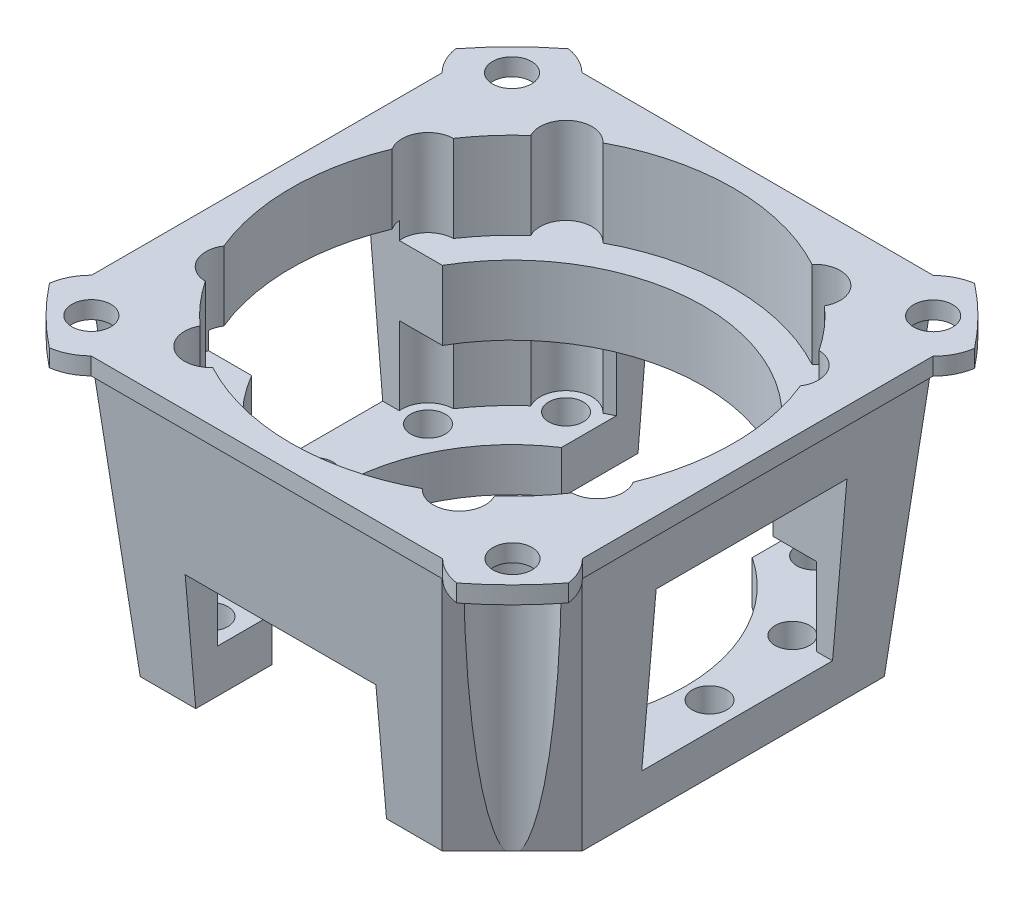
ISO-10303-21;
HEADER;
FILE_DESCRIPTION(('STEP AP214'),'2;1');
FILE_NAME('part.step','',(''),(''),'','','');
FILE_SCHEMA(('AUTOMOTIVE_DESIGN { 1 0 10303 214 1 1 1 1 }'));
ENDSEC;
DATA;
#1=APPLICATION_CONTEXT('core data for automotive mechanical design processes');
#2=APPLICATION_PROTOCOL_DEFINITION('international standard','automotive_design',2000,#1);
#3=PRODUCT_CONTEXT('',#1,'mechanical');
#4=PRODUCT('Part','Part','',(#3));
#5=PRODUCT_RELATED_PRODUCT_CATEGORY('part','',(#4));
#6=PRODUCT_DEFINITION_FORMATION('','',#4);
#7=PRODUCT_DEFINITION_CONTEXT('part definition',#1,'design');
#8=PRODUCT_DEFINITION('design','',#6,#7);
#9=PRODUCT_DEFINITION_SHAPE('','',#8);
#10=(LENGTH_UNIT() NAMED_UNIT(*) SI_UNIT(.MILLI.,.METRE.));
#11=(NAMED_UNIT(*) PLANE_ANGLE_UNIT() SI_UNIT($,.RADIAN.));
#12=(NAMED_UNIT(*) SI_UNIT($,.STERADIAN.) SOLID_ANGLE_UNIT());
#13=UNCERTAINTY_MEASURE_WITH_UNIT(LENGTH_MEASURE(1.E-05),#10,'distance_accuracy_value','');
#14=(GEOMETRIC_REPRESENTATION_CONTEXT(3) GLOBAL_UNCERTAINTY_ASSIGNED_CONTEXT((#13)) GLOBAL_UNIT_ASSIGNED_CONTEXT((#10,
#11,#12)) REPRESENTATION_CONTEXT('',''));
#15=CARTESIAN_POINT('',(0.,0.,0.));
#16=DIRECTION('',(0.,0.,1.));
#17=DIRECTION('',(1.,0.,0.));
#18=AXIS2_PLACEMENT_3D('',#15,#16,#17);
#19=CARTESIAN_POINT('',(14.75,2.5,-14.75));
#20=DIRECTION('',(0.,1.,0.));
#21=DIRECTION('',(0.,0.,1.));
#22=AXIS2_PLACEMENT_3D('',#19,#20,#21);
#23=CYLINDRICAL_SURFACE('',#22,12.75);
#24=CARTESIAN_POINT('',(14.75,7.,-14.75));
#25=DIRECTION('',(0.,1.,0.));
#26=DIRECTION('',(0.,0.,1.));
#27=AXIS2_PLACEMENT_3D('',#24,#25,#26);
#28=CIRCLE('',#27,12.75);
#29=CARTESIAN_POINT('',(25.3193930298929,7.,-7.6190511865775));
#30=VERTEX_POINT('',#29);
#31=CARTESIAN_POINT('',(23.2386216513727,7.,-5.23654623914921));
#32=VERTEX_POINT('',#31);
#33=EDGE_CURVE('E687',#30,#32,#28,.F.);
#34=ORIENTED_EDGE('',*,*,#33,.F.);
#35=DIRECTION('',(0.,-1.,0.));
#36=VECTOR('',#35,1.);
#37=CARTESIAN_POINT('',(25.3193930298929,9.25,-7.6190511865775));
#38=LINE('',#37,#36);
#39=CARTESIAN_POINT('',(25.3193930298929,2.5,-7.6190511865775));
#40=VERTEX_POINT('',#39);
#41=EDGE_CURVE('E1062',#40,#30,#38,.F.);
#42=ORIENTED_EDGE('',*,*,#41,.F.);
#43=CARTESIAN_POINT('',(14.75,2.5,-14.75));
#44=DIRECTION('',(0.,1.,0.));
#45=DIRECTION('',(0.,0.,1.));
#46=AXIS2_PLACEMENT_3D('',#43,#44,#45);
#47=CIRCLE('',#46,12.75);
#48=CARTESIAN_POINT('',(23.2386216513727,2.5,-5.23654623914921));
#49=VERTEX_POINT('',#48);
#50=EDGE_CURVE('E1301',#49,#40,#47,.T.);
#51=ORIENTED_EDGE('',*,*,#50,.F.);
#52=DIRECTION('',(0.,-1.,0.));
#53=VECTOR('',#52,1.);
#54=CARTESIAN_POINT('',(23.2386216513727,9.25,-5.23654623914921));
#55=LINE('',#54,#53);
#56=EDGE_CURVE('E1071',#32,#49,#55,.T.);
#57=ORIENTED_EDGE('',*,*,#56,.F.);
#58=EDGE_LOOP('',(#34,#42,#51,#57));
#59=FACE_BOUND('',#58,.T.);
#60=ADVANCED_FACE('F58',(#59),#23,.F.);
#61=CARTESIAN_POINT('',(14.75,7.,-14.75));
#62=DIRECTION('',(0.,1.,0.));
#63=DIRECTION('',(0.,0.,1.));
#64=AXIS2_PLACEMENT_3D('',#61,#62,#63);
#65=CIRCLE('',#64,12.75);
#66=CARTESIAN_POINT('',(9.25,7.,-3.24728292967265));
#67=VERTEX_POINT('',#66);
#68=CARTESIAN_POINT('',(8.7018451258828,7.,-3.52581528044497));
#69=VERTEX_POINT('',#68);
#70=EDGE_CURVE('E669',#67,#69,#65,.F.);
#71=ORIENTED_EDGE('',*,*,#70,.F.);
#72=DIRECTION('',(0.,1.,0.));
#73=VECTOR('',#72,1.);
#74=CARTESIAN_POINT('',(9.25,2.5,-3.24728292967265));
#75=LINE('',#74,#73);
#76=CARTESIAN_POINT('',(9.25,2.5,-3.24728292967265));
#77=VERTEX_POINT('',#76);
#78=EDGE_CURVE('E882',#67,#77,#75,.F.);
#79=ORIENTED_EDGE('',*,*,#78,.T.);
#80=CARTESIAN_POINT('',(8.7018451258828,2.5,-3.52581528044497));
#81=VERTEX_POINT('',#80);
#82=EDGE_CURVE('E1287',#81,#77,#47,.T.);
#83=ORIENTED_EDGE('',*,*,#82,.F.);
#84=DIRECTION('',(0.,-1.,0.));
#85=VECTOR('',#84,1.);
#86=CARTESIAN_POINT('',(8.7018451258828,9.25,-3.52581528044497));
#87=LINE('',#86,#85);
#88=EDGE_CURVE('E1080',#69,#81,#87,.T.);
#89=ORIENTED_EDGE('',*,*,#88,.F.);
#90=EDGE_LOOP('',(#71,#79,#83,#89));
#91=FACE_BOUND('',#90,.T.);
#92=ADVANCED_FACE('F1546',(#91),#23,.F.);
#93=CARTESIAN_POINT('',(20.7981548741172,7.,-3.52581528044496));
#94=VERTEX_POINT('',#93);
#95=CARTESIAN_POINT('',(20.25,7.,-3.24728292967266));
#96=VERTEX_POINT('',#95);
#97=EDGE_CURVE('E670',#94,#96,#65,.F.);
#98=ORIENTED_EDGE('',*,*,#97,.F.);
#99=DIRECTION('',(0.,-1.,0.));
#100=VECTOR('',#99,1.);
#101=CARTESIAN_POINT('',(20.7981548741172,9.25,-3.52581528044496));
#102=LINE('',#101,#100);
#103=CARTESIAN_POINT('',(20.7981548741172,2.5,-3.52581528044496));
#104=VERTEX_POINT('',#103);
#105=EDGE_CURVE('E1067',#104,#94,#102,.F.);
#106=ORIENTED_EDGE('',*,*,#105,.F.);
#107=CARTESIAN_POINT('',(20.25,2.5,-3.24728292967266));
#108=VERTEX_POINT('',#107);
#109=EDGE_CURVE('E1288',#108,#104,#47,.T.);
#110=ORIENTED_EDGE('',*,*,#109,.F.);
#111=DIRECTION('',(0.,1.,0.));
#112=VECTOR('',#111,1.);
#113=CARTESIAN_POINT('',(20.25,2.5,-3.24728292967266));
#114=LINE('',#113,#112);
#115=EDGE_CURVE('E868',#108,#96,#114,.T.);
#116=ORIENTED_EDGE('',*,*,#115,.T.);
#117=EDGE_LOOP('',(#98,#106,#110,#116));
#118=FACE_BOUND('',#117,.T.);
#119=ADVANCED_FACE('F1810',(#118),#23,.F.);
#120=CARTESIAN_POINT('',(14.75,7.,-14.75));
#121=DIRECTION('',(0.,1.,0.));
#122=DIRECTION('',(0.,0.,1.));
#123=AXIS2_PLACEMENT_3D('',#120,#121,#122);
#124=CIRCLE('',#123,12.75);
#125=CARTESIAN_POINT('',(6.26137834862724,7.,-5.23654623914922));
#126=VERTEX_POINT('',#125);
#127=CARTESIAN_POINT('',(4.18060697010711,7.,-7.6190511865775));
#128=VERTEX_POINT('',#127);
#129=EDGE_CURVE('E677',#126,#128,#124,.F.);
#130=ORIENTED_EDGE('',*,*,#129,.F.);
#131=DIRECTION('',(0.,-1.,0.));
#132=VECTOR('',#131,1.);
#133=CARTESIAN_POINT('',(6.26137834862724,9.25,-5.23654623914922));
#134=LINE('',#133,#132);
#135=CARTESIAN_POINT('',(6.26137834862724,2.5,-5.23654623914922));
#136=VERTEX_POINT('',#135);
#137=EDGE_CURVE('E1076',#136,#126,#134,.F.);
#138=ORIENTED_EDGE('',*,*,#137,.F.);
#139=CARTESIAN_POINT('',(4.18060697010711,2.5,-7.6190511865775));
#140=VERTEX_POINT('',#139);
#141=EDGE_CURVE('E1282',#140,#136,#47,.T.);
#142=ORIENTED_EDGE('',*,*,#141,.F.);
#143=DIRECTION('',(0.,-1.,0.));
#144=VECTOR('',#143,1.);
#145=CARTESIAN_POINT('',(4.18060697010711,9.25,-7.6190511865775));
#146=LINE('',#145,#144);
#147=EDGE_CURVE('E1085',#128,#140,#146,.T.);
#148=ORIENTED_EDGE('',*,*,#147,.F.);
#149=EDGE_LOOP('',(#130,#138,#142,#148));
#150=FACE_BOUND('',#149,.T.);
#151=ADVANCED_FACE('F1786',(#150),#23,.F.);
#152=CARTESIAN_POINT('',(21.920000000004,20.2426406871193,-4.5215378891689));
#153=DIRECTION('',(0.,-1.,0.));
#154=DIRECTION('',(0.,0.,-1.));
#155=AXIS2_PLACEMENT_3D('',#152,#153,#154);
#156=CYLINDRICAL_SURFACE('',#155,1.5);
#157=ORIENTED_EDGE('',*,*,#105,.T.);
#158=CARTESIAN_POINT('',(21.920000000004,7.,-4.5215378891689));
#159=DIRECTION('',(0.,1.,0.));
#160=DIRECTION('',(0.,0.,1.));
#161=AXIS2_PLACEMENT_3D('',#158,#159,#160);
#162=CIRCLE('',#161,1.5);
#163=EDGE_CURVE('E83',#94,#32,#162,.T.);
#164=ORIENTED_EDGE('',*,*,#163,.T.);
#165=ORIENTED_EDGE('',*,*,#56,.T.);
#166=CARTESIAN_POINT('',(21.920000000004,2.5,-4.5215378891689));
#167=DIRECTION('',(0.,1.,0.));
#168=DIRECTION('',(0.,0.,1.));
#169=AXIS2_PLACEMENT_3D('',#166,#167,#168);
#170=CIRCLE('',#169,1.5);
#171=EDGE_CURVE('E1012',#104,#49,#170,.T.);
#172=ORIENTED_EDGE('',*,*,#171,.F.);
#173=EDGE_LOOP('',(#157,#164,#165,#172));
#174=FACE_BOUND('',#173,.T.);
#175=ADVANCED_FACE('F2266',(#174),#156,.F.);
#176=CARTESIAN_POINT('',(4.21938896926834,20.2426406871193,-9.11854975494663));
#177=DIRECTION('',(0.,-1.,0.));
#178=DIRECTION('',(0.,0.,-1.));
#179=AXIS2_PLACEMENT_3D('',#176,#177,#178);
#180=CYLINDRICAL_SURFACE('',#179,1.5);
#181=DIRECTION('',(0.,-1.,0.));
#182=VECTOR('',#181,1.);
#183=CARTESIAN_POINT('',(2.72494865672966,20.2426406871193,-9.24757747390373));
#184=LINE('',#183,#182);
#185=CARTESIAN_POINT('',(2.72494865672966,7.,-9.24757747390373));
#186=VERTEX_POINT('',#185);
#187=CARTESIAN_POINT('',(2.72494865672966,2.5,-9.24757747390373));
#188=VERTEX_POINT('',#187);
#189=EDGE_CURVE('E794',#186,#188,#184,.T.);
#190=ORIENTED_EDGE('',*,*,#189,.F.);
#191=CARTESIAN_POINT('',(4.21938896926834,7.,-9.11854975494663));
#192=DIRECTION('',(0.,1.,0.));
#193=DIRECTION('',(0.,0.,1.));
#194=AXIS2_PLACEMENT_3D('',#191,#192,#193);
#195=CIRCLE('',#194,1.5);
#196=EDGE_CURVE('E681',#186,#128,#195,.T.);
#197=ORIENTED_EDGE('',*,*,#196,.T.);
#198=ORIENTED_EDGE('',*,*,#147,.T.);
#199=CARTESIAN_POINT('',(4.21938896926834,2.5,-9.11854975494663));
#200=DIRECTION('',(0.,1.,0.));
#201=DIRECTION('',(0.,0.,1.));
#202=AXIS2_PLACEMENT_3D('',#199,#200,#201);
#203=CIRCLE('',#202,1.5);
#204=EDGE_CURVE('E995',#188,#140,#203,.T.);
#205=ORIENTED_EDGE('',*,*,#204,.F.);
#206=EDGE_LOOP('',(#190,#197,#198,#205));
#207=FACE_BOUND('',#206,.T.);
#208=ADVANCED_FACE('F1783',(#207),#180,.F.);
#209=CARTESIAN_POINT('',(25.2806110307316,20.2426406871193,-9.11854975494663));
#210=DIRECTION('',(0.,-1.,0.));
#211=DIRECTION('',(0.,0.,-1.));
#212=AXIS2_PLACEMENT_3D('',#209,#210,#211);
#213=CYLINDRICAL_SURFACE('',#212,1.5);
#214=ORIENTED_EDGE('',*,*,#41,.T.);
#215=CARTESIAN_POINT('',(25.2806110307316,7.,-9.11854975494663));
#216=DIRECTION('',(0.,1.,0.));
#217=DIRECTION('',(0.,0.,1.));
#218=AXIS2_PLACEMENT_3D('',#215,#216,#217);
#219=CIRCLE('',#218,1.5);
#220=CARTESIAN_POINT('',(26.7750513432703,7.,-9.24757747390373));
#221=VERTEX_POINT('',#220);
#222=EDGE_CURVE('E684',#30,#221,#219,.T.);
#223=ORIENTED_EDGE('',*,*,#222,.T.);
#224=DIRECTION('',(0.,-1.,0.));
#225=VECTOR('',#224,1.);
#226=CARTESIAN_POINT('',(26.7750513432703,20.2426406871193,-9.24757747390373));
#227=LINE('',#226,#225);
#228=CARTESIAN_POINT('',(26.7750513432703,2.5,-9.24757747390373));
#229=VERTEX_POINT('',#228);
#230=EDGE_CURVE('E1482',#229,#221,#227,.F.);
#231=ORIENTED_EDGE('',*,*,#230,.F.);
#232=CARTESIAN_POINT('',(25.2806110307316,2.5,-9.11854975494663));
#233=DIRECTION('',(0.,1.,0.));
#234=DIRECTION('',(0.,0.,1.));
#235=AXIS2_PLACEMENT_3D('',#232,#233,#234);
#236=CIRCLE('',#235,1.5);
#237=EDGE_CURVE('E970',#40,#229,#236,.T.);
#238=ORIENTED_EDGE('',*,*,#237,.F.);
#239=EDGE_LOOP('',(#214,#223,#231,#238));
#240=FACE_BOUND('',#239,.T.);
#241=ADVANCED_FACE('F1772',(#240),#213,.F.);
#242=CARTESIAN_POINT('',(7.57999999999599,20.2426406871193,-4.5215378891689));
#243=DIRECTION('',(0.,-1.,0.));
#244=DIRECTION('',(0.,0.,-1.));
#245=AXIS2_PLACEMENT_3D('',#242,#243,#244);
#246=CYLINDRICAL_SURFACE('',#245,1.5);
#247=ORIENTED_EDGE('',*,*,#137,.T.);
#248=CARTESIAN_POINT('',(7.57999999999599,7.,-4.5215378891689));
#249=DIRECTION('',(0.,1.,0.));
#250=DIRECTION('',(0.,0.,1.));
#251=AXIS2_PLACEMENT_3D('',#248,#249,#250);
#252=CIRCLE('',#251,1.5);
#253=EDGE_CURVE('E674',#126,#69,#252,.T.);
#254=ORIENTED_EDGE('',*,*,#253,.T.);
#255=ORIENTED_EDGE('',*,*,#88,.T.);
#256=CARTESIAN_POINT('',(7.57999999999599,2.5,-4.5215378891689));
#257=DIRECTION('',(0.,1.,0.));
#258=DIRECTION('',(0.,0.,1.));
#259=AXIS2_PLACEMENT_3D('',#256,#257,#258);
#260=CIRCLE('',#259,1.5);
#261=EDGE_CURVE('E1004',#136,#81,#260,.T.);
#262=ORIENTED_EDGE('',*,*,#261,.F.);
#263=EDGE_LOOP('',(#247,#254,#255,#262));
#264=FACE_BOUND('',#263,.T.);
#265=ADVANCED_FACE('F1789',(#264),#246,.F.);
#266=CARTESIAN_POINT('',(14.75,7.,-14.75));
#267=DIRECTION('',(0.,1.,0.));
#268=DIRECTION('',(0.,0.,1.));
#269=AXIS2_PLACEMENT_3D('',#266,#267,#268);
#270=CIRCLE('',#269,12.75);
#271=CARTESIAN_POINT('',(4.19789240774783,7.,-21.9065023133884));
#272=VERTEX_POINT('',#271);
#273=CARTESIAN_POINT('',(6.28442255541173,7.,-24.2839655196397));
#274=VERTEX_POINT('',#273);
#275=EDGE_CURVE('E763',#272,#274,#270,.F.);
#276=ORIENTED_EDGE('',*,*,#275,.F.);
#277=DIRECTION('',(0.,-1.,0.));
#278=VECTOR('',#277,1.);
#279=CARTESIAN_POINT('',(4.19789240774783,9.25,-21.9065023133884));
#280=LINE('',#279,#278);
#281=CARTESIAN_POINT('',(4.19789240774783,2.5,-21.9065023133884));
#282=VERTEX_POINT('',#281);
#283=EDGE_CURVE('E1094',#282,#272,#280,.F.);
#284=ORIENTED_EDGE('',*,*,#283,.F.);
#285=CARTESIAN_POINT('',(6.28442255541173,2.5,-24.2839655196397));
#286=VERTEX_POINT('',#285);
#287=EDGE_CURVE('E1286',#286,#282,#47,.T.);
#288=ORIENTED_EDGE('',*,*,#287,.F.);
#289=DIRECTION('',(0.,-1.,0.));
#290=VECTOR('',#289,1.);
#291=CARTESIAN_POINT('',(6.28442255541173,9.25,-24.2839655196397));
#292=LINE('',#291,#290);
#293=EDGE_CURVE('E1034',#274,#286,#292,.T.);
#294=ORIENTED_EDGE('',*,*,#293,.F.);
#295=EDGE_LOOP('',(#276,#284,#288,#294));
#296=FACE_BOUND('',#295,.T.);
#297=ADVANCED_FACE('F1580',(#296),#23,.F.);
#298=CARTESIAN_POINT('',(14.75,7.,-14.75));
#299=DIRECTION('',(0.,1.,0.));
#300=DIRECTION('',(0.,0.,1.));
#301=AXIS2_PLACEMENT_3D('',#298,#299,#300);
#302=CIRCLE('',#301,12.75);
#303=CARTESIAN_POINT('',(23.2616161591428,7.,-24.2428863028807));
#304=VERTEX_POINT('',#303);
#305=CARTESIAN_POINT('',(25.33661658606,7.,-21.8553535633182));
#306=VERTEX_POINT('',#305);
#307=EDGE_CURVE('E753',#304,#306,#302,.F.);
#308=ORIENTED_EDGE('',*,*,#307,.F.);
#309=DIRECTION('',(0.,-1.,0.));
#310=VECTOR('',#309,1.);
#311=CARTESIAN_POINT('',(23.2616161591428,9.25,-24.2428863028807));
#312=LINE('',#311,#310);
#313=CARTESIAN_POINT('',(23.2616161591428,2.5,-24.2428863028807));
#314=VERTEX_POINT('',#313);
#315=EDGE_CURVE('E1045',#314,#304,#312,.F.);
#316=ORIENTED_EDGE('',*,*,#315,.F.);
#317=CARTESIAN_POINT('',(25.33661658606,2.5,-21.8553535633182));
#318=VERTEX_POINT('',#317);
#319=EDGE_CURVE('E1564',#318,#314,#47,.T.);
#320=ORIENTED_EDGE('',*,*,#319,.F.);
#321=DIRECTION('',(0.,-1.,0.));
#322=VECTOR('',#321,1.);
#323=CARTESIAN_POINT('',(25.33661658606,9.25,-21.8553535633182));
#324=LINE('',#323,#322);
#325=EDGE_CURVE('E1052',#306,#318,#324,.T.);
#326=ORIENTED_EDGE('',*,*,#325,.F.);
#327=EDGE_LOOP('',(#308,#316,#320,#326));
#328=FACE_BOUND('',#327,.T.);
#329=ADVANCED_FACE('F1797',(#328),#23,.F.);
#330=CARTESIAN_POINT('',(14.75,7.,-14.75));
#331=DIRECTION('',(0.,1.,0.));
#332=DIRECTION('',(0.,0.,1.));
#333=AXIS2_PLACEMENT_3D('',#330,#331,#332);
#334=CIRCLE('',#333,12.75);
#335=CARTESIAN_POINT('',(8.72902158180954,7.,-25.9887863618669));
#336=VERTEX_POINT('',#335);
#337=CARTESIAN_POINT('',(9.25000000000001,7.,-26.2527170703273));
#338=VERTEX_POINT('',#337);
#339=EDGE_CURVE('E750',#336,#338,#334,.F.);
#340=ORIENTED_EDGE('',*,*,#339,.F.);
#341=DIRECTION('',(0.,-1.,0.));
#342=VECTOR('',#341,1.);
#343=CARTESIAN_POINT('',(8.72902158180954,9.25,-25.9887863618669));
#344=LINE('',#343,#342);
#345=CARTESIAN_POINT('',(8.72902158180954,2.5,-25.9887863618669));
#346=VERTEX_POINT('',#345);
#347=EDGE_CURVE('E1030',#346,#336,#344,.F.);
#348=ORIENTED_EDGE('',*,*,#347,.F.);
#349=CARTESIAN_POINT('',(9.25000000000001,2.5,-26.2527170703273));
#350=VERTEX_POINT('',#349);
#351=EDGE_CURVE('E1561',#350,#346,#47,.T.);
#352=ORIENTED_EDGE('',*,*,#351,.F.);
#353=DIRECTION('',(0.,1.,0.));
#354=VECTOR('',#353,1.);
#355=CARTESIAN_POINT('',(9.25000000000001,2.5,-26.2527170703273));
#356=LINE('',#355,#354);
#357=EDGE_CURVE('E887',#350,#338,#356,.T.);
#358=ORIENTED_EDGE('',*,*,#357,.T.);
#359=EDGE_LOOP('',(#340,#348,#352,#358));
#360=FACE_BOUND('',#359,.T.);
#361=ADVANCED_FACE('F2553',(#360),#23,.F.);
#362=CARTESIAN_POINT('',(20.25,7.,-26.2527170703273));
#363=VERTEX_POINT('',#362);
#364=CARTESIAN_POINT('',(20.8252959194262,7.,-25.9595173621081));
#365=VERTEX_POINT('',#364);
#366=EDGE_CURVE('E745',#363,#365,#334,.F.);
#367=ORIENTED_EDGE('',*,*,#366,.F.);
#368=DIRECTION('',(0.,1.,0.));
#369=VECTOR('',#368,1.);
#370=CARTESIAN_POINT('',(20.25,2.5,-26.2527170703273));
#371=LINE('',#370,#369);
#372=CARTESIAN_POINT('',(20.25,2.5,-26.2527170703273));
#373=VERTEX_POINT('',#372);
#374=EDGE_CURVE('E863',#363,#373,#371,.F.);
#375=ORIENTED_EDGE('',*,*,#374,.T.);
#376=CARTESIAN_POINT('',(20.8252959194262,2.5,-25.9595173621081));
#377=VERTEX_POINT('',#376);
#378=EDGE_CURVE('E1567',#377,#373,#47,.T.);
#379=ORIENTED_EDGE('',*,*,#378,.F.);
#380=DIRECTION('',(0.,-1.,0.));
#381=VECTOR('',#380,1.);
#382=CARTESIAN_POINT('',(20.8252959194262,9.25,-25.9595173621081));
#383=LINE('',#382,#381);
#384=EDGE_CURVE('E1039',#365,#377,#383,.T.);
#385=ORIENTED_EDGE('',*,*,#384,.F.);
#386=EDGE_LOOP('',(#367,#375,#379,#385));
#387=FACE_BOUND('',#386,.T.);
#388=ADVANCED_FACE('F1819',(#387),#23,.F.);
#389=CARTESIAN_POINT('',(4.2330460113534,20.2426406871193,-20.4069142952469));
#390=DIRECTION('',(0.,-1.,0.));
#391=DIRECTION('',(0.,0.,-1.));
#392=AXIS2_PLACEMENT_3D('',#389,#390,#391);
#393=CYLINDRICAL_SURFACE('',#392,1.5);
#394=ORIENTED_EDGE('',*,*,#283,.T.);
#395=CARTESIAN_POINT('',(4.2330460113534,7.,-20.4069142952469));
#396=DIRECTION('',(0.,1.,0.));
#397=DIRECTION('',(0.,0.,1.));
#398=AXIS2_PLACEMENT_3D('',#395,#396,#397);
#399=CIRCLE('',#398,1.5);
#400=CARTESIAN_POINT('',(2.74153276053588,7.,-20.2475774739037));
#401=VERTEX_POINT('',#400);
#402=EDGE_CURVE('E767',#272,#401,#399,.T.);
#403=ORIENTED_EDGE('',*,*,#402,.T.);
#404=DIRECTION('',(0.,-1.,0.));
#405=VECTOR('',#404,1.);
#406=CARTESIAN_POINT('',(2.74153276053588,20.2426406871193,-20.2475774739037));
#407=LINE('',#406,#405);
#408=CARTESIAN_POINT('',(2.74153276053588,2.5,-20.2475774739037));
#409=VERTEX_POINT('',#408);
#410=EDGE_CURVE('E833',#409,#401,#407,.F.);
#411=ORIENTED_EDGE('',*,*,#410,.F.);
#412=CARTESIAN_POINT('',(4.2330460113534,2.5,-20.4069142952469));
#413=DIRECTION('',(0.,1.,0.));
#414=DIRECTION('',(0.,0.,1.));
#415=AXIS2_PLACEMENT_3D('',#412,#413,#414);
#416=CIRCLE('',#415,1.5);
#417=EDGE_CURVE('E994',#282,#409,#416,.T.);
#418=ORIENTED_EDGE('',*,*,#417,.F.);
#419=EDGE_LOOP('',(#394,#403,#411,#418));
#420=FACE_BOUND('',#419,.T.);
#421=ADVANCED_FACE('F1583',(#420),#393,.F.);
#422=CARTESIAN_POINT('',(25.2942064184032,20.2426406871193,-20.3559532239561));
#423=DIRECTION('',(0.,-1.,0.));
#424=DIRECTION('',(0.,0.,-1.));
#425=AXIS2_PLACEMENT_3D('',#422,#423,#424);
#426=CYLINDRICAL_SURFACE('',#425,1.5);
#427=DIRECTION('',(0.,-1.,0.));
#428=VECTOR('',#427,1.);
#429=CARTESIAN_POINT('',(26.7902861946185,20.2426406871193,-20.2475774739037));
#430=LINE('',#429,#428);
#431=CARTESIAN_POINT('',(26.7902861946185,7.,-20.2475774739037));
#432=VERTEX_POINT('',#431);
#433=CARTESIAN_POINT('',(26.7902861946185,2.5,-20.2475774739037));
#434=VERTEX_POINT('',#433);
#435=EDGE_CURVE('E68',#432,#434,#430,.T.);
#436=ORIENTED_EDGE('',*,*,#435,.F.);
#437=CARTESIAN_POINT('',(25.2942064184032,7.,-20.3559532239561));
#438=DIRECTION('',(0.,1.,0.));
#439=DIRECTION('',(0.,0.,1.));
#440=AXIS2_PLACEMENT_3D('',#437,#438,#439);
#441=CIRCLE('',#440,1.5);
#442=EDGE_CURVE('E757',#432,#306,#441,.T.);
#443=ORIENTED_EDGE('',*,*,#442,.T.);
#444=ORIENTED_EDGE('',*,*,#325,.T.);
#445=CARTESIAN_POINT('',(25.2942064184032,2.5,-20.3559532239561));
#446=DIRECTION('',(0.,1.,0.));
#447=DIRECTION('',(0.,0.,1.));
#448=AXIS2_PLACEMENT_3D('',#445,#446,#447);
#449=CIRCLE('',#448,1.5);
#450=EDGE_CURVE('E971',#434,#318,#449,.T.);
#451=ORIENTED_EDGE('',*,*,#450,.F.);
#452=EDGE_LOOP('',(#436,#443,#444,#451));
#453=FACE_BOUND('',#452,.T.);
#454=ADVANCED_FACE('F1505',(#453),#426,.F.);
#455=CARTESIAN_POINT('',(21.9447284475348,20.2426406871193,-24.9610831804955));
#456=DIRECTION('',(0.,-1.,0.));
#457=DIRECTION('',(0.,0.,-1.));
#458=AXIS2_PLACEMENT_3D('',#455,#456,#457);
#459=CYLINDRICAL_SURFACE('',#458,1.5);
#460=CARTESIAN_POINT('',(21.9447284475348,7.,-24.9610831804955));
#461=DIRECTION('',(0.,1.,0.));
#462=DIRECTION('',(0.,0.,1.));
#463=AXIS2_PLACEMENT_3D('',#460,#461,#462);
#464=CIRCLE('',#463,1.5);
#465=EDGE_CURVE('E749',#304,#365,#464,.T.);
#466=ORIENTED_EDGE('',*,*,#465,.T.);
#467=ORIENTED_EDGE('',*,*,#384,.T.);
#468=CARTESIAN_POINT('',(21.9447284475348,2.5,-24.9610831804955));
#469=DIRECTION('',(0.,1.,0.));
#470=DIRECTION('',(0.,0.,1.));
#471=AXIS2_PLACEMENT_3D('',#468,#469,#470);
#472=CIRCLE('',#471,1.5);
#473=EDGE_CURVE('E980',#314,#377,#472,.T.);
#474=ORIENTED_EDGE('',*,*,#473,.F.);
#475=ORIENTED_EDGE('',*,*,#315,.T.);
#476=EDGE_LOOP('',(#466,#467,#474,#475));
#477=FACE_BOUND('',#476,.T.);
#478=ADVANCED_FACE('F2293',(#477),#459,.F.);
#479=CARTESIAN_POINT('',(7.60477042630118,20.2426406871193,-24.9957811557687));
#480=DIRECTION('',(0.,-1.,0.));
#481=DIRECTION('',(0.,0.,-1.));
#482=AXIS2_PLACEMENT_3D('',#479,#480,#481);
#483=CYLINDRICAL_SURFACE('',#482,1.5);
#484=ORIENTED_EDGE('',*,*,#347,.T.);
#485=CARTESIAN_POINT('',(7.60477042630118,7.,-24.9957811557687));
#486=DIRECTION('',(0.,1.,0.));
#487=DIRECTION('',(0.,0.,1.));
#488=AXIS2_PLACEMENT_3D('',#485,#486,#487);
#489=CIRCLE('',#488,1.5);
#490=EDGE_CURVE('E760',#336,#274,#489,.T.);
#491=ORIENTED_EDGE('',*,*,#490,.T.);
#492=ORIENTED_EDGE('',*,*,#293,.T.);
#493=CARTESIAN_POINT('',(7.60477042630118,2.5,-24.9957811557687));
#494=DIRECTION('',(0.,1.,0.));
#495=DIRECTION('',(0.,0.,1.));
#496=AXIS2_PLACEMENT_3D('',#493,#494,#495);
#497=CIRCLE('',#496,1.5);
#498=EDGE_CURVE('E999',#346,#286,#497,.T.);
#499=ORIENTED_EDGE('',*,*,#498,.F.);
#500=EDGE_LOOP('',(#484,#491,#492,#499));
#501=FACE_BOUND('',#500,.T.);
#502=ADVANCED_FACE('F1884',(#501),#483,.F.);
#503=CARTESIAN_POINT('',(0.,0.,0.));
#504=DIRECTION('',(0.,-1.,0.));
#505=DIRECTION('',(0.,0.,-1.));
#506=AXIS2_PLACEMENT_3D('',#503,#504,#505);
#507=PLANE('',#506);
#508=DIRECTION('',(0.,0.,-1.));
#509=VECTOR('',#508,1.);
#510=CARTESIAN_POINT('',(9.25,0.,0.));
#511=LINE('',#510,#509);
#512=CARTESIAN_POINT('',(9.25,0.,-2.00000000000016));
#513=VERTEX_POINT('',#512);
#514=CARTESIAN_POINT('',(9.25,0.,-6.38292807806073));
#515=VERTEX_POINT('',#514);
#516=EDGE_CURVE('E856',#513,#515,#511,.T.);
#517=ORIENTED_EDGE('',*,*,#516,.F.);
#518=DIRECTION('',(-1.,0.,0.));
#519=VECTOR('',#518,1.);
#520=CARTESIAN_POINT('',(0.,0.,-2.00000000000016));
#521=LINE('',#520,#519);
#522=CARTESIAN_POINT('',(6.04601426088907,0.,-2.00000000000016));
#523=VERTEX_POINT('',#522);
#524=EDGE_CURVE('E1325',#513,#523,#521,.T.);
#525=ORIENTED_EDGE('',*,*,#524,.T.);
#526=DIRECTION('',(0.709807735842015,0.,0.704395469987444));
#527=VECTOR('',#526,1.);
#528=CARTESIAN_POINT('',(3.99983960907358,0.,-4.03057262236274));
#529=LINE('',#528,#527);
#530=CARTESIAN_POINT('',(4.20466281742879,0.,-3.82731118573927));
#531=VERTEX_POINT('',#530);
#532=EDGE_CURVE('E1346',#523,#531,#529,.F.);
#533=ORIENTED_EDGE('',*,*,#532,.T.);
#534=CARTESIAN_POINT('',(2.60776313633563,0.,-2.62318851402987));
#535=DIRECTION('',(0.,-1.,0.));
#536=DIRECTION('',(0.,0.,-1.));
#537=AXIS2_PLACEMENT_3D('',#534,#535,#536);
#538=CIRCLE('',#537,2.);
#539=CARTESIAN_POINT('',(3.79962779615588,0.,-4.22925782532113));
#540=VERTEX_POINT('',#539);
#541=EDGE_CURVE('E911',#540,#531,#538,.T.);
#542=ORIENTED_EDGE('',*,*,#541,.F.);
#543=CARTESIAN_POINT('',(2.00000000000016,0.,-6.01516350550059));
#544=VERTEX_POINT('',#543);
#545=EDGE_CURVE('E1345',#540,#544,#529,.F.);
#546=ORIENTED_EDGE('',*,*,#545,.T.);
#547=DIRECTION('',(0.,0.,-1.));
#548=VECTOR('',#547,1.);
#549=CARTESIAN_POINT('',(2.00000000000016,0.,-29.5));
#550=LINE('',#549,#548);
#551=CARTESIAN_POINT('',(2.00000000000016,0.,-23.4539857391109));
#552=VERTEX_POINT('',#551);
#553=EDGE_CURVE('E1312',#544,#552,#550,.T.);
#554=ORIENTED_EDGE('',*,*,#553,.T.);
#555=DIRECTION('',(-0.704395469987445,0.,0.709807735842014));
#556=VECTOR('',#555,1.);
#557=CARTESIAN_POINT('',(-10.7189953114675,0.,-10.637263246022));
#558=LINE('',#557,#556);
#559=CARTESIAN_POINT('',(3.81235350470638,0.,-25.2802645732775));
#560=VERTEX_POINT('',#559);
#561=EDGE_CURVE('E1351',#552,#560,#558,.F.);
#562=ORIENTED_EDGE('',*,*,#561,.T.);
#563=CARTESIAN_POINT('',(2.60776313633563,0.,-26.8768114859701));
#564=DIRECTION('',(0.,-1.,0.));
#565=DIRECTION('',(0.,0.,1.));
#566=AXIS2_PLACEMENT_3D('',#563,#564,#565);
#567=CIRCLE('',#566,2.);
#568=CARTESIAN_POINT('',(4.21348326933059,0.,-25.6844764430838));
#569=VERTEX_POINT('',#568);
#570=EDGE_CURVE('E916',#569,#560,#567,.T.);
#571=ORIENTED_EDGE('',*,*,#570,.F.);
#572=CARTESIAN_POINT('',(6.01516350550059,0.,-27.4999999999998));
#573=VERTEX_POINT('',#572);
#574=EDGE_CURVE('E1350',#569,#573,#558,.F.);
#575=ORIENTED_EDGE('',*,*,#574,.T.);
#576=DIRECTION('',(1.,0.,0.));
#577=VECTOR('',#576,1.);
#578=CARTESIAN_POINT('',(29.5,0.,-27.4999999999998));
#579=LINE('',#578,#577);
#580=CARTESIAN_POINT('',(9.25000000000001,0.,-27.4999999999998));
#581=VERTEX_POINT('',#580);
#582=EDGE_CURVE('E1317',#573,#581,#579,.T.);
#583=ORIENTED_EDGE('',*,*,#582,.T.);
#584=CARTESIAN_POINT('',(9.25000000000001,0.,-23.0862211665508));
#585=VERTEX_POINT('',#584);
#586=EDGE_CURVE('E843',#585,#581,#511,.T.);
#587=ORIENTED_EDGE('',*,*,#586,.F.);
#588=CARTESIAN_POINT('',(14.75,0.,-14.7345746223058));
#589=DIRECTION('',(0.,-1.,0.));
#590=DIRECTION('',(0.,0.,-1.));
#591=AXIS2_PLACEMENT_3D('',#588,#589,#590);
#592=CIRCLE('',#591,9.99999999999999);
#593=EDGE_CURVE('E1276',#515,#585,#592,.T.);
#594=ORIENTED_EDGE('',*,*,#593,.F.);
#595=EDGE_LOOP('',(#517,#525,#533,#542,#546,#554,#562,#571,#575,#583,#587,#594));
#596=FACE_BOUND('',#595,.T.);
#597=CARTESIAN_POINT('',(4.2330460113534,0.,-20.4069142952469));
#598=DIRECTION('',(0.,1.,0.));
#599=DIRECTION('',(0.,0.,1.));
#600=AXIS2_PLACEMENT_3D('',#597,#598,#599);
#601=CIRCLE('',#600,1.);
#602=CARTESIAN_POINT('',(4.2330460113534,0.,-19.4069142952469));
#603=VERTEX_POINT('',#602);
#604=EDGE_CURVE('E1107',#603,#603,#601,.T.);
#605=ORIENTED_EDGE('',*,*,#604,.T.);
#606=EDGE_LOOP('',(#605));
#607=FACE_BOUND('',#606,.T.);
#608=CARTESIAN_POINT('',(7.60477042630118,0.,-24.9957811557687));
#609=DIRECTION('',(0.,-1.,0.));
#610=DIRECTION('',(0.,0.,-1.));
#611=AXIS2_PLACEMENT_3D('',#608,#609,#610);
#612=CIRCLE('',#611,1.);
#613=CARTESIAN_POINT('',(7.60477042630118,0.,-25.9957811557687));
#614=VERTEX_POINT('',#613);
#615=EDGE_CURVE('E1128',#614,#614,#612,.F.);
#616=ORIENTED_EDGE('',*,*,#615,.T.);
#617=EDGE_LOOP('',(#616));
#618=FACE_BOUND('',#617,.T.);
#619=CARTESIAN_POINT('',(4.21938896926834,0.,-9.11854975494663));
#620=DIRECTION('',(0.,-1.,0.));
#621=DIRECTION('',(0.,0.,-1.));
#622=AXIS2_PLACEMENT_3D('',#619,#620,#621);
#623=CIRCLE('',#622,1.);
#624=CARTESIAN_POINT('',(4.21938896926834,0.,-10.1185497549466));
#625=VERTEX_POINT('',#624);
#626=EDGE_CURVE('E1123',#625,#625,#623,.T.);
#627=ORIENTED_EDGE('',*,*,#626,.F.);
#628=EDGE_LOOP('',(#627));
#629=FACE_BOUND('',#628,.T.);
#630=CARTESIAN_POINT('',(7.57999999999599,0.,-4.5215378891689));
#631=DIRECTION('',(0.,-1.,0.));
#632=DIRECTION('',(0.,0.,-1.));
#633=AXIS2_PLACEMENT_3D('',#630,#631,#632);
#634=CIRCLE('',#633,1.);
#635=CARTESIAN_POINT('',(7.57999999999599,0.,-5.52153788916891));
#636=VERTEX_POINT('',#635);
#637=EDGE_CURVE('E1127',#636,#636,#634,.T.);
#638=ORIENTED_EDGE('',*,*,#637,.F.);
#639=EDGE_LOOP('',(#638));
#640=FACE_BOUND('',#639,.T.);
#641=CARTESIAN_POINT('',(3.37503329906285,0.,-14.7775236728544));
#642=DIRECTION('',(0.,1.,0.));
#643=DIRECTION('',(0.,0.,1.));
#644=AXIS2_PLACEMENT_3D('',#641,#642,#643);
#645=CIRCLE('',#644,1.);
#646=CARTESIAN_POINT('',(3.37503329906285,0.,-13.7775236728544));
#647=VERTEX_POINT('',#646);
#648=EDGE_CURVE('E1111',#647,#647,#645,.T.);
#649=ORIENTED_EDGE('',*,*,#648,.T.);
#650=EDGE_LOOP('',(#649));
#651=FACE_BOUND('',#650,.T.);
#652=ADVANCED_FACE('F1678',(#596,#607,#618,#629,#640,#651),#507,.T.);
#653=CARTESIAN_POINT('',(14.75,2.5,-14.75));
#654=DIRECTION('',(0.,1.,0.));
#655=DIRECTION('',(0.,0.,1.));
#656=AXIS2_PLACEMENT_3D('',#653,#654,#655);
#657=PLANE('',#656);
#658=CARTESIAN_POINT('',(4.2330460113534,2.5,-20.4069142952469));
#659=DIRECTION('',(0.,1.,0.));
#660=DIRECTION('',(0.,0.,1.));
#661=AXIS2_PLACEMENT_3D('',#658,#659,#660);
#662=CIRCLE('',#661,1.);
#663=CARTESIAN_POINT('',(4.2330460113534,2.5,-19.4069142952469));
#664=VERTEX_POINT('',#663);
#665=EDGE_CURVE('E1428',#664,#664,#662,.F.);
#666=ORIENTED_EDGE('',*,*,#665,.T.);
#667=EDGE_LOOP('',(#666));
#668=FACE_BOUND('',#667,.T.);
#669=CARTESIAN_POINT('',(4.21938896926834,2.5,-9.11854975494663));
#670=DIRECTION('',(0.,1.,0.));
#671=DIRECTION('',(0.,0.,1.));
#672=AXIS2_PLACEMENT_3D('',#669,#670,#671);
#673=CIRCLE('',#672,1.);
#674=CARTESIAN_POINT('',(4.21938896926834,2.5,-8.11854975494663));
#675=VERTEX_POINT('',#674);
#676=EDGE_CURVE('E1412',#675,#675,#673,.T.);
#677=ORIENTED_EDGE('',*,*,#676,.F.);
#678=EDGE_LOOP('',(#677));
#679=FACE_BOUND('',#678,.T.);
#680=DIRECTION('',(1.,0.,0.));
#681=VECTOR('',#680,1.);
#682=CARTESIAN_POINT('',(-0.213688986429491,2.5,-9.24757747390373));
#683=LINE('',#682,#681);
#684=CARTESIAN_POINT('',(1.78127834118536,2.5,-9.24757747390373));
#685=VERTEX_POINT('',#684);
#686=EDGE_CURVE('E781',#685,#188,#683,.T.);
#687=ORIENTED_EDGE('',*,*,#686,.T.);
#688=ORIENTED_EDGE('',*,*,#204,.T.);
#689=ORIENTED_EDGE('',*,*,#141,.T.);
#690=ORIENTED_EDGE('',*,*,#261,.T.);
#691=ORIENTED_EDGE('',*,*,#82,.T.);
#692=DIRECTION('',(0.,0.,1.));
#693=VECTOR('',#692,1.);
#694=CARTESIAN_POINT('',(9.25,2.5,-14.75));
#695=LINE('',#694,#693);
#696=CARTESIAN_POINT('',(9.25,2.5,-6.38292807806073));
#697=VERTEX_POINT('',#696);
#698=EDGE_CURVE('E879',#697,#77,#695,.T.);
#699=ORIENTED_EDGE('',*,*,#698,.F.);
#700=CARTESIAN_POINT('',(14.75,2.5,-14.7345746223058));
#701=DIRECTION('',(0.,1.,0.));
#702=DIRECTION('',(0.,0.,1.));
#703=AXIS2_PLACEMENT_3D('',#700,#701,#702);
#704=CIRCLE('',#703,9.99999999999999);
#705=CARTESIAN_POINT('',(9.25000000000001,2.5,-23.0862211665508));
#706=VERTEX_POINT('',#705);
#707=EDGE_CURVE('E1281',#706,#697,#704,.T.);
#708=ORIENTED_EDGE('',*,*,#707,.F.);
#709=EDGE_CURVE('E883',#350,#706,#695,.T.);
#710=ORIENTED_EDGE('',*,*,#709,.F.);
#711=ORIENTED_EDGE('',*,*,#351,.T.);
#712=ORIENTED_EDGE('',*,*,#498,.T.);
#713=ORIENTED_EDGE('',*,*,#287,.T.);
#714=ORIENTED_EDGE('',*,*,#417,.T.);
#715=DIRECTION('',(1.,0.,0.));
#716=VECTOR('',#715,1.);
#717=CARTESIAN_POINT('',(-0.213688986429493,2.5,-20.2475774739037));
#718=LINE('',#717,#716);
#719=CARTESIAN_POINT('',(1.78127834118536,2.5,-20.2475774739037));
#720=VERTEX_POINT('',#719);
#721=EDGE_CURVE('E776',#720,#409,#718,.T.);
#722=ORIENTED_EDGE('',*,*,#721,.F.);
#723=DIRECTION('',(0.,0.,1.));
#724=VECTOR('',#723,1.);
#725=CARTESIAN_POINT('',(1.78127834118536,2.5,0.));
#726=LINE('',#725,#724);
#727=EDGE_CURVE('E803',#720,#685,#726,.T.);
#728=ORIENTED_EDGE('',*,*,#727,.T.);
#729=EDGE_LOOP('',(#687,#688,#689,#690,#691,#699,#708,#710,#711,#712,#713,#714,#722,#728));
#730=FACE_BOUND('',#729,.T.);
#731=CARTESIAN_POINT('',(7.57999999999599,2.5,-4.5215378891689));
#732=DIRECTION('',(0.,1.,0.));
#733=DIRECTION('',(0.,0.,1.));
#734=AXIS2_PLACEMENT_3D('',#731,#732,#733);
#735=CIRCLE('',#734,1.);
#736=CARTESIAN_POINT('',(7.57999999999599,2.5,-3.5215378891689));
#737=VERTEX_POINT('',#736);
#738=EDGE_CURVE('E1404',#737,#737,#735,.T.);
#739=ORIENTED_EDGE('',*,*,#738,.F.);
#740=EDGE_LOOP('',(#739));
#741=FACE_BOUND('',#740,.T.);
#742=CARTESIAN_POINT('',(3.37503329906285,2.5,-14.7775236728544));
#743=DIRECTION('',(0.,1.,0.));
#744=DIRECTION('',(0.,0.,1.));
#745=AXIS2_PLACEMENT_3D('',#742,#743,#744);
#746=CIRCLE('',#745,1.);
#747=CARTESIAN_POINT('',(3.37503329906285,2.5,-13.7775236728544));
#748=VERTEX_POINT('',#747);
#749=EDGE_CURVE('E1156',#748,#748,#746,.F.);
#750=ORIENTED_EDGE('',*,*,#749,.T.);
#751=EDGE_LOOP('',(#750));
#752=FACE_BOUND('',#751,.T.);
#753=CARTESIAN_POINT('',(7.60477042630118,2.5,-24.9957811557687));
#754=DIRECTION('',(0.,1.,0.));
#755=DIRECTION('',(0.,0.,1.));
#756=AXIS2_PLACEMENT_3D('',#753,#754,#755);
#757=CIRCLE('',#756,1.);
#758=CARTESIAN_POINT('',(7.60477042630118,2.5,-23.9957811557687));
#759=VERTEX_POINT('',#758);
#760=EDGE_CURVE('E1416',#759,#759,#757,.F.);
#761=ORIENTED_EDGE('',*,*,#760,.T.);
#762=EDGE_LOOP('',(#761));
#763=FACE_BOUND('',#762,.T.);
#764=ADVANCED_FACE('F1556',(#668,#679,#730,#741,#752,#763),#657,.T.);
#765=CARTESIAN_POINT('',(14.75,10.,-14.7345746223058));
#766=DIRECTION('',(0.,-1.,0.));
#767=DIRECTION('',(0.,0.,-1.));
#768=AXIS2_PLACEMENT_3D('',#765,#766,#767);
#769=CYLINDRICAL_SURFACE('',#768,9.99999999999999);
#770=ORIENTED_EDGE('',*,*,#593,.T.);
#771=DIRECTION('',(0.,-1.,0.));
#772=VECTOR('',#771,1.);
#773=CARTESIAN_POINT('',(9.25000000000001,10.,-23.0862211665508));
#774=LINE('',#773,#772);
#775=EDGE_CURVE('E1474',#585,#706,#774,.F.);
#776=ORIENTED_EDGE('',*,*,#775,.T.);
#777=ORIENTED_EDGE('',*,*,#707,.T.);
#778=DIRECTION('',(0.,-1.,0.));
#779=VECTOR('',#778,1.);
#780=CARTESIAN_POINT('',(9.25,10.,-6.38292807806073));
#781=LINE('',#780,#779);
#782=EDGE_CURVE('E1470',#697,#515,#781,.T.);
#783=ORIENTED_EDGE('',*,*,#782,.T.);
#784=EDGE_LOOP('',(#770,#776,#777,#783));
#785=FACE_BOUND('',#784,.T.);
#786=ADVANCED_FACE('F1670',(#785),#769,.F.);
#787=CARTESIAN_POINT('',(25.2620917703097,20.6667465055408,-0.191893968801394));
#788=DIRECTION('',(-0.699065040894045,0.122790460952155,-0.704436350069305));
#789=DIRECTION('',(0.0868265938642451,0.992432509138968,0.0868265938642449));
#790=AXIS2_PLACEMENT_3D('',#787,#788,#789);
#791=PLANE('',#790);
#792=CARTESIAN_POINT('',(26.8922368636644,15.9993252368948,-2.62318851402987));
#793=DIRECTION('',(-0.699065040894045,0.122790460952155,-0.704436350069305));
#794=DIRECTION('',(-0.0864930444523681,-0.992432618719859,-0.0871576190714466));
#795=AXIS2_PLACEMENT_3D('',#792,#793,#794);
#796=ELLIPSE('',#795,16.2879101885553,2.);
#797=CARTESIAN_POINT('',(25.700372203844,0.,-4.22925782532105));
#798=VERTEX_POINT('',#797);
#799=CARTESIAN_POINT('',(28.2220431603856,15.,-4.11704768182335));
#800=VERTEX_POINT('',#799);
#801=EDGE_CURVE('E1461',#798,#800,#796,.F.);
#802=ORIENTED_EDGE('',*,*,#801,.F.);
#803=DIRECTION('',(0.709807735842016,0.,-0.704395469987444));
#804=VECTOR('',#803,1.);
#805=CARTESIAN_POINT('',(10.6372632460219,0.,10.7189953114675));
#806=LINE('',#805,#804);
#807=CARTESIAN_POINT('',(27.4999999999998,0.,-6.01516350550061));
#808=VERTEX_POINT('',#807);
#809=EDGE_CURVE('E1361',#808,#798,#806,.F.);
#810=ORIENTED_EDGE('',*,*,#809,.F.);
#811=DIRECTION('',(-0.0868265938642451,-0.992432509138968,-0.0868265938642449));
#812=VECTOR('',#811,1.);
#813=CARTESIAN_POINT('',(29.5302697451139,23.206089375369,-3.98489376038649));
#814=LINE('',#813,#812);
#815=CARTESIAN_POINT('',(28.8123299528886,15.,-4.70283355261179));
#816=VERTEX_POINT('',#815);
#817=EDGE_CURVE('E1342',#816,#808,#814,.T.);
#818=ORIENTED_EDGE('',*,*,#817,.F.);
#819=DIRECTION('',(0.709807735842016,0.,-0.704395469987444));
#820=VECTOR('',#819,1.);
#821=CARTESIAN_POINT('',(24.7682202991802,15.,-0.689560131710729));
#822=LINE('',#821,#820);
#823=EDGE_CURVE('E1259',#816,#800,#822,.F.);
#824=ORIENTED_EDGE('',*,*,#823,.T.);
#825=EDGE_LOOP('',(#802,#810,#818,#824));
#826=FACE_BOUND('',#825,.T.);
#827=ADVANCED_FACE('F1856',(#826),#791,.F.);
#828=CARTESIAN_POINT('',(29.3081060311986,20.6667465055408,-25.2620917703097));
#829=DIRECTION('',(-0.704436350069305,0.122790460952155,0.699065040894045));
#830=DIRECTION('',(0.086826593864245,0.992432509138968,-0.0868265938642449));
#831=AXIS2_PLACEMENT_3D('',#828,#829,#830);
#832=PLANE('',#831);
#833=CARTESIAN_POINT('',(26.8922368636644,16.0000000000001,-26.8768114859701));
#834=DIRECTION('',(-0.704436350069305,0.122790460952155,0.699065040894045));
#835=DIRECTION('',(-0.0871576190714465,-0.992432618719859,0.0864930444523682));
#836=AXIS2_PLACEMENT_3D('',#833,#834,#835);
#837=ELLIPSE('',#836,16.2879101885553,2.00000000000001);
#838=CARTESIAN_POINT('',(25.2865167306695,0.,-25.6844764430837));
#839=VERTEX_POINT('',#838);
#840=CARTESIAN_POINT('',(25.3983220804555,15.,-28.2065553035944));
#841=VERTEX_POINT('',#840);
#842=EDGE_CURVE('E1457',#839,#841,#837,.F.);
#843=ORIENTED_EDGE('',*,*,#842,.F.);
#844=DIRECTION('',(-0.704395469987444,0.,-0.709807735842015));
#845=VECTOR('',#844,1.);
#846=CARTESIAN_POINT('',(25.5818924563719,0.,-25.3868311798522));
#847=LINE('',#846,#845);
#848=CARTESIAN_POINT('',(23.4848364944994,0.,-27.4999999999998));
#849=VERTEX_POINT('',#848);
#850=EDGE_CURVE('E1356',#849,#839,#847,.F.);
#851=ORIENTED_EDGE('',*,*,#850,.F.);
#852=DIRECTION('',(-0.086826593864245,-0.992432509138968,0.0868265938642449));
#853=VECTOR('',#852,1.);
#854=CARTESIAN_POINT('',(25.2927099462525,20.6640881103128,-29.307873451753));
#855=LINE('',#854,#853);
#856=CARTESIAN_POINT('',(24.7971664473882,15.,-28.8123299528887));
#857=VERTEX_POINT('',#856);
#858=EDGE_CURVE('E1369',#857,#849,#855,.T.);
#859=ORIENTED_EDGE('',*,*,#858,.F.);
#860=DIRECTION('',(-0.704395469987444,0.,-0.709807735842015));
#861=VECTOR('',#860,1.);
#862=CARTESIAN_POINT('',(28.8104398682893,15.,-24.7682202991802));
#863=LINE('',#862,#861);
#864=EDGE_CURVE('E1272',#857,#841,#863,.F.);
#865=ORIENTED_EDGE('',*,*,#864,.T.);
#866=EDGE_LOOP('',(#843,#851,#859,#865));
#867=FACE_BOUND('',#866,.T.);
#868=ADVANCED_FACE('F1700',(#867),#832,.F.);
#869=CARTESIAN_POINT('',(0.191893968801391,20.6667465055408,-25.2620917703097));
#870=DIRECTION('',(0.704436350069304,0.122790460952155,0.699065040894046));
#871=DIRECTION('',(0.0868265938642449,-0.992432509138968,0.0868265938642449));
#872=AXIS2_PLACEMENT_3D('',#869,#870,#871);
#873=PLANE('',#872);
#874=CARTESIAN_POINT('',(2.60776313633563,16.,-26.8768114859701));
#875=DIRECTION('',(0.704436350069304,0.122790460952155,0.699065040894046));
#876=DIRECTION('',(0.0871576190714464,-0.992432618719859,0.0864930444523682));
#877=AXIS2_PLACEMENT_3D('',#874,#875,#876);
#878=ELLIPSE('',#877,16.2879101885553,2.);
#879=CARTESIAN_POINT('',(1.28949275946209,15.,-25.3727625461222));
#880=VERTEX_POINT('',#879);
#881=EDGE_CURVE('E933',#560,#880,#878,.F.);
#882=ORIENTED_EDGE('',*,*,#881,.F.);
#883=ORIENTED_EDGE('',*,*,#561,.F.);
#884=DIRECTION('',(0.0868265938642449,-0.992432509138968,0.0868265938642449));
#885=VECTOR('',#884,1.);
#886=CARTESIAN_POINT('',(0.191893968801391,20.6667465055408,-25.2620917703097));
#887=LINE('',#886,#885);
#888=CARTESIAN_POINT('',(0.68767004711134,15.,-24.7663156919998));
#889=VERTEX_POINT('',#888);
#890=EDGE_CURVE('E1377',#889,#552,#887,.T.);
#891=ORIENTED_EDGE('',*,*,#890,.F.);
#892=DIRECTION('',(-0.704395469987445,0.,0.709807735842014));
#893=VECTOR('',#892,1.);
#894=CARTESIAN_POINT('',(0.689560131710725,15.,-24.7682202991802));
#895=LINE('',#894,#893);
#896=EDGE_CURVE('E1254',#889,#880,#895,.F.);
#897=ORIENTED_EDGE('',*,*,#896,.T.);
#898=EDGE_LOOP('',(#882,#883,#891,#897));
#899=FACE_BOUND('',#898,.T.);
#900=ADVANCED_FACE('F2009',(#899),#873,.F.);
#901=CARTESIAN_POINT('',(4.01551193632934,23.2087477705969,0.0305023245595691));
#902=DIRECTION('',(0.699065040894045,0.122790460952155,-0.704436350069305));
#903=DIRECTION('',(0.0868265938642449,-0.992432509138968,-0.0868265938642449));
#904=AXIS2_PLACEMENT_3D('',#901,#902,#903);
#905=PLANE('',#904);
#906=CARTESIAN_POINT('',(2.60776313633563,15.9993252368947,-2.62318851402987));
#907=DIRECTION('',(0.699065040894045,0.122790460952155,-0.704436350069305));
#908=DIRECTION('',(0.0864930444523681,-0.992432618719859,-0.0871576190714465));
#909=AXIS2_PLACEMENT_3D('',#906,#907,#908);
#910=ELLIPSE('',#909,16.2879101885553,2.);
#911=CARTESIAN_POINT('',(4.11175694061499,15.,-1.30485523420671));
#912=VERTEX_POINT('',#911);
#913=EDGE_CURVE('E1453',#531,#912,#910,.F.);
#914=ORIENTED_EDGE('',*,*,#913,.F.);
#915=ORIENTED_EDGE('',*,*,#532,.F.);
#916=DIRECTION('',(0.0868265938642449,-0.992432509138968,-0.0868265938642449));
#917=VECTOR('',#916,1.);
#918=CARTESIAN_POINT('',(4.01551193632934,23.2087477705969,0.0305023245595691));
#919=LINE('',#918,#917);
#920=CARTESIAN_POINT('',(4.73368430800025,15.,-0.687670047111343));
#921=VERTEX_POINT('',#920);
#922=EDGE_CURVE('E1330',#921,#523,#919,.T.);
#923=ORIENTED_EDGE('',*,*,#922,.F.);
#924=DIRECTION('',(0.709807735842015,0.,0.704395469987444));
#925=VECTOR('',#924,1.);
#926=CARTESIAN_POINT('',(4.73092532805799,15.,-0.690407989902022));
#927=LINE('',#926,#925);
#928=EDGE_CURVE('E1384',#921,#912,#927,.F.);
#929=ORIENTED_EDGE('',*,*,#928,.T.);
#930=EDGE_LOOP('',(#914,#915,#923,#929));
#931=FACE_BOUND('',#930,.T.);
#932=ADVANCED_FACE('F2001',(#931),#905,.F.);
#933=CARTESIAN_POINT('',(0.,16.,0.));
#934=DIRECTION('',(0.,-1.,0.));
#935=DIRECTION('',(0.,0.,-1.));
#936=AXIS2_PLACEMENT_3D('',#933,#934,#935);
#937=PLANE('',#936);
#938=CARTESIAN_POINT('',(4.2330460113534,16.,-20.4069142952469));
#939=DIRECTION('',(0.,-1.,0.));
#940=DIRECTION('',(0.,0.,-1.));
#941=AXIS2_PLACEMENT_3D('',#938,#939,#940);
#942=CIRCLE('',#941,1.5);
#943=CARTESIAN_POINT('',(2.96245780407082,16.,-19.6096655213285));
#944=VERTEX_POINT('',#943);
#945=CARTESIAN_POINT('',(4.19789240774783,16.,-21.9065023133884));
#946=VERTEX_POINT('',#945);
#947=EDGE_CURVE('E990',#944,#946,#942,.T.);
#948=ORIENTED_EDGE('',*,*,#947,.T.);
#949=CARTESIAN_POINT('',(14.75,16.,-14.75));
#950=DIRECTION('',(0.,1.,0.));
#951=DIRECTION('',(0.,0.,1.));
#952=AXIS2_PLACEMENT_3D('',#949,#950,#951);
#953=CIRCLE('',#952,12.75);
#954=CARTESIAN_POINT('',(6.28442255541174,16.,-24.2839655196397));
#955=VERTEX_POINT('',#954);
#956=EDGE_CURVE('E1629',#955,#946,#953,.T.);
#957=ORIENTED_EDGE('',*,*,#956,.F.);
#958=CARTESIAN_POINT('',(7.60477042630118,16.,-24.9957811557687));
#959=DIRECTION('',(0.,-1.,0.));
#960=DIRECTION('',(0.,0.,-1.));
#961=AXIS2_PLACEMENT_3D('',#958,#959,#960);
#962=CIRCLE('',#961,1.5);
#963=CARTESIAN_POINT('',(8.72902158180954,16.,-25.9887863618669));
#964=VERTEX_POINT('',#963);
#965=EDGE_CURVE('E1025',#955,#964,#962,.T.);
#966=ORIENTED_EDGE('',*,*,#965,.T.);
#967=CARTESIAN_POINT('',(20.8252959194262,16.,-25.9595173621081));
#968=VERTEX_POINT('',#967);
#969=EDGE_CURVE('E1633',#968,#964,#953,.T.);
#970=ORIENTED_EDGE('',*,*,#969,.F.);
#971=CARTESIAN_POINT('',(21.9447284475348,16.,-24.9610831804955));
#972=DIRECTION('',(0.,-1.,0.));
#973=DIRECTION('',(0.,0.,-1.));
#974=AXIS2_PLACEMENT_3D('',#971,#972,#973);
#975=CIRCLE('',#974,1.5);
#976=CARTESIAN_POINT('',(23.2616161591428,16.,-24.2428863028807));
#977=VERTEX_POINT('',#976);
#978=EDGE_CURVE('E965',#968,#977,#975,.T.);
#979=ORIENTED_EDGE('',*,*,#978,.T.);
#980=CARTESIAN_POINT('',(25.33661658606,16.,-21.8553535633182));
#981=VERTEX_POINT('',#980);
#982=EDGE_CURVE('E1634',#981,#977,#953,.T.);
#983=ORIENTED_EDGE('',*,*,#982,.F.);
#984=CARTESIAN_POINT('',(25.2942064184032,16.,-20.3559532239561));
#985=DIRECTION('',(0.,-1.,0.));
#986=DIRECTION('',(0.,0.,-1.));
#987=AXIS2_PLACEMENT_3D('',#984,#985,#986);
#988=CIRCLE('',#987,1.5);
#989=CARTESIAN_POINT('',(26.560921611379,16.,-19.5525650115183));
#990=VERTEX_POINT('',#989);
#991=EDGE_CURVE('E976',#981,#990,#988,.T.);
#992=ORIENTED_EDGE('',*,*,#991,.T.);
#993=CARTESIAN_POINT('',(26.5492664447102,16.,-9.91887059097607));
#994=VERTEX_POINT('',#993);
#995=EDGE_CURVE('E1293',#994,#990,#953,.T.);
#996=ORIENTED_EDGE('',*,*,#995,.F.);
#997=CARTESIAN_POINT('',(25.2806110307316,16.,-9.11854975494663));
#998=DIRECTION('',(0.,-1.,0.));
#999=DIRECTION('',(0.,0.,-1.));
#1000=AXIS2_PLACEMENT_3D('',#997,#998,#999);
#1001=CIRCLE('',#1000,1.5);
#1002=CARTESIAN_POINT('',(25.3193930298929,16.,-7.6190511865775));
#1003=VERTEX_POINT('',#1002);
#1004=EDGE_CURVE('E966',#994,#1003,#1001,.T.);
#1005=ORIENTED_EDGE('',*,*,#1004,.T.);
#1006=CARTESIAN_POINT('',(23.2386216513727,16.,-5.23654623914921));
#1007=VERTEX_POINT('',#1006);
#1008=EDGE_CURVE('E1289',#1007,#1003,#953,.T.);
#1009=ORIENTED_EDGE('',*,*,#1008,.F.);
#1010=CARTESIAN_POINT('',(21.920000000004,16.,-4.5215378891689));
#1011=DIRECTION('',(0.,-1.,0.));
#1012=DIRECTION('',(0.,0.,-1.));
#1013=AXIS2_PLACEMENT_3D('',#1010,#1011,#1012);
#1014=CIRCLE('',#1013,1.5);
#1015=CARTESIAN_POINT('',(20.7981548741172,16.,-3.52581528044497));
#1016=VERTEX_POINT('',#1015);
#1017=EDGE_CURVE('E975',#1007,#1016,#1014,.T.);
#1018=ORIENTED_EDGE('',*,*,#1017,.T.);
#1019=CARTESIAN_POINT('',(8.70184512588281,16.,-3.52581528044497));
#1020=VERTEX_POINT('',#1019);
#1021=EDGE_CURVE('E1294',#1020,#1016,#953,.T.);
#1022=ORIENTED_EDGE('',*,*,#1021,.F.);
#1023=CARTESIAN_POINT('',(7.57999999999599,16.,-4.5215378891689));
#1024=DIRECTION('',(0.,-1.,0.));
#1025=DIRECTION('',(0.,0.,-1.));
#1026=AXIS2_PLACEMENT_3D('',#1023,#1024,#1025);
#1027=CIRCLE('',#1026,1.5);
#1028=CARTESIAN_POINT('',(6.26137834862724,16.,-5.23654623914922));
#1029=VERTEX_POINT('',#1028);
#1030=EDGE_CURVE('E1008',#1020,#1029,#1027,.T.);
#1031=ORIENTED_EDGE('',*,*,#1030,.T.);
#1032=CARTESIAN_POINT('',(4.18060697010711,16.,-7.6190511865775));
#1033=VERTEX_POINT('',#1032);
#1034=EDGE_CURVE('E1295',#1033,#1029,#953,.T.);
#1035=ORIENTED_EDGE('',*,*,#1034,.F.);
#1036=CARTESIAN_POINT('',(4.21938896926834,16.,-9.11854975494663));
#1037=DIRECTION('',(0.,-1.,0.));
#1038=DIRECTION('',(0.,0.,-1.));
#1039=AXIS2_PLACEMENT_3D('',#1036,#1037,#1038);
#1040=CIRCLE('',#1039,1.5);
#1041=CARTESIAN_POINT('',(2.95073355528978,16.,-9.91887059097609));
#1042=VERTEX_POINT('',#1041);
#1043=EDGE_CURVE('E1000',#1033,#1042,#1040,.T.);
#1044=ORIENTED_EDGE('',*,*,#1043,.T.);
#1045=EDGE_CURVE('E1624',#944,#1042,#953,.T.);
#1046=ORIENTED_EDGE('',*,*,#1045,.F.);
#1047=EDGE_LOOP('',(#948,#957,#966,#970,#979,#983,#992,#996,#1005,#1009,#1018,#1022,#1031,#1035,
#1044,#1046));
#1048=FACE_BOUND('',#1047,.T.);
#1049=CARTESIAN_POINT('',(2.60776313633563,16.,-26.8768114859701));
#1050=DIRECTION('',(0.,-1.,0.));
#1051=DIRECTION('',(0.,0.,-1.));
#1052=AXIS2_PLACEMENT_3D('',#1049,#1050,#1051);
#1053=CIRCLE('',#1052,1.125);
#1054=CARTESIAN_POINT('',(2.60776313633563,16.,-28.0018114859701));
#1055=VERTEX_POINT('',#1054);
#1056=EDGE_CURVE('E1152',#1055,#1055,#1053,.T.);
#1057=ORIENTED_EDGE('',*,*,#1056,.T.);
#1058=EDGE_LOOP('',(#1057));
#1059=FACE_BOUND('',#1058,.T.);
#1060=CARTESIAN_POINT('',(26.8922368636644,16.,-26.8768114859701));
#1061=DIRECTION('',(0.,-1.,0.));
#1062=DIRECTION('',(0.,0.,-1.));
#1063=AXIS2_PLACEMENT_3D('',#1060,#1061,#1062);
#1064=CIRCLE('',#1063,1.125);
#1065=CARTESIAN_POINT('',(26.8922368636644,16.,-28.0018114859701));
#1066=VERTEX_POINT('',#1065);
#1067=EDGE_CURVE('E1148',#1066,#1066,#1064,.T.);
#1068=ORIENTED_EDGE('',*,*,#1067,.T.);
#1069=EDGE_LOOP('',(#1068));
#1070=FACE_BOUND('',#1069,.T.);
#1071=CARTESIAN_POINT('',(26.8922368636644,16.,-2.62318851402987));
#1072=DIRECTION('',(0.,-1.,0.));
#1073=DIRECTION('',(0.,0.,1.));
#1074=AXIS2_PLACEMENT_3D('',#1071,#1072,#1073);
#1075=CIRCLE('',#1074,1.125);
#1076=CARTESIAN_POINT('',(26.8922368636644,16.,-1.49818851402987));
#1077=VERTEX_POINT('',#1076);
#1078=EDGE_CURVE('E1143',#1077,#1077,#1075,.T.);
#1079=ORIENTED_EDGE('',*,*,#1078,.T.);
#1080=EDGE_LOOP('',(#1079));
#1081=FACE_BOUND('',#1080,.T.);
#1082=CARTESIAN_POINT('',(2.60776313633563,16.,-2.62318851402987));
#1083=DIRECTION('',(0.,-1.,0.));
#1084=DIRECTION('',(0.,0.,-1.));
#1085=AXIS2_PLACEMENT_3D('',#1082,#1083,#1084);
#1086=CIRCLE('',#1085,1.125);
#1087=CARTESIAN_POINT('',(2.60776313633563,16.,-3.74818851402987));
#1088=VERTEX_POINT('',#1087);
#1089=EDGE_CURVE('E1147',#1088,#1088,#1086,.T.);
#1090=ORIENTED_EDGE('',*,*,#1089,.T.);
#1091=EDGE_LOOP('',(#1090));
#1092=FACE_BOUND('',#1091,.T.);
#1093=CARTESIAN_POINT('',(14.75,16.,-14.7345746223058));
#1094=DIRECTION('',(0.,-1.,0.));
#1095=DIRECTION('',(0.,0.,-1.));
#1096=AXIS2_PLACEMENT_3D('',#1093,#1094,#1095);
#1097=CIRCLE('',#1096,19.);
#1098=CARTESIAN_POINT('',(26.463351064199,16.,-29.6944344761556));
#1099=VERTEX_POINT('',#1098);
#1100=CARTESIAN_POINT('',(29.7098598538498,16.,-26.4479256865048));
#1101=VERTEX_POINT('',#1100);
#1102=EDGE_CURVE('E934',#1099,#1101,#1097,.T.);
#1103=ORIENTED_EDGE('',*,*,#1102,.F.);
#1104=CARTESIAN_POINT('',(26.8922368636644,16.,-26.8768114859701));
#1105=DIRECTION('',(0.,-1.,0.));
#1106=DIRECTION('',(0.,0.,1.));
#1107=AXIS2_PLACEMENT_3D('',#1104,#1105,#1106);
#1108=CIRCLE('',#1107,2.85007760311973);
#1109=CARTESIAN_POINT('',(24.8846551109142,16.,-28.8998186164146));
#1110=VERTEX_POINT('',#1109);
#1111=EDGE_CURVE('E1188',#1099,#1110,#1108,.F.);
#1112=ORIENTED_EDGE('',*,*,#1111,.T.);
#1113=DIRECTION('',(-1.,0.,0.));
#1114=VECTOR('',#1113,1.);
#1115=CARTESIAN_POINT('',(0.,16.,-28.8998186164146));
#1116=LINE('',#1115,#1114);
#1117=CARTESIAN_POINT('',(4.61534488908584,16.,-28.8998186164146));
#1118=VERTEX_POINT('',#1117);
#1119=EDGE_CURVE('E1300',#1110,#1118,#1116,.T.);
#1120=ORIENTED_EDGE('',*,*,#1119,.T.);
#1121=CARTESIAN_POINT('',(2.60776313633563,16.,-26.8768114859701));
#1122=DIRECTION('',(0.,1.,0.));
#1123=DIRECTION('',(0.,0.,1.));
#1124=AXIS2_PLACEMENT_3D('',#1121,#1122,#1123);
#1125=CIRCLE('',#1124,2.85007760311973);
#1126=CARTESIAN_POINT('',(3.03664893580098,16.,-29.6944344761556));
#1127=VERTEX_POINT('',#1126);
#1128=EDGE_CURVE('E1200',#1127,#1118,#1125,.F.);
#1129=ORIENTED_EDGE('',*,*,#1128,.F.);
#1130=CARTESIAN_POINT('',(-0.209859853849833,16.,-26.4479256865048));
#1131=VERTEX_POINT('',#1130);
#1132=EDGE_CURVE('E939',#1131,#1127,#1097,.T.);
#1133=ORIENTED_EDGE('',*,*,#1132,.F.);
#1134=CARTESIAN_POINT('',(0.600181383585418,16.,-24.8538043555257));
#1135=VERTEX_POINT('',#1134);
#1136=EDGE_CURVE('E1211',#1135,#1131,#1125,.F.);
#1137=ORIENTED_EDGE('',*,*,#1136,.F.);
#1138=DIRECTION('',(0.,0.,1.));
#1139=VECTOR('',#1138,1.);
#1140=CARTESIAN_POINT('',(0.600181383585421,16.,0.));
#1141=LINE('',#1140,#1139);
#1142=CARTESIAN_POINT('',(0.600181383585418,16.,-4.64619564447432));
#1143=VERTEX_POINT('',#1142);
#1144=EDGE_CURVE('E1296',#1135,#1143,#1141,.T.);
#1145=ORIENTED_EDGE('',*,*,#1144,.T.);
#1146=CARTESIAN_POINT('',(2.60776313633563,16.,-2.62318851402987));
#1147=DIRECTION('',(0.,-1.,0.));
#1148=DIRECTION('',(0.,0.,-1.));
#1149=AXIS2_PLACEMENT_3D('',#1146,#1147,#1148);
#1150=CIRCLE('',#1149,2.85007760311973);
#1151=CARTESIAN_POINT('',(-0.21368898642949,16.,-3.02611563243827));
#1152=VERTEX_POINT('',#1151);
#1153=EDGE_CURVE('E1167',#1143,#1152,#1150,.F.);
#1154=ORIENTED_EDGE('',*,*,#1153,.T.);
#1155=CARTESIAN_POINT('',(3.00351115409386,16.,0.199279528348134));
#1156=VERTEX_POINT('',#1155);
#1157=EDGE_CURVE('E1518',#1156,#1152,#1097,.T.);
#1158=ORIENTED_EDGE('',*,*,#1157,.F.);
#1159=CARTESIAN_POINT('',(4.61534488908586,16.,-0.600181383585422));
#1160=VERTEX_POINT('',#1159);
#1161=EDGE_CURVE('E1160',#1156,#1160,#1150,.F.);
#1162=ORIENTED_EDGE('',*,*,#1161,.T.);
#1163=DIRECTION('',(1.,0.,0.));
#1164=VECTOR('',#1163,1.);
#1165=CARTESIAN_POINT('',(0.,16.,-0.600181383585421));
#1166=LINE('',#1165,#1164);
#1167=CARTESIAN_POINT('',(24.8846551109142,16.,-0.600181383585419));
#1168=VERTEX_POINT('',#1167);
#1169=EDGE_CURVE('E1308',#1160,#1168,#1166,.T.);
#1170=ORIENTED_EDGE('',*,*,#1169,.T.);
#1171=CARTESIAN_POINT('',(26.8922368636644,16.,-2.62318851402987));
#1172=DIRECTION('',(0.,1.,0.));
#1173=DIRECTION('',(0.,0.,-1.));
#1174=AXIS2_PLACEMENT_3D('',#1171,#1172,#1173);
#1175=CIRCLE('',#1174,2.85007760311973);
#1176=CARTESIAN_POINT('',(26.4964888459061,16.,0.199279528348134));
#1177=VERTEX_POINT('',#1176);
#1178=EDGE_CURVE('E1174',#1177,#1168,#1175,.F.);
#1179=ORIENTED_EDGE('',*,*,#1178,.F.);
#1180=CARTESIAN_POINT('',(29.7136889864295,16.,-3.02611563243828));
#1181=VERTEX_POINT('',#1180);
#1182=EDGE_CURVE('E938',#1181,#1177,#1097,.T.);
#1183=ORIENTED_EDGE('',*,*,#1182,.F.);
#1184=CARTESIAN_POINT('',(28.8998186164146,16.,-4.64619564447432));
#1185=VERTEX_POINT('',#1184);
#1186=EDGE_CURVE('E1181',#1185,#1181,#1175,.F.);
#1187=ORIENTED_EDGE('',*,*,#1186,.F.);
#1188=DIRECTION('',(0.,0.,-1.));
#1189=VECTOR('',#1188,1.);
#1190=CARTESIAN_POINT('',(28.8998186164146,16.,0.));
#1191=LINE('',#1190,#1189);
#1192=CARTESIAN_POINT('',(28.8998186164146,16.,-24.8538043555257));
#1193=VERTEX_POINT('',#1192);
#1194=EDGE_CURVE('E1305',#1185,#1193,#1191,.T.);
#1195=ORIENTED_EDGE('',*,*,#1194,.T.);
#1196=EDGE_CURVE('E1202',#1193,#1101,#1108,.F.);
#1197=ORIENTED_EDGE('',*,*,#1196,.T.);
#1198=EDGE_LOOP('',(#1103,#1112,#1120,#1129,#1133,#1137,#1145,#1154,#1158,#1162,#1170,#1179,
#1183,#1187,#1195,#1197));
#1199=FACE_BOUND('',#1198,.T.);
#1200=ADVANCED_FACE('F1622',(#1048,#1059,#1070,#1081,#1092,#1199),#937,.F.);
#1201=CARTESIAN_POINT('',(2.60776313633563,15.,-26.8768114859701));
#1202=DIRECTION('',(0.,1.,0.));
#1203=DIRECTION('',(0.,0.,1.));
#1204=AXIS2_PLACEMENT_3D('',#1201,#1202,#1203);
#1205=CYLINDRICAL_SURFACE('',#1204,2.85007760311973);
#1206=DIRECTION('',(0.,-1.,0.));
#1207=VECTOR('',#1206,1.);
#1208=CARTESIAN_POINT('',(3.03664893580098,8.,-29.6944344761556));
#1209=LINE('',#1208,#1207);
#1210=CARTESIAN_POINT('',(3.03664893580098,15.,-29.6944344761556));
#1211=VERTEX_POINT('',#1210);
#1212=EDGE_CURVE('E962',#1127,#1211,#1209,.T.);
#1213=ORIENTED_EDGE('',*,*,#1212,.F.);
#1214=ORIENTED_EDGE('',*,*,#1128,.T.);
#1215=DIRECTION('',(0.,1.,0.));
#1216=VECTOR('',#1215,1.);
#1217=CARTESIAN_POINT('',(4.61534488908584,15.,-28.8998186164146));
#1218=LINE('',#1217,#1216);
#1219=CARTESIAN_POINT('',(4.61534488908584,15.,-28.8998186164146));
#1220=VERTEX_POINT('',#1219);
#1221=EDGE_CURVE('E1235',#1220,#1118,#1218,.T.);
#1222=ORIENTED_EDGE('',*,*,#1221,.F.);
#1223=CARTESIAN_POINT('',(2.60776313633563,15.,-26.8768114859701));
#1224=DIRECTION('',(0.,1.,0.));
#1225=DIRECTION('',(0.,0.,1.));
#1226=AXIS2_PLACEMENT_3D('',#1223,#1224,#1225);
#1227=CIRCLE('',#1226,2.85007760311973);
#1228=EDGE_CURVE('E1218',#1211,#1220,#1227,.F.);
#1229=ORIENTED_EDGE('',*,*,#1228,.F.);
#1230=EDGE_LOOP('',(#1213,#1214,#1222,#1229));
#1231=FACE_BOUND('',#1230,.T.);
#1232=ADVANCED_FACE('F2129',(#1231),#1205,.T.);
#1233=DIRECTION('',(0.,-1.,0.));
#1234=VECTOR('',#1233,1.);
#1235=CARTESIAN_POINT('',(-0.209859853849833,8.,-26.4479256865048));
#1236=LINE('',#1235,#1234);
#1237=CARTESIAN_POINT('',(-0.209859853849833,15.,-26.4479256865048));
#1238=VERTEX_POINT('',#1237);
#1239=EDGE_CURVE('E959',#1238,#1131,#1236,.F.);
#1240=ORIENTED_EDGE('',*,*,#1239,.F.);
#1241=CARTESIAN_POINT('',(0.600181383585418,15.,-24.8538043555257));
#1242=VERTEX_POINT('',#1241);
#1243=EDGE_CURVE('E1219',#1242,#1238,#1227,.F.);
#1244=ORIENTED_EDGE('',*,*,#1243,.F.);
#1245=DIRECTION('',(0.,1.,0.));
#1246=VECTOR('',#1245,1.);
#1247=CARTESIAN_POINT('',(0.600181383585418,15.,-24.8538043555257));
#1248=LINE('',#1247,#1246);
#1249=EDGE_CURVE('E1231',#1242,#1135,#1248,.T.);
#1250=ORIENTED_EDGE('',*,*,#1249,.T.);
#1251=ORIENTED_EDGE('',*,*,#1136,.T.);
#1252=EDGE_LOOP('',(#1240,#1244,#1250,#1251));
#1253=FACE_BOUND('',#1252,.T.);
#1254=ADVANCED_FACE('F2032',(#1253),#1205,.T.);
#1255=CARTESIAN_POINT('',(0.,15.,0.));
#1256=DIRECTION('',(0.,1.,0.));
#1257=DIRECTION('',(0.,0.,1.));
#1258=AXIS2_PLACEMENT_3D('',#1255,#1256,#1257);
#1259=PLANE('',#1258);
#1260=ORIENTED_EDGE('',*,*,#1243,.T.);
#1261=CARTESIAN_POINT('',(14.75,15.,-14.7345746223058));
#1262=DIRECTION('',(0.,1.,0.));
#1263=DIRECTION('',(0.,0.,1.));
#1264=AXIS2_PLACEMENT_3D('',#1261,#1262,#1263);
#1265=CIRCLE('',#1264,19.);
#1266=EDGE_CURVE('E943',#1211,#1238,#1265,.T.);
#1267=ORIENTED_EDGE('',*,*,#1266,.F.);
#1268=ORIENTED_EDGE('',*,*,#1228,.T.);
#1269=DIRECTION('',(-1.,0.,0.));
#1270=VECTOR('',#1269,1.);
#1271=CARTESIAN_POINT('',(0.,15.,-28.8998186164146));
#1272=LINE('',#1271,#1270);
#1273=CARTESIAN_POINT('',(24.8846551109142,15.,-28.8998186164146));
#1274=VERTEX_POINT('',#1273);
#1275=EDGE_CURVE('E1214',#1274,#1220,#1272,.T.);
#1276=ORIENTED_EDGE('',*,*,#1275,.F.);
#1277=CARTESIAN_POINT('',(26.8922368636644,15.,-26.8768114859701));
#1278=DIRECTION('',(0.,-1.,0.));
#1279=DIRECTION('',(0.,0.,1.));
#1280=AXIS2_PLACEMENT_3D('',#1277,#1278,#1279);
#1281=CIRCLE('',#1280,2.85007760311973);
#1282=CARTESIAN_POINT('',(26.463351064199,15.,-29.6944344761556));
#1283=VERTEX_POINT('',#1282);
#1284=EDGE_CURVE('E1201',#1283,#1274,#1281,.F.);
#1285=ORIENTED_EDGE('',*,*,#1284,.F.);
#1286=CARTESIAN_POINT('',(29.7098598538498,15.,-26.4479256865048));
#1287=VERTEX_POINT('',#1286);
#1288=EDGE_CURVE('E954',#1287,#1283,#1265,.T.);
#1289=ORIENTED_EDGE('',*,*,#1288,.F.);
#1290=CARTESIAN_POINT('',(28.8998186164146,15.,-24.8538043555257));
#1291=VERTEX_POINT('',#1290);
#1292=EDGE_CURVE('E1196',#1291,#1287,#1281,.F.);
#1293=ORIENTED_EDGE('',*,*,#1292,.F.);
#1294=DIRECTION('',(0.,0.,-1.));
#1295=VECTOR('',#1294,1.);
#1296=CARTESIAN_POINT('',(28.8998186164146,15.,0.));
#1297=LINE('',#1296,#1295);
#1298=CARTESIAN_POINT('',(28.8998186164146,15.,-4.64619564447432));
#1299=VERTEX_POINT('',#1298);
#1300=EDGE_CURVE('E1210',#1299,#1291,#1297,.T.);
#1301=ORIENTED_EDGE('',*,*,#1300,.F.);
#1302=CARTESIAN_POINT('',(26.8922368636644,15.,-2.62318851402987));
#1303=DIRECTION('',(0.,1.,0.));
#1304=DIRECTION('',(0.,0.,-1.));
#1305=AXIS2_PLACEMENT_3D('',#1302,#1303,#1304);
#1306=CIRCLE('',#1305,2.85007760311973);
#1307=CARTESIAN_POINT('',(29.7136889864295,15.,-3.02611563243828));
#1308=VERTEX_POINT('',#1307);
#1309=EDGE_CURVE('E1175',#1299,#1308,#1306,.F.);
#1310=ORIENTED_EDGE('',*,*,#1309,.T.);
#1311=CARTESIAN_POINT('',(26.4964888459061,15.,0.199279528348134));
#1312=VERTEX_POINT('',#1311);
#1313=EDGE_CURVE('E944',#1312,#1308,#1265,.T.);
#1314=ORIENTED_EDGE('',*,*,#1313,.F.);
#1315=CARTESIAN_POINT('',(24.8846551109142,15.,-0.600181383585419));
#1316=VERTEX_POINT('',#1315);
#1317=EDGE_CURVE('E1180',#1312,#1316,#1306,.F.);
#1318=ORIENTED_EDGE('',*,*,#1317,.T.);
#1319=DIRECTION('',(1.,0.,0.));
#1320=VECTOR('',#1319,1.);
#1321=CARTESIAN_POINT('',(0.,15.,-0.600181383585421));
#1322=LINE('',#1321,#1320);
#1323=CARTESIAN_POINT('',(4.61534488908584,15.,-0.600181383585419));
#1324=VERTEX_POINT('',#1323);
#1325=EDGE_CURVE('E1206',#1324,#1316,#1322,.T.);
#1326=ORIENTED_EDGE('',*,*,#1325,.F.);
#1327=CARTESIAN_POINT('',(2.60776313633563,15.,-2.62318851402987));
#1328=DIRECTION('',(0.,-1.,0.));
#1329=DIRECTION('',(0.,0.,-1.));
#1330=AXIS2_PLACEMENT_3D('',#1327,#1328,#1329);
#1331=CIRCLE('',#1330,2.85007760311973);
#1332=CARTESIAN_POINT('',(3.00351115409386,15.,0.199279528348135));
#1333=VERTEX_POINT('',#1332);
#1334=EDGE_CURVE('E1166',#1333,#1324,#1331,.F.);
#1335=ORIENTED_EDGE('',*,*,#1334,.F.);
#1336=CARTESIAN_POINT('',(-0.21368898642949,15.,-3.02611563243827));
#1337=VERTEX_POINT('',#1336);
#1338=EDGE_CURVE('E937',#1337,#1333,#1265,.T.);
#1339=ORIENTED_EDGE('',*,*,#1338,.F.);
#1340=CARTESIAN_POINT('',(0.600181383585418,15.,-4.64619564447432));
#1341=VERTEX_POINT('',#1340);
#1342=EDGE_CURVE('E1161',#1341,#1337,#1331,.F.);
#1343=ORIENTED_EDGE('',*,*,#1342,.F.);
#1344=DIRECTION('',(0.,0.,1.));
#1345=VECTOR('',#1344,1.);
#1346=CARTESIAN_POINT('',(0.600181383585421,15.,0.));
#1347=LINE('',#1346,#1345);
#1348=EDGE_CURVE('E1223',#1242,#1341,#1347,.T.);
#1349=ORIENTED_EDGE('',*,*,#1348,.F.);
#1350=EDGE_LOOP('',(#1260,#1267,#1268,#1276,#1285,#1289,#1293,#1301,#1310,#1314,#1318,#1326,
#1335,#1339,#1343,#1349));
#1351=FACE_BOUND('',#1350,.T.);
#1352=CARTESIAN_POINT('',(25.388243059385,15.,-1.30485523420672));
#1353=VERTEX_POINT('',#1352);
#1354=CARTESIAN_POINT('',(24.7663156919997,15.,-0.687670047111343));
#1355=VERTEX_POINT('',#1354);
#1356=EDGE_CURVE('E1258',#1353,#1355,#822,.F.);
#1357=ORIENTED_EDGE('',*,*,#1356,.F.);
#1358=CARTESIAN_POINT('',(26.8922368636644,15.,-2.62318851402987));
#1359=DIRECTION('',(0.,1.,0.));
#1360=DIRECTION('',(0.,0.,1.));
#1361=AXIS2_PLACEMENT_3D('',#1358,#1359,#1360);
#1362=CIRCLE('',#1361,2.);
#1363=EDGE_CURVE('E903',#1353,#800,#1362,.F.);
#1364=ORIENTED_EDGE('',*,*,#1363,.T.);
#1365=ORIENTED_EDGE('',*,*,#823,.F.);
#1366=DIRECTION('',(0.,0.,1.));
#1367=VECTOR('',#1366,1.);
#1368=CARTESIAN_POINT('',(28.8123299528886,15.,0.));
#1369=LINE('',#1368,#1367);
#1370=CARTESIAN_POINT('',(28.8123299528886,15.,-24.7663156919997));
#1371=VERTEX_POINT('',#1370);
#1372=EDGE_CURVE('E1263',#1371,#816,#1369,.T.);
#1373=ORIENTED_EDGE('',*,*,#1372,.F.);
#1374=CARTESIAN_POINT('',(28.2105072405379,15.,-25.3727625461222));
#1375=VERTEX_POINT('',#1374);
#1376=EDGE_CURVE('E1271',#1375,#1371,#863,.F.);
#1377=ORIENTED_EDGE('',*,*,#1376,.F.);
#1378=CARTESIAN_POINT('',(26.8922368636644,15.,-26.8768114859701));
#1379=DIRECTION('',(0.,1.,0.));
#1380=DIRECTION('',(0.,0.,1.));
#1381=AXIS2_PLACEMENT_3D('',#1378,#1379,#1380);
#1382=CIRCLE('',#1381,2.00000000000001);
#1383=EDGE_CURVE('E912',#1375,#841,#1382,.F.);
#1384=ORIENTED_EDGE('',*,*,#1383,.T.);
#1385=ORIENTED_EDGE('',*,*,#864,.F.);
#1386=DIRECTION('',(1.,0.,0.));
#1387=VECTOR('',#1386,1.);
#1388=CARTESIAN_POINT('',(0.,15.,-28.8123299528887));
#1389=LINE('',#1388,#1387);
#1390=CARTESIAN_POINT('',(4.70283355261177,15.,-28.8123299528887));
#1391=VERTEX_POINT('',#1390);
#1392=EDGE_CURVE('E1267',#1391,#857,#1389,.T.);
#1393=ORIENTED_EDGE('',*,*,#1392,.F.);
#1394=CARTESIAN_POINT('',(4.10167791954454,15.,-28.2065553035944));
#1395=VERTEX_POINT('',#1394);
#1396=EDGE_CURVE('E1253',#1395,#1391,#895,.F.);
#1397=ORIENTED_EDGE('',*,*,#1396,.F.);
#1398=CARTESIAN_POINT('',(2.60776313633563,15.,-26.8768114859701));
#1399=DIRECTION('',(0.,1.,0.));
#1400=DIRECTION('',(0.,0.,1.));
#1401=AXIS2_PLACEMENT_3D('',#1398,#1399,#1400);
#1402=CIRCLE('',#1401,2.);
#1403=EDGE_CURVE('E902',#1395,#880,#1402,.F.);
#1404=ORIENTED_EDGE('',*,*,#1403,.T.);
#1405=ORIENTED_EDGE('',*,*,#896,.F.);
#1406=DIRECTION('',(0.,0.,-1.));
#1407=VECTOR('',#1406,1.);
#1408=CARTESIAN_POINT('',(0.687670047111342,15.,0.));
#1409=LINE('',#1408,#1407);
#1410=CARTESIAN_POINT('',(0.687670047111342,15.,-4.70283355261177));
#1411=VERTEX_POINT('',#1410);
#1412=EDGE_CURVE('E1249',#1411,#889,#1409,.T.);
#1413=ORIENTED_EDGE('',*,*,#1412,.F.);
#1414=CARTESIAN_POINT('',(1.27795683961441,15.,-4.11704768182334));
#1415=VERTEX_POINT('',#1414);
#1416=EDGE_CURVE('E1380',#1415,#1411,#927,.F.);
#1417=ORIENTED_EDGE('',*,*,#1416,.F.);
#1418=CARTESIAN_POINT('',(2.60776313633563,15.,-2.62318851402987));
#1419=DIRECTION('',(0.,1.,0.));
#1420=DIRECTION('',(0.,0.,1.));
#1421=AXIS2_PLACEMENT_3D('',#1418,#1419,#1420);
#1422=CIRCLE('',#1421,2.);
#1423=EDGE_CURVE('E926',#1415,#912,#1422,.F.);
#1424=ORIENTED_EDGE('',*,*,#1423,.T.);
#1425=ORIENTED_EDGE('',*,*,#928,.F.);
#1426=DIRECTION('',(-1.,0.,0.));
#1427=VECTOR('',#1426,1.);
#1428=CARTESIAN_POINT('',(0.,15.,-0.687670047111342));
#1429=LINE('',#1428,#1427);
#1430=EDGE_CURVE('E1234',#1355,#921,#1429,.T.);
#1431=ORIENTED_EDGE('',*,*,#1430,.F.);
#1432=EDGE_LOOP('',(#1357,#1364,#1365,#1373,#1377,#1384,#1385,#1393,#1397,#1404,#1405,#1413,
#1417,#1424,#1425,#1431));
#1433=FACE_BOUND('',#1432,.T.);
#1434=CARTESIAN_POINT('',(2.60776313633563,15.,-2.62318851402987));
#1435=DIRECTION('',(0.,1.,0.));
#1436=DIRECTION('',(0.,0.,1.));
#1437=AXIS2_PLACEMENT_3D('',#1434,#1435,#1436);
#1438=CIRCLE('',#1437,1.125);
#1439=CARTESIAN_POINT('',(2.60776313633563,15.,-1.49818851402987));
#1440=VERTEX_POINT('',#1439);
#1441=EDGE_CURVE('E1388',#1440,#1440,#1438,.T.);
#1442=ORIENTED_EDGE('',*,*,#1441,.T.);
#1443=EDGE_LOOP('',(#1442));
#1444=FACE_BOUND('',#1443,.T.);
#1445=CARTESIAN_POINT('',(26.8922368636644,15.,-2.62318851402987));
#1446=DIRECTION('',(0.,1.,0.));
#1447=DIRECTION('',(0.,0.,1.));
#1448=AXIS2_PLACEMENT_3D('',#1445,#1446,#1447);
#1449=CIRCLE('',#1448,1.125);
#1450=CARTESIAN_POINT('',(26.8922368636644,15.,-1.49818851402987));
#1451=VERTEX_POINT('',#1450);
#1452=EDGE_CURVE('E1392',#1451,#1451,#1449,.T.);
#1453=ORIENTED_EDGE('',*,*,#1452,.T.);
#1454=EDGE_LOOP('',(#1453));
#1455=FACE_BOUND('',#1454,.T.);
#1456=CARTESIAN_POINT('',(26.8922368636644,15.,-26.8768114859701));
#1457=DIRECTION('',(0.,1.,0.));
#1458=DIRECTION('',(0.,0.,1.));
#1459=AXIS2_PLACEMENT_3D('',#1456,#1457,#1458);
#1460=CIRCLE('',#1459,1.125);
#1461=CARTESIAN_POINT('',(26.8922368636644,15.,-25.7518114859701));
#1462=VERTEX_POINT('',#1461);
#1463=EDGE_CURVE('E1396',#1462,#1462,#1460,.T.);
#1464=ORIENTED_EDGE('',*,*,#1463,.T.);
#1465=EDGE_LOOP('',(#1464));
#1466=FACE_BOUND('',#1465,.T.);
#1467=CARTESIAN_POINT('',(2.60776313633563,15.,-26.8768114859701));
#1468=DIRECTION('',(0.,1.,0.));
#1469=DIRECTION('',(0.,0.,1.));
#1470=AXIS2_PLACEMENT_3D('',#1467,#1468,#1469);
#1471=CIRCLE('',#1470,1.125);
#1472=CARTESIAN_POINT('',(2.60776313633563,15.,-25.7518114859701));
#1473=VERTEX_POINT('',#1472);
#1474=EDGE_CURVE('E1400',#1473,#1473,#1471,.T.);
#1475=ORIENTED_EDGE('',*,*,#1474,.T.);
#1476=EDGE_LOOP('',(#1475));
#1477=FACE_BOUND('',#1476,.T.);
#1478=ADVANCED_FACE('F1693',(#1351,#1433,#1444,#1455,#1466,#1477),#1259,.F.);
#1479=CARTESIAN_POINT('',(26.8922368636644,15.,-26.8768114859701));
#1480=DIRECTION('',(0.,1.,0.));
#1481=DIRECTION('',(0.,0.,1.));
#1482=AXIS2_PLACEMENT_3D('',#1479,#1480,#1481);
#1483=CYLINDRICAL_SURFACE('',#1482,2.85007760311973);
#1484=ORIENTED_EDGE('',*,*,#1292,.T.);
#1485=DIRECTION('',(0.,-1.,0.));
#1486=VECTOR('',#1485,1.);
#1487=CARTESIAN_POINT('',(29.7098598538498,8.,-26.4479256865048));
#1488=LINE('',#1487,#1486);
#1489=EDGE_CURVE('E955',#1287,#1101,#1488,.F.);
#1490=ORIENTED_EDGE('',*,*,#1489,.T.);
#1491=ORIENTED_EDGE('',*,*,#1196,.F.);
#1492=DIRECTION('',(0.,1.,0.));
#1493=VECTOR('',#1492,1.);
#1494=CARTESIAN_POINT('',(28.8998186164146,15.,-24.8538043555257));
#1495=LINE('',#1494,#1493);
#1496=EDGE_CURVE('E1227',#1291,#1193,#1495,.T.);
#1497=ORIENTED_EDGE('',*,*,#1496,.F.);
#1498=EDGE_LOOP('',(#1484,#1490,#1491,#1497));
#1499=FACE_BOUND('',#1498,.T.);
#1500=ADVANCED_FACE('F2031',(#1499),#1483,.T.);
#1501=ORIENTED_EDGE('',*,*,#1111,.F.);
#1502=DIRECTION('',(0.,-1.,0.));
#1503=VECTOR('',#1502,1.);
#1504=CARTESIAN_POINT('',(26.463351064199,8.,-29.6944344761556));
#1505=LINE('',#1504,#1503);
#1506=EDGE_CURVE('E950',#1099,#1283,#1505,.T.);
#1507=ORIENTED_EDGE('',*,*,#1506,.T.);
#1508=ORIENTED_EDGE('',*,*,#1284,.T.);
#1509=DIRECTION('',(0.,1.,0.));
#1510=VECTOR('',#1509,1.);
#1511=CARTESIAN_POINT('',(24.8846551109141,15.,-28.8998186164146));
#1512=LINE('',#1511,#1510);
#1513=EDGE_CURVE('E1239',#1274,#1110,#1512,.T.);
#1514=ORIENTED_EDGE('',*,*,#1513,.T.);
#1515=EDGE_LOOP('',(#1501,#1507,#1508,#1514));
#1516=FACE_BOUND('',#1515,.T.);
#1517=ADVANCED_FACE('F2100',(#1516),#1483,.T.);
#1518=CARTESIAN_POINT('',(26.8922368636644,15.,-2.62318851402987));
#1519=DIRECTION('',(0.,1.,0.));
#1520=DIRECTION('',(0.,0.,1.));
#1521=AXIS2_PLACEMENT_3D('',#1518,#1519,#1520);
#1522=CYLINDRICAL_SURFACE('',#1521,2.85007760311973);
#1523=DIRECTION('',(0.,-1.,0.));
#1524=VECTOR('',#1523,1.);
#1525=CARTESIAN_POINT('',(26.4964888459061,8.,0.199279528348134));
#1526=LINE('',#1525,#1524);
#1527=EDGE_CURVE('E947',#1177,#1312,#1526,.T.);
#1528=ORIENTED_EDGE('',*,*,#1527,.F.);
#1529=ORIENTED_EDGE('',*,*,#1178,.T.);
#1530=DIRECTION('',(0.,1.,0.));
#1531=VECTOR('',#1530,1.);
#1532=CARTESIAN_POINT('',(24.8846551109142,15.,-0.600181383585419));
#1533=LINE('',#1532,#1531);
#1534=EDGE_CURVE('E1189',#1316,#1168,#1533,.T.);
#1535=ORIENTED_EDGE('',*,*,#1534,.F.);
#1536=ORIENTED_EDGE('',*,*,#1317,.F.);
#1537=EDGE_LOOP('',(#1528,#1529,#1535,#1536));
#1538=FACE_BOUND('',#1537,.T.);
#1539=ADVANCED_FACE('F2088',(#1538),#1522,.T.);
#1540=DIRECTION('',(0.,-1.,0.));
#1541=VECTOR('',#1540,1.);
#1542=CARTESIAN_POINT('',(29.7136889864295,8.,-3.02611563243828));
#1543=LINE('',#1542,#1541);
#1544=EDGE_CURVE('E942',#1308,#1181,#1543,.F.);
#1545=ORIENTED_EDGE('',*,*,#1544,.F.);
#1546=ORIENTED_EDGE('',*,*,#1309,.F.);
#1547=DIRECTION('',(0.,1.,0.));
#1548=VECTOR('',#1547,1.);
#1549=CARTESIAN_POINT('',(28.8998186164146,15.,-4.64619564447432));
#1550=LINE('',#1549,#1548);
#1551=EDGE_CURVE('E1185',#1299,#1185,#1550,.T.);
#1552=ORIENTED_EDGE('',*,*,#1551,.T.);
#1553=ORIENTED_EDGE('',*,*,#1186,.T.);
#1554=EDGE_LOOP('',(#1545,#1546,#1552,#1553));
#1555=FACE_BOUND('',#1554,.T.);
#1556=ADVANCED_FACE('F2078',(#1555),#1522,.T.);
#1557=CARTESIAN_POINT('',(2.60776313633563,15.,-2.62318851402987));
#1558=DIRECTION('',(0.,1.,0.));
#1559=DIRECTION('',(0.,0.,1.));
#1560=AXIS2_PLACEMENT_3D('',#1557,#1558,#1559);
#1561=CYLINDRICAL_SURFACE('',#1560,2.85007760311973);
#1562=ORIENTED_EDGE('',*,*,#1342,.T.);
#1563=DIRECTION('',(0.,-1.,0.));
#1564=VECTOR('',#1563,1.);
#1565=CARTESIAN_POINT('',(-0.21368898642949,8.,-3.02611563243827));
#1566=LINE('',#1565,#1564);
#1567=EDGE_CURVE('E1446',#1337,#1152,#1566,.F.);
#1568=ORIENTED_EDGE('',*,*,#1567,.T.);
#1569=ORIENTED_EDGE('',*,*,#1153,.F.);
#1570=DIRECTION('',(0.,1.,0.));
#1571=VECTOR('',#1570,1.);
#1572=CARTESIAN_POINT('',(0.600181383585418,15.,-4.64619564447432));
#1573=LINE('',#1572,#1571);
#1574=EDGE_CURVE('E1165',#1341,#1143,#1573,.T.);
#1575=ORIENTED_EDGE('',*,*,#1574,.F.);
#1576=EDGE_LOOP('',(#1562,#1568,#1569,#1575));
#1577=FACE_BOUND('',#1576,.T.);
#1578=ADVANCED_FACE('F1821',(#1577),#1561,.T.);
#1579=ORIENTED_EDGE('',*,*,#1161,.F.);
#1580=DIRECTION('',(0.,-1.,0.));
#1581=VECTOR('',#1580,1.);
#1582=CARTESIAN_POINT('',(3.00351115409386,8.,0.199279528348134));
#1583=LINE('',#1582,#1581);
#1584=EDGE_CURVE('E1442',#1156,#1333,#1583,.T.);
#1585=ORIENTED_EDGE('',*,*,#1584,.T.);
#1586=ORIENTED_EDGE('',*,*,#1334,.T.);
#1587=DIRECTION('',(0.,1.,0.));
#1588=VECTOR('',#1587,1.);
#1589=CARTESIAN_POINT('',(4.61534488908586,15.,-0.600181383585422));
#1590=LINE('',#1589,#1588);
#1591=EDGE_CURVE('E1179',#1324,#1160,#1590,.T.);
#1592=ORIENTED_EDGE('',*,*,#1591,.T.);
#1593=EDGE_LOOP('',(#1579,#1585,#1586,#1592));
#1594=FACE_BOUND('',#1593,.T.);
#1595=ADVANCED_FACE('F1814',(#1594),#1561,.T.);
#1596=CARTESIAN_POINT('',(25.3193930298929,11.,-7.6190511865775));
#1597=VERTEX_POINT('',#1596);
#1598=EDGE_CURVE('E1061',#1597,#1003,#38,.F.);
#1599=ORIENTED_EDGE('',*,*,#1598,.F.);
#1600=CARTESIAN_POINT('',(14.75,11.,-14.75));
#1601=DIRECTION('',(0.,1.,0.));
#1602=DIRECTION('',(0.,0.,1.));
#1603=AXIS2_PLACEMENT_3D('',#1600,#1601,#1602);
#1604=CIRCLE('',#1603,12.75);
#1605=CARTESIAN_POINT('',(23.2386216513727,11.,-5.23654623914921));
#1606=VERTEX_POINT('',#1605);
#1607=EDGE_CURVE('E663',#1597,#1606,#1604,.F.);
#1608=ORIENTED_EDGE('',*,*,#1607,.T.);
#1609=EDGE_CURVE('E1072',#1007,#1606,#55,.T.);
#1610=ORIENTED_EDGE('',*,*,#1609,.F.);
#1611=ORIENTED_EDGE('',*,*,#1008,.T.);
#1612=EDGE_LOOP('',(#1599,#1608,#1610,#1611));
#1613=FACE_BOUND('',#1612,.T.);
#1614=ADVANCED_FACE('F1646',(#1613),#23,.F.);
#1615=CARTESIAN_POINT('',(20.7981548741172,11.,-3.52581528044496));
#1616=VERTEX_POINT('',#1615);
#1617=EDGE_CURVE('E1066',#1616,#1016,#102,.F.);
#1618=ORIENTED_EDGE('',*,*,#1617,.F.);
#1619=CARTESIAN_POINT('',(14.75,11.,-14.75));
#1620=DIRECTION('',(0.,1.,0.));
#1621=DIRECTION('',(0.,0.,1.));
#1622=AXIS2_PLACEMENT_3D('',#1619,#1620,#1621);
#1623=CIRCLE('',#1622,12.75);
#1624=CARTESIAN_POINT('',(8.7018451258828,11.,-3.52581528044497));
#1625=VERTEX_POINT('',#1624);
#1626=EDGE_CURVE('E653',#1616,#1625,#1623,.F.);
#1627=ORIENTED_EDGE('',*,*,#1626,.T.);
#1628=EDGE_CURVE('E1081',#1020,#1625,#87,.T.);
#1629=ORIENTED_EDGE('',*,*,#1628,.F.);
#1630=ORIENTED_EDGE('',*,*,#1021,.T.);
#1631=EDGE_LOOP('',(#1618,#1627,#1629,#1630));
#1632=FACE_BOUND('',#1631,.T.);
#1633=ADVANCED_FACE('F1640',(#1632),#23,.F.);
#1634=DIRECTION('',(0.,-1.,0.));
#1635=VECTOR('',#1634,1.);
#1636=CARTESIAN_POINT('',(2.95073355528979,9.25,-9.91887059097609));
#1637=LINE('',#1636,#1635);
#1638=CARTESIAN_POINT('',(2.95073355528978,12.,-9.91887059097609));
#1639=VERTEX_POINT('',#1638);
#1640=EDGE_CURVE('E1090',#1639,#1042,#1637,.F.);
#1641=ORIENTED_EDGE('',*,*,#1640,.F.);
#1642=CARTESIAN_POINT('',(14.75,12.,-14.75));
#1643=DIRECTION('',(0.,1.,0.));
#1644=DIRECTION('',(0.,0.,1.));
#1645=AXIS2_PLACEMENT_3D('',#1642,#1643,#1644);
#1646=CIRCLE('',#1645,12.75);
#1647=CARTESIAN_POINT('',(2.96245780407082,12.,-19.6096655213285));
#1648=VERTEX_POINT('',#1647);
#1649=EDGE_CURVE('E818',#1639,#1648,#1646,.F.);
#1650=ORIENTED_EDGE('',*,*,#1649,.T.);
#1651=DIRECTION('',(0.,-1.,0.));
#1652=VECTOR('',#1651,1.);
#1653=CARTESIAN_POINT('',(2.96245780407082,9.25,-19.6096655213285));
#1654=LINE('',#1653,#1652);
#1655=EDGE_CURVE('E1098',#944,#1648,#1654,.T.);
#1656=ORIENTED_EDGE('',*,*,#1655,.F.);
#1657=ORIENTED_EDGE('',*,*,#1045,.T.);
#1658=EDGE_LOOP('',(#1641,#1650,#1656,#1657));
#1659=FACE_BOUND('',#1658,.T.);
#1660=ADVANCED_FACE('F1627',(#1659),#23,.F.);
#1661=CARTESIAN_POINT('',(4.19789240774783,11.,-21.9065023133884));
#1662=VERTEX_POINT('',#1661);
#1663=EDGE_CURVE('E1093',#1662,#946,#280,.F.);
#1664=ORIENTED_EDGE('',*,*,#1663,.F.);
#1665=CARTESIAN_POINT('',(14.75,11.,-14.75));
#1666=DIRECTION('',(0.,1.,0.));
#1667=DIRECTION('',(0.,0.,1.));
#1668=AXIS2_PLACEMENT_3D('',#1665,#1666,#1667);
#1669=CIRCLE('',#1668,12.75);
#1670=CARTESIAN_POINT('',(6.28442255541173,11.,-24.2839655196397));
#1671=VERTEX_POINT('',#1670);
#1672=EDGE_CURVE('E727',#1662,#1671,#1669,.F.);
#1673=ORIENTED_EDGE('',*,*,#1672,.T.);
#1674=EDGE_CURVE('E1035',#955,#1671,#292,.T.);
#1675=ORIENTED_EDGE('',*,*,#1674,.F.);
#1676=ORIENTED_EDGE('',*,*,#956,.T.);
#1677=EDGE_LOOP('',(#1664,#1673,#1675,#1676));
#1678=FACE_BOUND('',#1677,.T.);
#1679=ADVANCED_FACE('F1748',(#1678),#23,.F.);
#1680=CARTESIAN_POINT('',(23.2616161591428,11.,-24.2428863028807));
#1681=VERTEX_POINT('',#1680);
#1682=EDGE_CURVE('E1044',#1681,#977,#312,.F.);
#1683=ORIENTED_EDGE('',*,*,#1682,.F.);
#1684=CARTESIAN_POINT('',(14.75,11.,-14.75));
#1685=DIRECTION('',(0.,1.,0.));
#1686=DIRECTION('',(0.,0.,1.));
#1687=AXIS2_PLACEMENT_3D('',#1684,#1685,#1686);
#1688=CIRCLE('',#1687,12.75);
#1689=CARTESIAN_POINT('',(25.33661658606,11.,-21.8553535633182));
#1690=VERTEX_POINT('',#1689);
#1691=EDGE_CURVE('E735',#1681,#1690,#1688,.F.);
#1692=ORIENTED_EDGE('',*,*,#1691,.T.);
#1693=EDGE_CURVE('E1053',#981,#1690,#324,.T.);
#1694=ORIENTED_EDGE('',*,*,#1693,.F.);
#1695=ORIENTED_EDGE('',*,*,#982,.T.);
#1696=EDGE_LOOP('',(#1683,#1692,#1694,#1695));
#1697=FACE_BOUND('',#1696,.T.);
#1698=ADVANCED_FACE('F1757',(#1697),#23,.F.);
#1699=CARTESIAN_POINT('',(8.72902158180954,11.,-25.9887863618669));
#1700=VERTEX_POINT('',#1699);
#1701=EDGE_CURVE('E1029',#1700,#964,#344,.F.);
#1702=ORIENTED_EDGE('',*,*,#1701,.F.);
#1703=CARTESIAN_POINT('',(14.75,11.,-14.75));
#1704=DIRECTION('',(0.,1.,0.));
#1705=DIRECTION('',(0.,0.,1.));
#1706=AXIS2_PLACEMENT_3D('',#1703,#1704,#1705);
#1707=CIRCLE('',#1706,12.75);
#1708=CARTESIAN_POINT('',(20.8252959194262,11.,-25.9595173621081));
#1709=VERTEX_POINT('',#1708);
#1710=EDGE_CURVE('E723',#1700,#1709,#1707,.F.);
#1711=ORIENTED_EDGE('',*,*,#1710,.T.);
#1712=EDGE_CURVE('E1040',#968,#1709,#383,.T.);
#1713=ORIENTED_EDGE('',*,*,#1712,.F.);
#1714=ORIENTED_EDGE('',*,*,#969,.T.);
#1715=EDGE_LOOP('',(#1702,#1711,#1713,#1714));
#1716=FACE_BOUND('',#1715,.T.);
#1717=ADVANCED_FACE('F1740',(#1716),#23,.F.);
#1718=DIRECTION('',(0.,-1.,0.));
#1719=VECTOR('',#1718,1.);
#1720=CARTESIAN_POINT('',(26.560921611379,9.25,-19.5525650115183));
#1721=LINE('',#1720,#1719);
#1722=CARTESIAN_POINT('',(26.5609216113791,12.,-19.5525650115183));
#1723=VERTEX_POINT('',#1722);
#1724=EDGE_CURVE('E1049',#1723,#990,#1721,.F.);
#1725=ORIENTED_EDGE('',*,*,#1724,.F.);
#1726=CARTESIAN_POINT('',(14.75,12.,-14.75));
#1727=DIRECTION('',(0.,1.,0.));
#1728=DIRECTION('',(0.,0.,1.));
#1729=AXIS2_PLACEMENT_3D('',#1726,#1727,#1728);
#1730=CIRCLE('',#1729,12.75);
#1731=CARTESIAN_POINT('',(26.5492664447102,12.,-9.91887059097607));
#1732=VERTEX_POINT('',#1731);
#1733=EDGE_CURVE('E807',#1723,#1732,#1730,.F.);
#1734=ORIENTED_EDGE('',*,*,#1733,.T.);
#1735=DIRECTION('',(0.,-1.,0.));
#1736=VECTOR('',#1735,1.);
#1737=CARTESIAN_POINT('',(26.5492664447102,9.25,-9.91887059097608));
#1738=LINE('',#1737,#1736);
#1739=EDGE_CURVE('E1057',#994,#1732,#1738,.T.);
#1740=ORIENTED_EDGE('',*,*,#1739,.F.);
#1741=ORIENTED_EDGE('',*,*,#995,.T.);
#1742=EDGE_LOOP('',(#1725,#1734,#1740,#1741));
#1743=FACE_BOUND('',#1742,.T.);
#1744=ADVANCED_FACE('F1729',(#1743),#23,.F.);
#1745=CARTESIAN_POINT('',(6.26137834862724,11.,-5.23654623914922));
#1746=VERTEX_POINT('',#1745);
#1747=EDGE_CURVE('E1075',#1746,#1029,#134,.F.);
#1748=ORIENTED_EDGE('',*,*,#1747,.F.);
#1749=CARTESIAN_POINT('',(14.75,11.,-14.75));
#1750=DIRECTION('',(0.,1.,0.));
#1751=DIRECTION('',(0.,0.,1.));
#1752=AXIS2_PLACEMENT_3D('',#1749,#1750,#1751);
#1753=CIRCLE('',#1752,12.75);
#1754=CARTESIAN_POINT('',(4.18060697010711,11.,-7.6190511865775));
#1755=VERTEX_POINT('',#1754);
#1756=EDGE_CURVE('E640',#1746,#1755,#1753,.F.);
#1757=ORIENTED_EDGE('',*,*,#1756,.T.);
#1758=EDGE_CURVE('E1086',#1033,#1755,#146,.T.);
#1759=ORIENTED_EDGE('',*,*,#1758,.F.);
#1760=ORIENTED_EDGE('',*,*,#1034,.T.);
#1761=EDGE_LOOP('',(#1748,#1757,#1759,#1760));
#1762=FACE_BOUND('',#1761,.T.);
#1763=ADVANCED_FACE('F1616',(#1762),#23,.F.);
#1764=CARTESIAN_POINT('',(7.57999999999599,16.,-4.5215378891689));
#1765=DIRECTION('',(0.,-1.,0.));
#1766=DIRECTION('',(0.,0.,-1.));
#1767=AXIS2_PLACEMENT_3D('',#1764,#1765,#1766);
#1768=CYLINDRICAL_SURFACE('',#1767,1.);
#1769=ORIENTED_EDGE('',*,*,#637,.T.);
#1770=EDGE_LOOP('',(#1769));
#1771=FACE_BOUND('',#1770,.T.);
#1772=ORIENTED_EDGE('',*,*,#738,.T.);
#1773=EDGE_LOOP('',(#1772));
#1774=FACE_BOUND('',#1773,.T.);
#1775=ADVANCED_FACE('F1825',(#1771,#1774),#1768,.F.);
#1776=CARTESIAN_POINT('',(25.2806110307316,16.,-9.11854975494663));
#1777=DIRECTION('',(0.,-1.,0.));
#1778=DIRECTION('',(0.,0.,-1.));
#1779=AXIS2_PLACEMENT_3D('',#1776,#1777,#1778);
#1780=CYLINDRICAL_SURFACE('',#1779,1.);
#1781=CARTESIAN_POINT('',(25.2806110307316,0.,-9.11854975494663));
#1782=DIRECTION('',(0.,1.,0.));
#1783=DIRECTION('',(0.,0.,1.));
#1784=AXIS2_PLACEMENT_3D('',#1781,#1782,#1783);
#1785=CIRCLE('',#1784,1.);
#1786=CARTESIAN_POINT('',(25.2806110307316,0.,-8.11854975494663));
#1787=VERTEX_POINT('',#1786);
#1788=EDGE_CURVE('E1102',#1787,#1787,#1785,.T.);
#1789=ORIENTED_EDGE('',*,*,#1788,.F.);
#1790=EDGE_LOOP('',(#1789));
#1791=FACE_BOUND('',#1790,.T.);
#1792=CARTESIAN_POINT('',(25.2806110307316,2.5,-9.11854975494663));
#1793=DIRECTION('',(0.,1.,0.));
#1794=DIRECTION('',(0.,0.,1.));
#1795=AXIS2_PLACEMENT_3D('',#1792,#1793,#1794);
#1796=CIRCLE('',#1795,1.);
#1797=CARTESIAN_POINT('',(25.2806110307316,2.5,-8.11854975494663));
#1798=VERTEX_POINT('',#1797);
#1799=EDGE_CURVE('E1408',#1798,#1798,#1796,.F.);
#1800=ORIENTED_EDGE('',*,*,#1799,.F.);
#1801=EDGE_LOOP('',(#1800));
#1802=FACE_BOUND('',#1801,.T.);
#1803=ADVANCED_FACE('F1831',(#1791,#1802),#1780,.F.);
#1804=CARTESIAN_POINT('',(4.21938896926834,16.,-9.11854975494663));
#1805=DIRECTION('',(0.,-1.,0.));
#1806=DIRECTION('',(0.,0.,-1.));
#1807=AXIS2_PLACEMENT_3D('',#1804,#1805,#1806);
#1808=CYLINDRICAL_SURFACE('',#1807,1.);
#1809=ORIENTED_EDGE('',*,*,#626,.T.);
#1810=EDGE_LOOP('',(#1809));
#1811=FACE_BOUND('',#1810,.T.);
#1812=ORIENTED_EDGE('',*,*,#676,.T.);
#1813=EDGE_LOOP('',(#1812));
#1814=FACE_BOUND('',#1813,.T.);
#1815=ADVANCED_FACE('F2169',(#1811,#1814),#1808,.F.);
#1816=CARTESIAN_POINT('',(7.60477042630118,16.,-24.9957811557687));
#1817=DIRECTION('',(0.,-1.,0.));
#1818=DIRECTION('',(0.,0.,-1.));
#1819=AXIS2_PLACEMENT_3D('',#1816,#1817,#1818);
#1820=CYLINDRICAL_SURFACE('',#1819,1.);
#1821=ORIENTED_EDGE('',*,*,#615,.F.);
#1822=EDGE_LOOP('',(#1821));
#1823=FACE_BOUND('',#1822,.T.);
#1824=ORIENTED_EDGE('',*,*,#760,.F.);
#1825=EDGE_LOOP('',(#1824));
#1826=FACE_BOUND('',#1825,.T.);
#1827=ADVANCED_FACE('F2161',(#1823,#1826),#1820,.F.);
#1828=CARTESIAN_POINT('',(21.9447284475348,16.,-24.9610831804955));
#1829=DIRECTION('',(0.,-1.,0.));
#1830=DIRECTION('',(0.,0.,-1.));
#1831=AXIS2_PLACEMENT_3D('',#1828,#1829,#1830);
#1832=CYLINDRICAL_SURFACE('',#1831,1.);
#1833=CARTESIAN_POINT('',(21.9447284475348,0.,-24.9610831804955));
#1834=DIRECTION('',(0.,-1.,0.));
#1835=DIRECTION('',(0.,0.,-1.));
#1836=AXIS2_PLACEMENT_3D('',#1833,#1834,#1835);
#1837=CIRCLE('',#1836,1.);
#1838=CARTESIAN_POINT('',(21.9447284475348,0.,-25.9610831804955));
#1839=VERTEX_POINT('',#1838);
#1840=EDGE_CURVE('E1132',#1839,#1839,#1837,.T.);
#1841=ORIENTED_EDGE('',*,*,#1840,.T.);
#1842=EDGE_LOOP('',(#1841));
#1843=FACE_BOUND('',#1842,.T.);
#1844=CARTESIAN_POINT('',(21.9447284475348,2.5,-24.9610831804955));
#1845=DIRECTION('',(0.,1.,0.));
#1846=DIRECTION('',(0.,0.,1.));
#1847=AXIS2_PLACEMENT_3D('',#1844,#1845,#1846);
#1848=CIRCLE('',#1847,1.);
#1849=CARTESIAN_POINT('',(21.9447284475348,2.5,-23.9610831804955));
#1850=VERTEX_POINT('',#1849);
#1851=EDGE_CURVE('E1420',#1850,#1850,#1848,.T.);
#1852=ORIENTED_EDGE('',*,*,#1851,.T.);
#1853=EDGE_LOOP('',(#1852));
#1854=FACE_BOUND('',#1853,.T.);
#1855=ADVANCED_FACE('F2156',(#1843,#1854),#1832,.F.);
#1856=CARTESIAN_POINT('',(25.2942064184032,16.,-20.3559532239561));
#1857=DIRECTION('',(0.,-1.,0.));
#1858=DIRECTION('',(0.,0.,-1.));
#1859=AXIS2_PLACEMENT_3D('',#1856,#1857,#1858);
#1860=CYLINDRICAL_SURFACE('',#1859,1.);
#1861=CARTESIAN_POINT('',(25.2942064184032,0.,-20.3559532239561));
#1862=DIRECTION('',(0.,-1.,0.));
#1863=DIRECTION('',(0.,0.,-1.));
#1864=AXIS2_PLACEMENT_3D('',#1861,#1862,#1863);
#1865=CIRCLE('',#1864,1.);
#1866=CARTESIAN_POINT('',(25.2942064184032,0.,-21.3559532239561));
#1867=VERTEX_POINT('',#1866);
#1868=EDGE_CURVE('E1119',#1867,#1867,#1865,.T.);
#1869=ORIENTED_EDGE('',*,*,#1868,.T.);
#1870=EDGE_LOOP('',(#1869));
#1871=FACE_BOUND('',#1870,.T.);
#1872=CARTESIAN_POINT('',(25.2942064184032,2.5,-20.3559532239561));
#1873=DIRECTION('',(0.,1.,0.));
#1874=DIRECTION('',(0.,0.,1.));
#1875=AXIS2_PLACEMENT_3D('',#1872,#1873,#1874);
#1876=CIRCLE('',#1875,1.);
#1877=CARTESIAN_POINT('',(25.2942064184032,2.5,-19.3559532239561));
#1878=VERTEX_POINT('',#1877);
#1879=EDGE_CURVE('E1424',#1878,#1878,#1876,.T.);
#1880=ORIENTED_EDGE('',*,*,#1879,.T.);
#1881=EDGE_LOOP('',(#1880));
#1882=FACE_BOUND('',#1881,.T.);
#1883=ADVANCED_FACE('F2160',(#1871,#1882),#1860,.F.);
#1884=CARTESIAN_POINT('',(4.2330460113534,16.,-20.4069142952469));
#1885=DIRECTION('',(0.,-1.,0.));
#1886=DIRECTION('',(0.,0.,-1.));
#1887=AXIS2_PLACEMENT_3D('',#1884,#1885,#1886);
#1888=CYLINDRICAL_SURFACE('',#1887,1.);
#1889=ORIENTED_EDGE('',*,*,#604,.F.);
#1890=EDGE_LOOP('',(#1889));
#1891=FACE_BOUND('',#1890,.T.);
#1892=ORIENTED_EDGE('',*,*,#665,.F.);
#1893=EDGE_LOOP('',(#1892));
#1894=FACE_BOUND('',#1893,.T.);
#1895=ADVANCED_FACE('F2149',(#1891,#1894),#1888,.F.);
#1896=CARTESIAN_POINT('',(21.920000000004,16.,-4.5215378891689));
#1897=DIRECTION('',(0.,-1.,0.));
#1898=DIRECTION('',(0.,0.,-1.));
#1899=AXIS2_PLACEMENT_3D('',#1896,#1897,#1898);
#1900=CYLINDRICAL_SURFACE('',#1899,1.);
#1901=CARTESIAN_POINT('',(21.920000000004,0.,-4.5215378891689));
#1902=DIRECTION('',(0.,-1.,0.));
#1903=DIRECTION('',(0.,0.,-1.));
#1904=AXIS2_PLACEMENT_3D('',#1901,#1902,#1903);
#1905=CIRCLE('',#1904,1.);
#1906=CARTESIAN_POINT('',(21.920000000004,0.,-5.5215378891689));
#1907=VERTEX_POINT('',#1906);
#1908=EDGE_CURVE('E1115',#1907,#1907,#1905,.F.);
#1909=ORIENTED_EDGE('',*,*,#1908,.F.);
#1910=EDGE_LOOP('',(#1909));
#1911=FACE_BOUND('',#1910,.T.);
#1912=CARTESIAN_POINT('',(21.920000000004,2.5,-4.5215378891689));
#1913=DIRECTION('',(0.,1.,0.));
#1914=DIRECTION('',(0.,0.,1.));
#1915=AXIS2_PLACEMENT_3D('',#1912,#1913,#1914);
#1916=CIRCLE('',#1915,1.);
#1917=CARTESIAN_POINT('',(21.920000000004,2.5,-3.5215378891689));
#1918=VERTEX_POINT('',#1917);
#1919=EDGE_CURVE('E1435',#1918,#1918,#1916,.F.);
#1920=ORIENTED_EDGE('',*,*,#1919,.F.);
#1921=EDGE_LOOP('',(#1920));
#1922=FACE_BOUND('',#1921,.T.);
#1923=ADVANCED_FACE('F1874',(#1911,#1922),#1900,.F.);
#1924=DIRECTION('',(0.,0.,1.));
#1925=VECTOR('',#1924,1.);
#1926=CARTESIAN_POINT('',(20.25,0.,0.));
#1927=LINE('',#1926,#1925);
#1928=CARTESIAN_POINT('',(20.25,0.,-27.4999999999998));
#1929=VERTEX_POINT('',#1928);
#1930=CARTESIAN_POINT('',(20.25,0.,-23.0862211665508));
#1931=VERTEX_POINT('',#1930);
#1932=EDGE_CURVE('E848',#1929,#1931,#1927,.T.);
#1933=ORIENTED_EDGE('',*,*,#1932,.F.);
#1934=EDGE_CURVE('E1316',#1929,#849,#579,.T.);
#1935=ORIENTED_EDGE('',*,*,#1934,.T.);
#1936=ORIENTED_EDGE('',*,*,#850,.T.);
#1937=CARTESIAN_POINT('',(26.8922368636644,0.,-26.8768114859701));
#1938=DIRECTION('',(0.,-1.,0.));
#1939=DIRECTION('',(0.,0.,-1.));
#1940=AXIS2_PLACEMENT_3D('',#1937,#1938,#1939);
#1941=CIRCLE('',#1940,2.00000000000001);
#1942=CARTESIAN_POINT('',(25.6876464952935,0.,-25.2802645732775));
#1943=VERTEX_POINT('',#1942);
#1944=EDGE_CURVE('E908',#1943,#839,#1941,.T.);
#1945=ORIENTED_EDGE('',*,*,#1944,.F.);
#1946=CARTESIAN_POINT('',(27.4999999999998,0.,-23.4539857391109));
#1947=VERTEX_POINT('',#1946);
#1948=EDGE_CURVE('E1355',#1943,#1947,#847,.F.);
#1949=ORIENTED_EDGE('',*,*,#1948,.T.);
#1950=DIRECTION('',(0.,0.,1.));
#1951=VECTOR('',#1950,1.);
#1952=CARTESIAN_POINT('',(27.4999999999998,0.,0.));
#1953=LINE('',#1952,#1951);
#1954=EDGE_CURVE('E1321',#1947,#808,#1953,.T.);
#1955=ORIENTED_EDGE('',*,*,#1954,.T.);
#1956=ORIENTED_EDGE('',*,*,#809,.T.);
#1957=CARTESIAN_POINT('',(26.8922368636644,0.,-2.62318851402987));
#1958=DIRECTION('',(0.,-1.,0.));
#1959=DIRECTION('',(0.,0.,1.));
#1960=AXIS2_PLACEMENT_3D('',#1957,#1958,#1959);
#1961=CIRCLE('',#1960,2.);
#1962=CARTESIAN_POINT('',(25.2953371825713,0.,-3.82731118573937));
#1963=VERTEX_POINT('',#1962);
#1964=EDGE_CURVE('E907',#1963,#798,#1961,.T.);
#1965=ORIENTED_EDGE('',*,*,#1964,.F.);
#1966=CARTESIAN_POINT('',(23.4539857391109,0.,-2.00000000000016));
#1967=VERTEX_POINT('',#1966);
#1968=EDGE_CURVE('E1360',#1963,#1967,#806,.F.);
#1969=ORIENTED_EDGE('',*,*,#1968,.T.);
#1970=CARTESIAN_POINT('',(20.25,0.,-2.00000000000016));
#1971=VERTEX_POINT('',#1970);
#1972=EDGE_CURVE('E1326',#1967,#1971,#521,.T.);
#1973=ORIENTED_EDGE('',*,*,#1972,.T.);
#1974=CARTESIAN_POINT('',(20.25,0.,-6.38292807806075));
#1975=VERTEX_POINT('',#1974);
#1976=EDGE_CURVE('E857',#1975,#1971,#1927,.T.);
#1977=ORIENTED_EDGE('',*,*,#1976,.F.);
#1978=EDGE_CURVE('E1277',#1931,#1975,#592,.T.);
#1979=ORIENTED_EDGE('',*,*,#1978,.F.);
#1980=EDGE_LOOP('',(#1933,#1935,#1936,#1945,#1949,#1955,#1956,#1965,#1969,#1973,#1977,#1979));
#1981=FACE_BOUND('',#1980,.T.);
#1982=CARTESIAN_POINT('',(26.1249999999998,0.,-14.75));
#1983=DIRECTION('',(0.,1.,0.));
#1984=DIRECTION('',(0.,0.,1.));
#1985=AXIS2_PLACEMENT_3D('',#1982,#1983,#1984);
#1986=CIRCLE('',#1985,1.);
#1987=CARTESIAN_POINT('',(26.1249999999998,0.,-13.75));
#1988=VERTEX_POINT('',#1987);
#1989=EDGE_CURVE('E1106',#1988,#1988,#1986,.T.);
#1990=ORIENTED_EDGE('',*,*,#1989,.T.);
#1991=EDGE_LOOP('',(#1990));
#1992=FACE_BOUND('',#1991,.T.);
#1993=ORIENTED_EDGE('',*,*,#1868,.F.);
#1994=EDGE_LOOP('',(#1993));
#1995=FACE_BOUND('',#1994,.T.);
#1996=ORIENTED_EDGE('',*,*,#1840,.F.);
#1997=EDGE_LOOP('',(#1996));
#1998=FACE_BOUND('',#1997,.T.);
#1999=ORIENTED_EDGE('',*,*,#1788,.T.);
#2000=EDGE_LOOP('',(#1999));
#2001=FACE_BOUND('',#2000,.T.);
#2002=ORIENTED_EDGE('',*,*,#1908,.T.);
#2003=EDGE_LOOP('',(#2002));
#2004=FACE_BOUND('',#2003,.T.);
#2005=ADVANCED_FACE('F1704',(#1981,#1992,#1995,#1998,#2001,#2004),#507,.T.);
#2006=ORIENTED_EDGE('',*,*,#1879,.F.);
#2007=EDGE_LOOP('',(#2006));
#2008=FACE_BOUND('',#2007,.T.);
#2009=ORIENTED_EDGE('',*,*,#1799,.T.);
#2010=EDGE_LOOP('',(#2009));
#2011=FACE_BOUND('',#2010,.T.);
#2012=DIRECTION('',(0.,0.,-1.));
#2013=VECTOR('',#2012,1.);
#2014=CARTESIAN_POINT('',(20.25,2.5,-14.75));
#2015=LINE('',#2014,#2013);
#2016=CARTESIAN_POINT('',(20.25,2.5,-23.0862211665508));
#2017=VERTEX_POINT('',#2016);
#2018=EDGE_CURVE('E860',#2017,#373,#2015,.T.);
#2019=ORIENTED_EDGE('',*,*,#2018,.F.);
#2020=CARTESIAN_POINT('',(20.25,2.5,-6.38292807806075));
#2021=VERTEX_POINT('',#2020);
#2022=EDGE_CURVE('E1381',#2021,#2017,#704,.T.);
#2023=ORIENTED_EDGE('',*,*,#2022,.F.);
#2024=EDGE_CURVE('E864',#108,#2021,#2015,.T.);
#2025=ORIENTED_EDGE('',*,*,#2024,.F.);
#2026=ORIENTED_EDGE('',*,*,#109,.T.);
#2027=ORIENTED_EDGE('',*,*,#171,.T.);
#2028=ORIENTED_EDGE('',*,*,#50,.T.);
#2029=ORIENTED_EDGE('',*,*,#237,.T.);
#2030=CARTESIAN_POINT('',(27.7187216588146,2.5,-9.24757747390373));
#2031=VERTEX_POINT('',#2030);
#2032=EDGE_CURVE('E782',#229,#2031,#683,.T.);
#2033=ORIENTED_EDGE('',*,*,#2032,.T.);
#2034=DIRECTION('',(0.,0.,-1.));
#2035=VECTOR('',#2034,1.);
#2036=CARTESIAN_POINT('',(27.7187216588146,2.5,0.));
#2037=LINE('',#2036,#2035);
#2038=CARTESIAN_POINT('',(27.7187216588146,2.5,-20.2475774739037));
#2039=VERTEX_POINT('',#2038);
#2040=EDGE_CURVE('E800',#2031,#2039,#2037,.T.);
#2041=ORIENTED_EDGE('',*,*,#2040,.T.);
#2042=EDGE_CURVE('E777',#434,#2039,#718,.T.);
#2043=ORIENTED_EDGE('',*,*,#2042,.F.);
#2044=ORIENTED_EDGE('',*,*,#450,.T.);
#2045=ORIENTED_EDGE('',*,*,#319,.T.);
#2046=ORIENTED_EDGE('',*,*,#473,.T.);
#2047=ORIENTED_EDGE('',*,*,#378,.T.);
#2048=EDGE_LOOP('',(#2019,#2023,#2025,#2026,#2027,#2028,#2029,#2033,#2041,#2043,#2044,#2045,
#2046,#2047));
#2049=FACE_BOUND('',#2048,.T.);
#2050=ORIENTED_EDGE('',*,*,#1919,.T.);
#2051=EDGE_LOOP('',(#2050));
#2052=FACE_BOUND('',#2051,.T.);
#2053=CARTESIAN_POINT('',(26.1249999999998,2.5,-14.75));
#2054=DIRECTION('',(0.,1.,0.));
#2055=DIRECTION('',(0.,0.,1.));
#2056=AXIS2_PLACEMENT_3D('',#2053,#2054,#2055);
#2057=CIRCLE('',#2056,1.);
#2058=CARTESIAN_POINT('',(26.1249999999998,2.5,-13.75));
#2059=VERTEX_POINT('',#2058);
#2060=EDGE_CURVE('E1142',#2059,#2059,#2057,.F.);
#2061=ORIENTED_EDGE('',*,*,#2060,.T.);
#2062=EDGE_LOOP('',(#2061));
#2063=FACE_BOUND('',#2062,.T.);
#2064=ORIENTED_EDGE('',*,*,#1851,.F.);
#2065=EDGE_LOOP('',(#2064));
#2066=FACE_BOUND('',#2065,.T.);
#2067=ADVANCED_FACE('F1500',(#2008,#2011,#2049,#2052,#2063,#2066),#657,.T.);
#2068=CARTESIAN_POINT('',(28.8998186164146,15.,0.));
#2069=DIRECTION('',(1.,0.,0.));
#2070=DIRECTION('',(0.,0.,-1.));
#2071=AXIS2_PLACEMENT_3D('',#2068,#2069,#2070);
#2072=PLANE('',#2071);
#2073=ORIENTED_EDGE('',*,*,#1194,.F.);
#2074=ORIENTED_EDGE('',*,*,#1551,.F.);
#2075=ORIENTED_EDGE('',*,*,#1300,.T.);
#2076=ORIENTED_EDGE('',*,*,#1496,.T.);
#2077=EDGE_LOOP('',(#2073,#2074,#2075,#2076));
#2078=FACE_BOUND('',#2077,.T.);
#2079=ADVANCED_FACE('F2223',(#2078),#2072,.T.);
#2080=CARTESIAN_POINT('',(0.,22.8601046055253,-29.5));
#2081=DIRECTION('',(0.,-0.0871557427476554,-0.996194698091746));
#2082=DIRECTION('',(1.,0.,0.));
#2083=AXIS2_PLACEMENT_3D('',#2080,#2081,#2082);
#2084=PLANE('',#2083);
#2085=DIRECTION('',(0.,0.996194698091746,-0.0871557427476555));
#2086=VECTOR('',#2085,1.);
#2087=CARTESIAN_POINT('',(9.25000000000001,22.8601046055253,-29.5));
#2088=LINE('',#2087,#2086);
#2089=CARTESIAN_POINT('',(9.25000000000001,7.,-28.1124206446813));
#2090=VERTEX_POINT('',#2089);
#2091=EDGE_CURVE('E894',#581,#2090,#2088,.T.);
#2092=ORIENTED_EDGE('',*,*,#2091,.F.);
#2093=ORIENTED_EDGE('',*,*,#582,.F.);
#2094=DIRECTION('',(-0.0868265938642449,0.992432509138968,-0.0868265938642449));
#2095=VECTOR('',#2094,1.);
#2096=CARTESIAN_POINT('',(3.98489376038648,23.206089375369,-29.5302697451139));
#2097=LINE('',#2096,#2095);
#2098=EDGE_CURVE('E1365',#573,#1391,#2097,.T.);
#2099=ORIENTED_EDGE('',*,*,#2098,.T.);
#2100=ORIENTED_EDGE('',*,*,#1392,.T.);
#2101=ORIENTED_EDGE('',*,*,#858,.T.);
#2102=ORIENTED_EDGE('',*,*,#1934,.F.);
#2103=DIRECTION('',(0.,-0.996194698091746,0.0871557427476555));
#2104=VECTOR('',#2103,1.);
#2105=CARTESIAN_POINT('',(20.25,22.8601046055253,-29.5));
#2106=LINE('',#2105,#2104);
#2107=CARTESIAN_POINT('',(20.25,7.,-28.1124206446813));
#2108=VERTEX_POINT('',#2107);
#2109=EDGE_CURVE('E876',#2108,#1929,#2106,.T.);
#2110=ORIENTED_EDGE('',*,*,#2109,.F.);
#2111=DIRECTION('',(-1.,0.,0.));
#2112=VECTOR('',#2111,1.);
#2113=CARTESIAN_POINT('',(0.,7.,-28.1124206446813));
#2114=LINE('',#2113,#2112);
#2115=EDGE_CURVE('E898',#2108,#2090,#2114,.T.);
#2116=ORIENTED_EDGE('',*,*,#2115,.T.);
#2117=EDGE_LOOP('',(#2092,#2093,#2099,#2100,#2101,#2102,#2110,#2116));
#2118=FACE_BOUND('',#2117,.T.);
#2119=ADVANCED_FACE('F1685',(#2118),#2084,.T.);
#2120=CARTESIAN_POINT('',(0.,22.8601046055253,0.));
#2121=DIRECTION('',(-0.996194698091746,-0.0871557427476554,0.));
#2122=DIRECTION('',(0.,0.,-1.));
#2123=AXIS2_PLACEMENT_3D('',#2120,#2121,#2122);
#2124=PLANE('',#2123);
#2125=DIRECTION('',(0.,0.,-1.));
#2126=VECTOR('',#2125,1.);
#2127=CARTESIAN_POINT('',(0.950136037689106,12.,0.));
#2128=LINE('',#2127,#2126);
#2129=CARTESIAN_POINT('',(0.950136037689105,12.,-9.24757747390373));
#2130=VERTEX_POINT('',#2129);
#2131=CARTESIAN_POINT('',(0.950136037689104,12.,-20.2475774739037));
#2132=VERTEX_POINT('',#2131);
#2133=EDGE_CURVE('E829',#2130,#2132,#2128,.T.);
#2134=ORIENTED_EDGE('',*,*,#2133,.F.);
#2135=DIRECTION('',(-0.0871557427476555,0.996194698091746,0.));
#2136=VECTOR('',#2135,1.);
#2137=CARTESIAN_POINT('',(0.,22.8601046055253,-9.24757747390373));
#2138=LINE('',#2137,#2136);
#2139=EDGE_CURVE('E797',#685,#2130,#2138,.T.);
#2140=ORIENTED_EDGE('',*,*,#2139,.F.);
#2141=ORIENTED_EDGE('',*,*,#727,.F.);
#2142=DIRECTION('',(0.0871557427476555,-0.996194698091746,0.));
#2143=VECTOR('',#2142,1.);
#2144=CARTESIAN_POINT('',(0.,22.8601046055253,-20.2475774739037));
#2145=LINE('',#2144,#2143);
#2146=EDGE_CURVE('E840',#2132,#720,#2145,.T.);
#2147=ORIENTED_EDGE('',*,*,#2146,.F.);
#2148=EDGE_LOOP('',(#2134,#2140,#2141,#2147));
#2149=FACE_BOUND('',#2148,.T.);
#2150=DIRECTION('',(-0.0868265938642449,0.992432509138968,0.0868265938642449));
#2151=VECTOR('',#2150,1.);
#2152=CARTESIAN_POINT('',(-0.0302697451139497,23.206089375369,-3.98489376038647));
#2153=LINE('',#2152,#2151);
#2154=EDGE_CURVE('E1373',#544,#1411,#2153,.T.);
#2155=ORIENTED_EDGE('',*,*,#2154,.T.);
#2156=ORIENTED_EDGE('',*,*,#1412,.T.);
#2157=ORIENTED_EDGE('',*,*,#890,.T.);
#2158=ORIENTED_EDGE('',*,*,#553,.F.);
#2159=EDGE_LOOP('',(#2155,#2156,#2157,#2158));
#2160=FACE_BOUND('',#2159,.T.);
#2161=ADVANCED_FACE('F1599',(#2149,#2160),#2124,.T.);
#2162=CARTESIAN_POINT('',(29.5,22.8601046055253,0.));
#2163=DIRECTION('',(0.996194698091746,-0.0871557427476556,0.));
#2164=DIRECTION('',(0.,0.,1.));
#2165=AXIS2_PLACEMENT_3D('',#2162,#2163,#2164);
#2166=PLANE('',#2165);
#2167=DIRECTION('',(0.,0.,1.));
#2168=VECTOR('',#2167,1.);
#2169=CARTESIAN_POINT('',(28.5498639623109,12.,0.));
#2170=LINE('',#2169,#2168);
#2171=CARTESIAN_POINT('',(28.5498639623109,12.,-20.2475774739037));
#2172=VERTEX_POINT('',#2171);
#2173=CARTESIAN_POINT('',(28.5498639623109,12.,-9.24757747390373));
#2174=VERTEX_POINT('',#2173);
#2175=EDGE_CURVE('E825',#2172,#2174,#2170,.T.);
#2176=ORIENTED_EDGE('',*,*,#2175,.F.);
#2177=DIRECTION('',(0.0871557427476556,0.996194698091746,0.));
#2178=VECTOR('',#2177,1.);
#2179=CARTESIAN_POINT('',(29.5,22.8601046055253,-20.2475774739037));
#2180=LINE('',#2179,#2178);
#2181=EDGE_CURVE('E837',#2039,#2172,#2180,.T.);
#2182=ORIENTED_EDGE('',*,*,#2181,.F.);
#2183=ORIENTED_EDGE('',*,*,#2040,.F.);
#2184=DIRECTION('',(-0.0871557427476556,-0.996194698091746,0.));
#2185=VECTOR('',#2184,1.);
#2186=CARTESIAN_POINT('',(29.5,22.8601046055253,-9.24757747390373));
#2187=LINE('',#2186,#2185);
#2188=EDGE_CURVE('E793',#2174,#2031,#2187,.T.);
#2189=ORIENTED_EDGE('',*,*,#2188,.F.);
#2190=EDGE_LOOP('',(#2176,#2182,#2183,#2189));
#2191=FACE_BOUND('',#2190,.T.);
#2192=DIRECTION('',(0.086826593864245,0.992432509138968,-0.0868265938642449));
#2193=VECTOR('',#2192,1.);
#2194=CARTESIAN_POINT('',(29.3081060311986,20.6667465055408,-25.2620917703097));
#2195=LINE('',#2194,#2193);
#2196=EDGE_CURVE('E1338',#1947,#1371,#2195,.T.);
#2197=ORIENTED_EDGE('',*,*,#2196,.T.);
#2198=ORIENTED_EDGE('',*,*,#1372,.T.);
#2199=ORIENTED_EDGE('',*,*,#817,.T.);
#2200=ORIENTED_EDGE('',*,*,#1954,.F.);
#2201=EDGE_LOOP('',(#2197,#2198,#2199,#2200));
#2202=FACE_BOUND('',#2201,.T.);
#2203=ADVANCED_FACE('F1767',(#2191,#2202),#2166,.T.);
#2204=CARTESIAN_POINT('',(0.,22.8601046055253,0.));
#2205=DIRECTION('',(0.,-0.0871557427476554,0.996194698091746));
#2206=DIRECTION('',(-1.,0.,0.));
#2207=AXIS2_PLACEMENT_3D('',#2204,#2205,#2206);
#2208=PLANE('',#2207);
#2209=DIRECTION('',(0.,-0.996194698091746,-0.0871557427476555));
#2210=VECTOR('',#2209,1.);
#2211=CARTESIAN_POINT('',(9.25,22.8601046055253,0.));
#2212=LINE('',#2211,#2210);
#2213=CARTESIAN_POINT('',(9.25,7.,-1.38757935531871));
#2214=VERTEX_POINT('',#2213);
#2215=EDGE_CURVE('E891',#2214,#513,#2212,.T.);
#2216=ORIENTED_EDGE('',*,*,#2215,.F.);
#2217=DIRECTION('',(1.,0.,0.));
#2218=VECTOR('',#2217,1.);
#2219=CARTESIAN_POINT('',(0.,7.,-1.38757935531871));
#2220=LINE('',#2219,#2218);
#2221=CARTESIAN_POINT('',(20.25,7.,-1.38757935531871));
#2222=VERTEX_POINT('',#2221);
#2223=EDGE_CURVE('E1478',#2214,#2222,#2220,.T.);
#2224=ORIENTED_EDGE('',*,*,#2223,.T.);
#2225=DIRECTION('',(0.,0.996194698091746,0.0871557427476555));
#2226=VECTOR('',#2225,1.);
#2227=CARTESIAN_POINT('',(20.25,22.8601046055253,0.));
#2228=LINE('',#2227,#2226);
#2229=EDGE_CURVE('E872',#1971,#2222,#2228,.T.);
#2230=ORIENTED_EDGE('',*,*,#2229,.F.);
#2231=ORIENTED_EDGE('',*,*,#1972,.F.);
#2232=DIRECTION('',(0.0868265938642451,0.992432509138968,0.0868265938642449));
#2233=VECTOR('',#2232,1.);
#2234=CARTESIAN_POINT('',(25.2620917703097,20.6667465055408,-0.191893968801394));
#2235=LINE('',#2234,#2233);
#2236=EDGE_CURVE('E1334',#1967,#1355,#2235,.T.);
#2237=ORIENTED_EDGE('',*,*,#2236,.T.);
#2238=ORIENTED_EDGE('',*,*,#1430,.T.);
#2239=ORIENTED_EDGE('',*,*,#922,.T.);
#2240=ORIENTED_EDGE('',*,*,#524,.F.);
#2241=EDGE_LOOP('',(#2216,#2224,#2230,#2231,#2237,#2238,#2239,#2240));
#2242=FACE_BOUND('',#2241,.T.);
#2243=ADVANCED_FACE('F2023',(#2242),#2208,.T.);
#2244=EDGE_CURVE('E1458',#1353,#1963,#796,.F.);
#2245=ORIENTED_EDGE('',*,*,#2244,.F.);
#2246=ORIENTED_EDGE('',*,*,#1356,.T.);
#2247=ORIENTED_EDGE('',*,*,#2236,.F.);
#2248=ORIENTED_EDGE('',*,*,#1968,.F.);
#2249=EDGE_LOOP('',(#2245,#2246,#2247,#2248));
#2250=FACE_BOUND('',#2249,.T.);
#2251=ADVANCED_FACE('F2015',(#2250),#791,.F.);
#2252=EDGE_CURVE('E1454',#1375,#1943,#837,.F.);
#2253=ORIENTED_EDGE('',*,*,#2252,.F.);
#2254=ORIENTED_EDGE('',*,*,#1376,.T.);
#2255=ORIENTED_EDGE('',*,*,#2196,.F.);
#2256=ORIENTED_EDGE('',*,*,#1948,.F.);
#2257=EDGE_LOOP('',(#2253,#2254,#2255,#2256));
#2258=FACE_BOUND('',#2257,.T.);
#2259=ADVANCED_FACE('F2008',(#2258),#832,.F.);
#2260=EDGE_CURVE('E930',#1395,#569,#878,.F.);
#2261=ORIENTED_EDGE('',*,*,#2260,.F.);
#2262=ORIENTED_EDGE('',*,*,#1396,.T.);
#2263=ORIENTED_EDGE('',*,*,#2098,.F.);
#2264=ORIENTED_EDGE('',*,*,#574,.F.);
#2265=EDGE_LOOP('',(#2261,#2262,#2263,#2264));
#2266=FACE_BOUND('',#2265,.T.);
#2267=ADVANCED_FACE('F1688',(#2266),#873,.F.);
#2268=EDGE_CURVE('E1450',#1415,#540,#910,.F.);
#2269=ORIENTED_EDGE('',*,*,#2268,.F.);
#2270=ORIENTED_EDGE('',*,*,#1416,.T.);
#2271=ORIENTED_EDGE('',*,*,#2154,.F.);
#2272=ORIENTED_EDGE('',*,*,#545,.F.);
#2273=EDGE_LOOP('',(#2269,#2270,#2271,#2272));
#2274=FACE_BOUND('',#2273,.T.);
#2275=ADVANCED_FACE('F61',(#2274),#905,.F.);
#2276=ORIENTED_EDGE('',*,*,#1978,.T.);
#2277=DIRECTION('',(0.,-1.,0.));
#2278=VECTOR('',#2277,1.);
#2279=CARTESIAN_POINT('',(20.25,10.,-6.38292807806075));
#2280=LINE('',#2279,#2278);
#2281=EDGE_CURVE('E1466',#1975,#2021,#2280,.F.);
#2282=ORIENTED_EDGE('',*,*,#2281,.T.);
#2283=ORIENTED_EDGE('',*,*,#2022,.T.);
#2284=DIRECTION('',(0.,-1.,0.));
#2285=VECTOR('',#2284,1.);
#2286=CARTESIAN_POINT('',(20.25,10.,-23.0862211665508));
#2287=LINE('',#2286,#2285);
#2288=EDGE_CURVE('E1462',#2017,#1931,#2287,.T.);
#2289=ORIENTED_EDGE('',*,*,#2288,.T.);
#2290=EDGE_LOOP('',(#2276,#2282,#2283,#2289));
#2291=FACE_BOUND('',#2290,.T.);
#2292=ADVANCED_FACE('F1858',(#2291),#769,.F.);
#2293=CARTESIAN_POINT('',(0.600181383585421,15.,0.));
#2294=DIRECTION('',(-1.,0.,0.));
#2295=DIRECTION('',(0.,0.,1.));
#2296=AXIS2_PLACEMENT_3D('',#2293,#2294,#2295);
#2297=PLANE('',#2296);
#2298=ORIENTED_EDGE('',*,*,#1574,.T.);
#2299=ORIENTED_EDGE('',*,*,#1144,.F.);
#2300=ORIENTED_EDGE('',*,*,#1249,.F.);
#2301=ORIENTED_EDGE('',*,*,#1348,.T.);
#2302=EDGE_LOOP('',(#2298,#2299,#2300,#2301));
#2303=FACE_BOUND('',#2302,.T.);
#2304=ADVANCED_FACE('F2208',(#2303),#2297,.T.);
#2305=CARTESIAN_POINT('',(0.,15.,-28.8998186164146));
#2306=DIRECTION('',(0.,0.,-1.));
#2307=DIRECTION('',(-1.,0.,0.));
#2308=AXIS2_PLACEMENT_3D('',#2305,#2306,#2307);
#2309=PLANE('',#2308);
#2310=ORIENTED_EDGE('',*,*,#1275,.T.);
#2311=ORIENTED_EDGE('',*,*,#1221,.T.);
#2312=ORIENTED_EDGE('',*,*,#1119,.F.);
#2313=ORIENTED_EDGE('',*,*,#1513,.F.);
#2314=EDGE_LOOP('',(#2310,#2311,#2312,#2313));
#2315=FACE_BOUND('',#2314,.T.);
#2316=ADVANCED_FACE('F2199',(#2315),#2309,.T.);
#2317=CARTESIAN_POINT('',(0.,15.,-0.600181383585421));
#2318=DIRECTION('',(0.,0.,1.));
#2319=DIRECTION('',(1.,0.,0.));
#2320=AXIS2_PLACEMENT_3D('',#2317,#2318,#2319);
#2321=PLANE('',#2320);
#2322=ORIENTED_EDGE('',*,*,#1169,.F.);
#2323=ORIENTED_EDGE('',*,*,#1591,.F.);
#2324=ORIENTED_EDGE('',*,*,#1325,.T.);
#2325=ORIENTED_EDGE('',*,*,#1534,.T.);
#2326=EDGE_LOOP('',(#2322,#2323,#2324,#2325));
#2327=FACE_BOUND('',#2326,.T.);
#2328=ADVANCED_FACE('F1990',(#2327),#2321,.T.);
#2329=CARTESIAN_POINT('',(2.60776313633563,16.,-2.62318851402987));
#2330=DIRECTION('',(0.,-1.,0.));
#2331=DIRECTION('',(0.,0.,-1.));
#2332=AXIS2_PLACEMENT_3D('',#2329,#2330,#2331);
#2333=CYLINDRICAL_SURFACE('',#2332,1.125);
#2334=ORIENTED_EDGE('',*,*,#1441,.F.);
#2335=EDGE_LOOP('',(#2334));
#2336=FACE_BOUND('',#2335,.T.);
#2337=ORIENTED_EDGE('',*,*,#1089,.F.);
#2338=EDGE_LOOP('',(#2337));
#2339=FACE_BOUND('',#2338,.T.);
#2340=ADVANCED_FACE('F1981',(#2336,#2339),#2333,.F.);
#2341=CARTESIAN_POINT('',(26.8922368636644,16.,-2.62318851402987));
#2342=DIRECTION('',(0.,-1.,0.));
#2343=DIRECTION('',(0.,0.,-1.));
#2344=AXIS2_PLACEMENT_3D('',#2341,#2342,#2343);
#2345=CYLINDRICAL_SURFACE('',#2344,1.125);
#2346=ORIENTED_EDGE('',*,*,#1452,.F.);
#2347=EDGE_LOOP('',(#2346));
#2348=FACE_BOUND('',#2347,.T.);
#2349=ORIENTED_EDGE('',*,*,#1078,.F.);
#2350=EDGE_LOOP('',(#2349));
#2351=FACE_BOUND('',#2350,.T.);
#2352=ADVANCED_FACE('F1972',(#2348,#2351),#2345,.F.);
#2353=CARTESIAN_POINT('',(26.8922368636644,16.,-26.8768114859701));
#2354=DIRECTION('',(0.,-1.,0.));
#2355=DIRECTION('',(0.,0.,-1.));
#2356=AXIS2_PLACEMENT_3D('',#2353,#2354,#2355);
#2357=CYLINDRICAL_SURFACE('',#2356,1.125);
#2358=ORIENTED_EDGE('',*,*,#1463,.F.);
#2359=EDGE_LOOP('',(#2358));
#2360=FACE_BOUND('',#2359,.T.);
#2361=ORIENTED_EDGE('',*,*,#1067,.F.);
#2362=EDGE_LOOP('',(#2361));
#2363=FACE_BOUND('',#2362,.T.);
#2364=ADVANCED_FACE('F1963',(#2360,#2363),#2357,.F.);
#2365=CARTESIAN_POINT('',(2.60776313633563,16.,-26.8768114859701));
#2366=DIRECTION('',(0.,-1.,0.));
#2367=DIRECTION('',(0.,0.,-1.));
#2368=AXIS2_PLACEMENT_3D('',#2365,#2366,#2367);
#2369=CYLINDRICAL_SURFACE('',#2368,1.125);
#2370=ORIENTED_EDGE('',*,*,#1474,.F.);
#2371=EDGE_LOOP('',(#2370));
#2372=FACE_BOUND('',#2371,.T.);
#2373=ORIENTED_EDGE('',*,*,#1056,.F.);
#2374=EDGE_LOOP('',(#2373));
#2375=FACE_BOUND('',#2374,.T.);
#2376=ADVANCED_FACE('F1958',(#2372,#2375),#2369,.F.);
#2377=CARTESIAN_POINT('',(26.1249999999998,16.,-14.75));
#2378=DIRECTION('',(0.,-1.,0.));
#2379=DIRECTION('',(0.,0.,-1.));
#2380=AXIS2_PLACEMENT_3D('',#2377,#2378,#2379);
#2381=CYLINDRICAL_SURFACE('',#2380,1.);
#2382=ORIENTED_EDGE('',*,*,#2060,.F.);
#2383=EDGE_LOOP('',(#2382));
#2384=FACE_BOUND('',#2383,.T.);
#2385=ORIENTED_EDGE('',*,*,#1989,.F.);
#2386=EDGE_LOOP('',(#2385));
#2387=FACE_BOUND('',#2386,.T.);
#2388=ADVANCED_FACE('F1962',(#2384,#2387),#2381,.F.);
#2389=CARTESIAN_POINT('',(3.37503329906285,16.,-14.7775236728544));
#2390=DIRECTION('',(0.,-1.,0.));
#2391=DIRECTION('',(0.,0.,-1.));
#2392=AXIS2_PLACEMENT_3D('',#2389,#2390,#2391);
#2393=CYLINDRICAL_SURFACE('',#2392,1.);
#2394=ORIENTED_EDGE('',*,*,#749,.F.);
#2395=EDGE_LOOP('',(#2394));
#2396=FACE_BOUND('',#2395,.T.);
#2397=ORIENTED_EDGE('',*,*,#648,.F.);
#2398=EDGE_LOOP('',(#2397));
#2399=FACE_BOUND('',#2398,.T.);
#2400=ADVANCED_FACE('F2182',(#2396,#2399),#2393,.F.);
#2401=ORIENTED_EDGE('',*,*,#1609,.T.);
#2402=CARTESIAN_POINT('',(21.920000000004,11.,-4.5215378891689));
#2403=DIRECTION('',(0.,1.,0.));
#2404=DIRECTION('',(0.,0.,1.));
#2405=AXIS2_PLACEMENT_3D('',#2402,#2403,#2404);
#2406=CIRCLE('',#2405,1.5);
#2407=EDGE_CURVE('E75',#1616,#1606,#2406,.T.);
#2408=ORIENTED_EDGE('',*,*,#2407,.F.);
#2409=ORIENTED_EDGE('',*,*,#1617,.T.);
#2410=ORIENTED_EDGE('',*,*,#1017,.F.);
#2411=EDGE_LOOP('',(#2401,#2408,#2409,#2410));
#2412=FACE_BOUND('',#2411,.T.);
#2413=ADVANCED_FACE('F1643',(#2412),#156,.F.);
#2414=CARTESIAN_POINT('',(4.2330460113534,11.,-20.4069142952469));
#2415=DIRECTION('',(0.,1.,0.));
#2416=DIRECTION('',(0.,0.,1.));
#2417=AXIS2_PLACEMENT_3D('',#2414,#2415,#2416);
#2418=CIRCLE('',#2417,1.5);
#2419=CARTESIAN_POINT('',(2.74153276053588,11.,-20.2475774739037));
#2420=VERTEX_POINT('',#2419);
#2421=EDGE_CURVE('E731',#1662,#2420,#2418,.T.);
#2422=ORIENTED_EDGE('',*,*,#2421,.F.);
#2423=ORIENTED_EDGE('',*,*,#1663,.T.);
#2424=ORIENTED_EDGE('',*,*,#947,.F.);
#2425=ORIENTED_EDGE('',*,*,#1655,.T.);
#2426=CARTESIAN_POINT('',(4.2330460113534,12.,-20.4069142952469));
#2427=DIRECTION('',(0.,1.,0.));
#2428=DIRECTION('',(0.,0.,1.));
#2429=AXIS2_PLACEMENT_3D('',#2426,#2427,#2428);
#2430=CIRCLE('',#2429,1.5);
#2431=CARTESIAN_POINT('',(2.74153276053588,12.,-20.2475774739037));
#2432=VERTEX_POINT('',#2431);
#2433=EDGE_CURVE('E822',#2432,#1648,#2430,.T.);
#2434=ORIENTED_EDGE('',*,*,#2433,.F.);
#2435=EDGE_CURVE('E832',#2420,#2432,#407,.F.);
#2436=ORIENTED_EDGE('',*,*,#2435,.F.);
#2437=EDGE_LOOP('',(#2422,#2423,#2424,#2425,#2434,#2436));
#2438=FACE_BOUND('',#2437,.T.);
#2439=ADVANCED_FACE('F2265',(#2438),#393,.F.);
#2440=CARTESIAN_POINT('',(25.2942064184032,11.,-20.3559532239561));
#2441=DIRECTION('',(0.,1.,0.));
#2442=DIRECTION('',(0.,0.,1.));
#2443=AXIS2_PLACEMENT_3D('',#2440,#2441,#2442);
#2444=CIRCLE('',#2443,1.5);
#2445=CARTESIAN_POINT('',(26.7902861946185,11.,-20.2475774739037));
#2446=VERTEX_POINT('',#2445);
#2447=EDGE_CURVE('E741',#2446,#1690,#2444,.T.);
#2448=ORIENTED_EDGE('',*,*,#2447,.F.);
#2449=CARTESIAN_POINT('',(26.7902861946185,12.,-20.2475774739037));
#2450=VERTEX_POINT('',#2449);
#2451=EDGE_CURVE('E13',#2450,#2446,#430,.T.);
#2452=ORIENTED_EDGE('',*,*,#2451,.F.);
#2453=CARTESIAN_POINT('',(25.2942064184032,12.,-20.3559532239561));
#2454=DIRECTION('',(0.,1.,0.));
#2455=DIRECTION('',(0.,0.,1.));
#2456=AXIS2_PLACEMENT_3D('',#2453,#2454,#2455);
#2457=CIRCLE('',#2456,1.5);
#2458=EDGE_CURVE('E811',#1723,#2450,#2457,.T.);
#2459=ORIENTED_EDGE('',*,*,#2458,.F.);
#2460=ORIENTED_EDGE('',*,*,#1724,.T.);
#2461=ORIENTED_EDGE('',*,*,#991,.F.);
#2462=ORIENTED_EDGE('',*,*,#1693,.T.);
#2463=EDGE_LOOP('',(#2448,#2452,#2459,#2460,#2461,#2462));
#2464=FACE_BOUND('',#2463,.T.);
#2465=ADVANCED_FACE('F1763',(#2464),#426,.F.);
#2466=ORIENTED_EDGE('',*,*,#1712,.T.);
#2467=CARTESIAN_POINT('',(21.9447284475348,11.,-24.9610831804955));
#2468=DIRECTION('',(0.,1.,0.));
#2469=DIRECTION('',(0.,0.,1.));
#2470=AXIS2_PLACEMENT_3D('',#2467,#2468,#2469);
#2471=CIRCLE('',#2470,1.5);
#2472=EDGE_CURVE('E732',#1681,#1709,#2471,.T.);
#2473=ORIENTED_EDGE('',*,*,#2472,.F.);
#2474=ORIENTED_EDGE('',*,*,#1682,.T.);
#2475=ORIENTED_EDGE('',*,*,#978,.F.);
#2476=EDGE_LOOP('',(#2466,#2473,#2474,#2475));
#2477=FACE_BOUND('',#2476,.T.);
#2478=ADVANCED_FACE('F1754',(#2477),#459,.F.);
#2479=CARTESIAN_POINT('',(7.60477042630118,11.,-24.9957811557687));
#2480=DIRECTION('',(0.,1.,0.));
#2481=DIRECTION('',(0.,0.,1.));
#2482=AXIS2_PLACEMENT_3D('',#2479,#2480,#2481);
#2483=CIRCLE('',#2482,1.5);
#2484=EDGE_CURVE('E718',#1700,#1671,#2483,.T.);
#2485=ORIENTED_EDGE('',*,*,#2484,.F.);
#2486=ORIENTED_EDGE('',*,*,#1701,.T.);
#2487=ORIENTED_EDGE('',*,*,#965,.F.);
#2488=ORIENTED_EDGE('',*,*,#1674,.T.);
#2489=EDGE_LOOP('',(#2485,#2486,#2487,#2488));
#2490=FACE_BOUND('',#2489,.T.);
#2491=ADVANCED_FACE('F1745',(#2490),#483,.F.);
#2492=CARTESIAN_POINT('',(4.21938896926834,11.,-9.11854975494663));
#2493=DIRECTION('',(0.,1.,0.));
#2494=DIRECTION('',(0.,0.,1.));
#2495=AXIS2_PLACEMENT_3D('',#2492,#2493,#2494);
#2496=CIRCLE('',#2495,1.5);
#2497=CARTESIAN_POINT('',(2.72494865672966,11.,-9.24757747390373));
#2498=VERTEX_POINT('',#2497);
#2499=EDGE_CURVE('E657',#2498,#1755,#2496,.T.);
#2500=ORIENTED_EDGE('',*,*,#2499,.F.);
#2501=CARTESIAN_POINT('',(2.72494865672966,12.,-9.24757747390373));
#2502=VERTEX_POINT('',#2501);
#2503=EDGE_CURVE('E789',#2502,#2498,#184,.T.);
#2504=ORIENTED_EDGE('',*,*,#2503,.F.);
#2505=CARTESIAN_POINT('',(4.21938896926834,12.,-9.11854975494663));
#2506=DIRECTION('',(0.,1.,0.));
#2507=DIRECTION('',(0.,0.,1.));
#2508=AXIS2_PLACEMENT_3D('',#2505,#2506,#2507);
#2509=CIRCLE('',#2508,1.5);
#2510=EDGE_CURVE('E814',#1639,#2502,#2509,.T.);
#2511=ORIENTED_EDGE('',*,*,#2510,.F.);
#2512=ORIENTED_EDGE('',*,*,#1640,.T.);
#2513=ORIENTED_EDGE('',*,*,#1043,.F.);
#2514=ORIENTED_EDGE('',*,*,#1758,.T.);
#2515=EDGE_LOOP('',(#2500,#2504,#2511,#2512,#2513,#2514));
#2516=FACE_BOUND('',#2515,.T.);
#2517=ADVANCED_FACE('F1610',(#2516),#180,.F.);
#2518=CARTESIAN_POINT('',(25.2806110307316,11.,-9.11854975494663));
#2519=DIRECTION('',(0.,1.,0.));
#2520=DIRECTION('',(0.,0.,1.));
#2521=AXIS2_PLACEMENT_3D('',#2518,#2519,#2520);
#2522=CIRCLE('',#2521,1.5);
#2523=CARTESIAN_POINT('',(26.7750513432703,11.,-9.24757747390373));
#2524=VERTEX_POINT('',#2523);
#2525=EDGE_CURVE('E614',#1597,#2524,#2522,.T.);
#2526=ORIENTED_EDGE('',*,*,#2525,.F.);
#2527=ORIENTED_EDGE('',*,*,#1598,.T.);
#2528=ORIENTED_EDGE('',*,*,#1004,.F.);
#2529=ORIENTED_EDGE('',*,*,#1739,.T.);
#2530=CARTESIAN_POINT('',(25.2806110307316,12.,-9.11854975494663));
#2531=DIRECTION('',(0.,1.,0.));
#2532=DIRECTION('',(0.,0.,1.));
#2533=AXIS2_PLACEMENT_3D('',#2530,#2531,#2532);
#2534=CIRCLE('',#2533,1.5);
#2535=CARTESIAN_POINT('',(26.7750513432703,12.,-9.24757747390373));
#2536=VERTEX_POINT('',#2535);
#2537=EDGE_CURVE('E1484',#2536,#1732,#2534,.T.);
#2538=ORIENTED_EDGE('',*,*,#2537,.F.);
#2539=EDGE_CURVE('E1481',#2524,#2536,#227,.F.);
#2540=ORIENTED_EDGE('',*,*,#2539,.F.);
#2541=EDGE_LOOP('',(#2526,#2527,#2528,#2529,#2538,#2540));
#2542=FACE_BOUND('',#2541,.T.);
#2543=ADVANCED_FACE('F1723',(#2542),#213,.F.);
#2544=CARTESIAN_POINT('',(7.57999999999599,11.,-4.5215378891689));
#2545=DIRECTION('',(0.,1.,0.));
#2546=DIRECTION('',(0.,0.,1.));
#2547=AXIS2_PLACEMENT_3D('',#2544,#2545,#2546);
#2548=CIRCLE('',#2547,1.5);
#2549=EDGE_CURVE('E636',#1746,#1625,#2548,.T.);
#2550=ORIENTED_EDGE('',*,*,#2549,.F.);
#2551=ORIENTED_EDGE('',*,*,#1747,.T.);
#2552=ORIENTED_EDGE('',*,*,#1030,.F.);
#2553=ORIENTED_EDGE('',*,*,#1628,.T.);
#2554=EDGE_LOOP('',(#2550,#2551,#2552,#2553));
#2555=FACE_BOUND('',#2554,.T.);
#2556=ADVANCED_FACE('F1792',(#2555),#246,.F.);
#2557=CARTESIAN_POINT('',(14.75,16.,-14.7345746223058));
#2558=DIRECTION('',(0.,-1.,0.));
#2559=DIRECTION('',(0.,0.,-1.));
#2560=AXIS2_PLACEMENT_3D('',#2557,#2558,#2559);
#2561=CYLINDRICAL_SURFACE('',#2560,19.);
#2562=ORIENTED_EDGE('',*,*,#1338,.T.);
#2563=ORIENTED_EDGE('',*,*,#1584,.F.);
#2564=ORIENTED_EDGE('',*,*,#1157,.T.);
#2565=ORIENTED_EDGE('',*,*,#1567,.F.);
#2566=EDGE_LOOP('',(#2562,#2563,#2564,#2565));
#2567=FACE_BOUND('',#2566,.T.);
#2568=ADVANCED_FACE('F1803',(#2567),#2561,.T.);
#2569=ORIENTED_EDGE('',*,*,#1527,.T.);
#2570=ORIENTED_EDGE('',*,*,#1313,.T.);
#2571=ORIENTED_EDGE('',*,*,#1544,.T.);
#2572=ORIENTED_EDGE('',*,*,#1182,.T.);
#2573=EDGE_LOOP('',(#2569,#2570,#2571,#2572));
#2574=FACE_BOUND('',#2573,.T.);
#2575=ADVANCED_FACE('F1931',(#2574),#2561,.T.);
#2576=ORIENTED_EDGE('',*,*,#1288,.T.);
#2577=ORIENTED_EDGE('',*,*,#1506,.F.);
#2578=ORIENTED_EDGE('',*,*,#1102,.T.);
#2579=ORIENTED_EDGE('',*,*,#1489,.F.);
#2580=EDGE_LOOP('',(#2576,#2577,#2578,#2579));
#2581=FACE_BOUND('',#2580,.T.);
#2582=ADVANCED_FACE('F1928',(#2581),#2561,.T.);
#2583=ORIENTED_EDGE('',*,*,#1212,.T.);
#2584=ORIENTED_EDGE('',*,*,#1266,.T.);
#2585=ORIENTED_EDGE('',*,*,#1239,.T.);
#2586=ORIENTED_EDGE('',*,*,#1132,.T.);
#2587=EDGE_LOOP('',(#2583,#2584,#2585,#2586));
#2588=FACE_BOUND('',#2587,.T.);
#2589=ADVANCED_FACE('F1918',(#2588),#2561,.T.);
#2590=CARTESIAN_POINT('',(2.60776313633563,20.6568542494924,-26.8768114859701));
#2591=DIRECTION('',(0.,-1.,0.));
#2592=DIRECTION('',(0.,0.,-1.));
#2593=AXIS2_PLACEMENT_3D('',#2590,#2591,#2592);
#2594=CYLINDRICAL_SURFACE('',#2593,2.);
#2595=ORIENTED_EDGE('',*,*,#881,.T.);
#2596=ORIENTED_EDGE('',*,*,#1403,.F.);
#2597=ORIENTED_EDGE('',*,*,#2260,.T.);
#2598=ORIENTED_EDGE('',*,*,#570,.T.);
#2599=EDGE_LOOP('',(#2595,#2596,#2597,#2598));
#2600=FACE_BOUND('',#2599,.T.);
#2601=ADVANCED_FACE('F1909',(#2600),#2594,.F.);
#2602=CARTESIAN_POINT('',(26.8922368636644,20.6568542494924,-26.8768114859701));
#2603=DIRECTION('',(0.,-1.,0.));
#2604=DIRECTION('',(0.,0.,-1.));
#2605=AXIS2_PLACEMENT_3D('',#2602,#2603,#2604);
#2606=CYLINDRICAL_SURFACE('',#2605,2.00000000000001);
#2607=ORIENTED_EDGE('',*,*,#842,.T.);
#2608=ORIENTED_EDGE('',*,*,#1383,.F.);
#2609=ORIENTED_EDGE('',*,*,#2252,.T.);
#2610=ORIENTED_EDGE('',*,*,#1944,.T.);
#2611=EDGE_LOOP('',(#2607,#2608,#2609,#2610));
#2612=FACE_BOUND('',#2611,.T.);
#2613=ADVANCED_FACE('F1900',(#2612),#2606,.F.);
#2614=CARTESIAN_POINT('',(26.8922368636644,20.6568542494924,-2.62318851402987));
#2615=DIRECTION('',(0.,-1.,0.));
#2616=DIRECTION('',(0.,0.,-1.));
#2617=AXIS2_PLACEMENT_3D('',#2614,#2615,#2616);
#2618=CYLINDRICAL_SURFACE('',#2617,2.);
#2619=ORIENTED_EDGE('',*,*,#801,.T.);
#2620=ORIENTED_EDGE('',*,*,#1363,.F.);
#2621=ORIENTED_EDGE('',*,*,#2244,.T.);
#2622=ORIENTED_EDGE('',*,*,#1964,.T.);
#2623=EDGE_LOOP('',(#2619,#2620,#2621,#2622));
#2624=FACE_BOUND('',#2623,.T.);
#2625=ADVANCED_FACE('F1892',(#2624),#2618,.F.);
#2626=CARTESIAN_POINT('',(2.60776313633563,20.6568542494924,-2.62318851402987));
#2627=DIRECTION('',(0.,-1.,0.));
#2628=DIRECTION('',(0.,0.,-1.));
#2629=AXIS2_PLACEMENT_3D('',#2626,#2627,#2628);
#2630=CYLINDRICAL_SURFACE('',#2629,2.);
#2631=ORIENTED_EDGE('',*,*,#913,.T.);
#2632=ORIENTED_EDGE('',*,*,#1423,.F.);
#2633=ORIENTED_EDGE('',*,*,#2268,.T.);
#2634=ORIENTED_EDGE('',*,*,#541,.T.);
#2635=EDGE_LOOP('',(#2631,#2632,#2633,#2634));
#2636=FACE_BOUND('',#2635,.T.);
#2637=ADVANCED_FACE('F1888',(#2636),#2630,.F.);
#2638=CARTESIAN_POINT('',(9.25,7.,0.));
#2639=DIRECTION('',(-1.,0.,0.));
#2640=DIRECTION('',(0.,0.,1.));
#2641=AXIS2_PLACEMENT_3D('',#2638,#2639,#2640);
#2642=PLANE('',#2641);
#2643=ORIENTED_EDGE('',*,*,#2091,.T.);
#2644=DIRECTION('',(0.,0.,-1.));
#2645=VECTOR('',#2644,1.);
#2646=CARTESIAN_POINT('',(9.25,7.,0.));
#2647=LINE('',#2646,#2645);
#2648=EDGE_CURVE('E844',#338,#2090,#2647,.T.);
#2649=ORIENTED_EDGE('',*,*,#2648,.F.);
#2650=ORIENTED_EDGE('',*,*,#357,.F.);
#2651=ORIENTED_EDGE('',*,*,#709,.T.);
#2652=ORIENTED_EDGE('',*,*,#775,.F.);
#2653=ORIENTED_EDGE('',*,*,#586,.T.);
#2654=EDGE_LOOP('',(#2643,#2649,#2650,#2651,#2652,#2653));
#2655=FACE_BOUND('',#2654,.T.);
#2656=ADVANCED_FACE('F1674',(#2655),#2642,.F.);
#2657=CARTESIAN_POINT('',(20.25,7.,0.));
#2658=DIRECTION('',(1.,0.,0.));
#2659=DIRECTION('',(0.,0.,-1.));
#2660=AXIS2_PLACEMENT_3D('',#2657,#2658,#2659);
#2661=PLANE('',#2660);
#2662=ORIENTED_EDGE('',*,*,#2109,.T.);
#2663=ORIENTED_EDGE('',*,*,#1932,.T.);
#2664=ORIENTED_EDGE('',*,*,#2288,.F.);
#2665=ORIENTED_EDGE('',*,*,#2018,.T.);
#2666=ORIENTED_EDGE('',*,*,#374,.F.);
#2667=DIRECTION('',(0.,0.,1.));
#2668=VECTOR('',#2667,1.);
#2669=CARTESIAN_POINT('',(20.25,7.,0.));
#2670=LINE('',#2669,#2668);
#2671=EDGE_CURVE('E853',#2108,#363,#2670,.T.);
#2672=ORIENTED_EDGE('',*,*,#2671,.F.);
#2673=EDGE_LOOP('',(#2662,#2663,#2664,#2665,#2666,#2672));
#2674=FACE_BOUND('',#2673,.T.);
#2675=ADVANCED_FACE('F2402',(#2674),#2661,.F.);
#2676=CARTESIAN_POINT('',(0.,7.,0.));
#2677=DIRECTION('',(0.,-1.,0.));
#2678=DIRECTION('',(0.,0.,-1.));
#2679=AXIS2_PLACEMENT_3D('',#2676,#2677,#2678);
#2680=PLANE('',#2679);
#2681=ORIENTED_EDGE('',*,*,#2671,.T.);
#2682=ORIENTED_EDGE('',*,*,#366,.T.);
#2683=ORIENTED_EDGE('',*,*,#465,.F.);
#2684=ORIENTED_EDGE('',*,*,#307,.T.);
#2685=ORIENTED_EDGE('',*,*,#442,.F.);
#2686=DIRECTION('',(1.,0.,0.));
#2687=VECTOR('',#2686,1.);
#2688=CARTESIAN_POINT('',(0.,7.,-20.2475774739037));
#2689=LINE('',#2688,#2687);
#2690=CARTESIAN_POINT('',(24.2776776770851,7.,-20.2475774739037));
#2691=VERTEX_POINT('',#2690);
#2692=EDGE_CURVE('E696',#2691,#432,#2689,.T.);
#2693=ORIENTED_EDGE('',*,*,#2692,.F.);
#2694=CARTESIAN_POINT('',(14.75,7.,-14.75));
#2695=DIRECTION('',(0.,1.,0.));
#2696=DIRECTION('',(0.,0.,1.));
#2697=AXIS2_PLACEMENT_3D('',#2694,#2695,#2696);
#2698=CIRCLE('',#2697,11.);
#2699=CARTESIAN_POINT('',(5.22232232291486,7.,-20.2475774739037));
#2700=VERTEX_POINT('',#2699);
#2701=EDGE_CURVE('E692',#2691,#2700,#2698,.T.);
#2702=ORIENTED_EDGE('',*,*,#2701,.T.);
#2703=DIRECTION('',(1.,0.,0.));
#2704=VECTOR('',#2703,1.);
#2705=CARTESIAN_POINT('',(0.,7.,-20.2475774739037));
#2706=LINE('',#2705,#2704);
#2707=EDGE_CURVE('E701',#401,#2700,#2706,.T.);
#2708=ORIENTED_EDGE('',*,*,#2707,.F.);
#2709=ORIENTED_EDGE('',*,*,#402,.F.);
#2710=ORIENTED_EDGE('',*,*,#275,.T.);
#2711=ORIENTED_EDGE('',*,*,#490,.F.);
#2712=ORIENTED_EDGE('',*,*,#339,.T.);
#2713=ORIENTED_EDGE('',*,*,#2648,.T.);
#2714=ORIENTED_EDGE('',*,*,#2115,.F.);
#2715=EDGE_LOOP('',(#2681,#2682,#2683,#2684,#2685,#2693,#2702,#2708,#2709,#2710,#2711,#2712,
#2713,#2714));
#2716=FACE_BOUND('',#2715,.T.);
#2717=ADVANCED_FACE('F1587',(#2716),#2680,.T.);
#2718=EDGE_CURVE('E847',#2214,#67,#2647,.T.);
#2719=ORIENTED_EDGE('',*,*,#2718,.T.);
#2720=ORIENTED_EDGE('',*,*,#70,.T.);
#2721=ORIENTED_EDGE('',*,*,#253,.F.);
#2722=ORIENTED_EDGE('',*,*,#129,.T.);
#2723=ORIENTED_EDGE('',*,*,#196,.F.);
#2724=DIRECTION('',(1.,0.,0.));
#2725=VECTOR('',#2724,1.);
#2726=CARTESIAN_POINT('',(0.,7.,-9.24757747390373));
#2727=LINE('',#2726,#2725);
#2728=CARTESIAN_POINT('',(5.22511961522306,7.,-9.24757747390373));
#2729=VERTEX_POINT('',#2728);
#2730=EDGE_CURVE('E646',#186,#2729,#2727,.T.);
#2731=ORIENTED_EDGE('',*,*,#2730,.T.);
#2732=CARTESIAN_POINT('',(14.75,7.,-14.75));
#2733=DIRECTION('',(0.,1.,0.));
#2734=DIRECTION('',(0.,0.,1.));
#2735=AXIS2_PLACEMENT_3D('',#2732,#2733,#2734);
#2736=CIRCLE('',#2735,11.);
#2737=CARTESIAN_POINT('',(24.2748803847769,7.,-9.24757747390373));
#2738=VERTEX_POINT('',#2737);
#2739=EDGE_CURVE('E618',#2729,#2738,#2736,.T.);
#2740=ORIENTED_EDGE('',*,*,#2739,.T.);
#2741=DIRECTION('',(1.,0.,0.));
#2742=VECTOR('',#2741,1.);
#2743=CARTESIAN_POINT('',(0.,7.,-9.24757747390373));
#2744=LINE('',#2743,#2742);
#2745=EDGE_CURVE('E625',#2738,#221,#2744,.T.);
#2746=ORIENTED_EDGE('',*,*,#2745,.T.);
#2747=ORIENTED_EDGE('',*,*,#222,.F.);
#2748=ORIENTED_EDGE('',*,*,#33,.T.);
#2749=ORIENTED_EDGE('',*,*,#163,.F.);
#2750=ORIENTED_EDGE('',*,*,#97,.T.);
#2751=EDGE_CURVE('E849',#96,#2222,#2670,.T.);
#2752=ORIENTED_EDGE('',*,*,#2751,.T.);
#2753=ORIENTED_EDGE('',*,*,#2223,.F.);
#2754=EDGE_LOOP('',(#2719,#2720,#2721,#2722,#2723,#2731,#2740,#2746,#2747,#2748,#2749,#2750,
#2752,#2753));
#2755=FACE_BOUND('',#2754,.T.);
#2756=ADVANCED_FACE('F1541',(#2755),#2680,.T.);
#2757=ORIENTED_EDGE('',*,*,#2215,.T.);
#2758=ORIENTED_EDGE('',*,*,#516,.T.);
#2759=ORIENTED_EDGE('',*,*,#782,.F.);
#2760=ORIENTED_EDGE('',*,*,#698,.T.);
#2761=ORIENTED_EDGE('',*,*,#78,.F.);
#2762=ORIENTED_EDGE('',*,*,#2718,.F.);
#2763=EDGE_LOOP('',(#2757,#2758,#2759,#2760,#2761,#2762));
#2764=FACE_BOUND('',#2763,.T.);
#2765=ADVANCED_FACE('F1550',(#2764),#2642,.F.);
#2766=ORIENTED_EDGE('',*,*,#2229,.T.);
#2767=ORIENTED_EDGE('',*,*,#2751,.F.);
#2768=ORIENTED_EDGE('',*,*,#115,.F.);
#2769=ORIENTED_EDGE('',*,*,#2024,.T.);
#2770=ORIENTED_EDGE('',*,*,#2281,.F.);
#2771=ORIENTED_EDGE('',*,*,#1976,.T.);
#2772=EDGE_LOOP('',(#2766,#2767,#2768,#2769,#2770,#2771));
#2773=FACE_BOUND('',#2772,.T.);
#2774=ADVANCED_FACE('F2411',(#2773),#2661,.F.);
#2775=CARTESIAN_POINT('',(-0.213688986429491,12.,-9.24757747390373));
#2776=DIRECTION('',(0.,0.,1.));
#2777=DIRECTION('',(1.,0.,0.));
#2778=AXIS2_PLACEMENT_3D('',#2775,#2776,#2777);
#2779=PLANE('',#2778);
#2780=ORIENTED_EDGE('',*,*,#230,.T.);
#2781=ORIENTED_EDGE('',*,*,#2745,.F.);
#2782=DIRECTION('',(0.,1.,0.));
#2783=VECTOR('',#2782,1.);
#2784=CARTESIAN_POINT('',(24.2748803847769,7.,-9.24757747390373));
#2785=LINE('',#2784,#2783);
#2786=CARTESIAN_POINT('',(24.2748803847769,11.,-9.24757747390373));
#2787=VERTEX_POINT('',#2786);
#2788=EDGE_CURVE('E621',#2738,#2787,#2785,.T.);
#2789=ORIENTED_EDGE('',*,*,#2788,.T.);
#2790=DIRECTION('',(1.,0.,0.));
#2791=VECTOR('',#2790,1.);
#2792=CARTESIAN_POINT('',(0.,11.,-9.24757747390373));
#2793=LINE('',#2792,#2791);
#2794=EDGE_CURVE('E607',#2787,#2524,#2793,.T.);
#2795=ORIENTED_EDGE('',*,*,#2794,.T.);
#2796=ORIENTED_EDGE('',*,*,#2539,.T.);
#2797=DIRECTION('',(1.,0.,0.));
#2798=VECTOR('',#2797,1.);
#2799=CARTESIAN_POINT('',(-0.213688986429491,12.,-9.24757747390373));
#2800=LINE('',#2799,#2798);
#2801=EDGE_CURVE('E770',#2536,#2174,#2800,.T.);
#2802=ORIENTED_EDGE('',*,*,#2801,.T.);
#2803=ORIENTED_EDGE('',*,*,#2188,.T.);
#2804=ORIENTED_EDGE('',*,*,#2032,.F.);
#2805=EDGE_LOOP('',(#2780,#2781,#2789,#2795,#2796,#2802,#2803,#2804));
#2806=FACE_BOUND('',#2805,.T.);
#2807=ADVANCED_FACE('F623',(#2806),#2779,.F.);
#2808=CARTESIAN_POINT('',(-0.213688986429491,12.,-9.24757747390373));
#2809=DIRECTION('',(0.,1.,0.));
#2810=DIRECTION('',(0.,0.,1.));
#2811=AXIS2_PLACEMENT_3D('',#2808,#2809,#2810);
#2812=PLANE('',#2811);
#2813=ORIENTED_EDGE('',*,*,#2175,.T.);
#2814=ORIENTED_EDGE('',*,*,#2801,.F.);
#2815=ORIENTED_EDGE('',*,*,#2537,.T.);
#2816=ORIENTED_EDGE('',*,*,#1733,.F.);
#2817=ORIENTED_EDGE('',*,*,#2458,.T.);
#2818=DIRECTION('',(1.,0.,0.));
#2819=VECTOR('',#2818,1.);
#2820=CARTESIAN_POINT('',(-0.213688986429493,12.,-20.2475774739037));
#2821=LINE('',#2820,#2819);
#2822=EDGE_CURVE('E771',#2450,#2172,#2821,.T.);
#2823=ORIENTED_EDGE('',*,*,#2822,.T.);
#2824=EDGE_LOOP('',(#2813,#2814,#2815,#2816,#2817,#2823));
#2825=FACE_BOUND('',#2824,.T.);
#2826=ADVANCED_FACE('F1720',(#2825),#2812,.F.);
#2827=CARTESIAN_POINT('',(-0.213688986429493,12.,-20.2475774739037));
#2828=DIRECTION('',(0.,0.,-1.));
#2829=DIRECTION('',(-1.,0.,0.));
#2830=AXIS2_PLACEMENT_3D('',#2827,#2828,#2829);
#2831=PLANE('',#2830);
#2832=ORIENTED_EDGE('',*,*,#2451,.T.);
#2833=DIRECTION('',(1.,0.,0.));
#2834=VECTOR('',#2833,1.);
#2835=CARTESIAN_POINT('',(0.,11.,-20.2475774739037));
#2836=LINE('',#2835,#2834);
#2837=CARTESIAN_POINT('',(24.2776776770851,11.,-20.2475774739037));
#2838=VERTEX_POINT('',#2837);
#2839=EDGE_CURVE('E708',#2838,#2446,#2836,.T.);
#2840=ORIENTED_EDGE('',*,*,#2839,.F.);
#2841=DIRECTION('',(0.,1.,0.));
#2842=VECTOR('',#2841,1.);
#2843=CARTESIAN_POINT('',(24.2776776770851,7.,-20.2475774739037));
#2844=LINE('',#2843,#2842);
#2845=EDGE_CURVE('E704',#2691,#2838,#2844,.T.);
#2846=ORIENTED_EDGE('',*,*,#2845,.F.);
#2847=ORIENTED_EDGE('',*,*,#2692,.T.);
#2848=ORIENTED_EDGE('',*,*,#435,.T.);
#2849=ORIENTED_EDGE('',*,*,#2042,.T.);
#2850=ORIENTED_EDGE('',*,*,#2181,.T.);
#2851=ORIENTED_EDGE('',*,*,#2822,.F.);
#2852=EDGE_LOOP('',(#2832,#2840,#2846,#2847,#2848,#2849,#2850,#2851));
#2853=FACE_BOUND('',#2852,.T.);
#2854=ADVANCED_FACE('F1492',(#2853),#2831,.F.);
#2855=ORIENTED_EDGE('',*,*,#410,.T.);
#2856=ORIENTED_EDGE('',*,*,#2707,.T.);
#2857=DIRECTION('',(0.,1.,0.));
#2858=VECTOR('',#2857,1.);
#2859=CARTESIAN_POINT('',(5.22232232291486,7.,-20.2475774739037));
#2860=LINE('',#2859,#2858);
#2861=CARTESIAN_POINT('',(5.22232232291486,11.,-20.2475774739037));
#2862=VERTEX_POINT('',#2861);
#2863=EDGE_CURVE('E714',#2700,#2862,#2860,.T.);
#2864=ORIENTED_EDGE('',*,*,#2863,.T.);
#2865=DIRECTION('',(1.,0.,0.));
#2866=VECTOR('',#2865,1.);
#2867=CARTESIAN_POINT('',(0.,11.,-20.2475774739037));
#2868=LINE('',#2867,#2866);
#2869=EDGE_CURVE('E697',#2420,#2862,#2868,.T.);
#2870=ORIENTED_EDGE('',*,*,#2869,.F.);
#2871=ORIENTED_EDGE('',*,*,#2435,.T.);
#2872=EDGE_CURVE('E775',#2132,#2432,#2821,.T.);
#2873=ORIENTED_EDGE('',*,*,#2872,.F.);
#2874=ORIENTED_EDGE('',*,*,#2146,.T.);
#2875=ORIENTED_EDGE('',*,*,#721,.T.);
#2876=EDGE_LOOP('',(#2855,#2856,#2864,#2870,#2871,#2873,#2874,#2875));
#2877=FACE_BOUND('',#2876,.T.);
#2878=ADVANCED_FACE('F1591',(#2877),#2831,.F.);
#2879=ORIENTED_EDGE('',*,*,#2133,.T.);
#2880=ORIENTED_EDGE('',*,*,#2872,.T.);
#2881=ORIENTED_EDGE('',*,*,#2433,.T.);
#2882=ORIENTED_EDGE('',*,*,#1649,.F.);
#2883=ORIENTED_EDGE('',*,*,#2510,.T.);
#2884=EDGE_CURVE('E786',#2130,#2502,#2800,.T.);
#2885=ORIENTED_EDGE('',*,*,#2884,.F.);
#2886=EDGE_LOOP('',(#2879,#2880,#2881,#2882,#2883,#2885));
#2887=FACE_BOUND('',#2886,.T.);
#2888=ADVANCED_FACE('F1605',(#2887),#2812,.F.);
#2889=ORIENTED_EDGE('',*,*,#2503,.T.);
#2890=DIRECTION('',(1.,0.,0.));
#2891=VECTOR('',#2890,1.);
#2892=CARTESIAN_POINT('',(0.,11.,-9.24757747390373));
#2893=LINE('',#2892,#2891);
#2894=CARTESIAN_POINT('',(5.22511961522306,11.,-9.24757747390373));
#2895=VERTEX_POINT('',#2894);
#2896=EDGE_CURVE('E617',#2498,#2895,#2893,.T.);
#2897=ORIENTED_EDGE('',*,*,#2896,.T.);
#2898=DIRECTION('',(0.,1.,0.));
#2899=VECTOR('',#2898,1.);
#2900=CARTESIAN_POINT('',(5.22511961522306,7.,-9.24757747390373));
#2901=LINE('',#2900,#2899);
#2902=EDGE_CURVE('E630',#2729,#2895,#2901,.T.);
#2903=ORIENTED_EDGE('',*,*,#2902,.F.);
#2904=ORIENTED_EDGE('',*,*,#2730,.F.);
#2905=ORIENTED_EDGE('',*,*,#189,.T.);
#2906=ORIENTED_EDGE('',*,*,#686,.F.);
#2907=ORIENTED_EDGE('',*,*,#2139,.T.);
#2908=ORIENTED_EDGE('',*,*,#2884,.T.);
#2909=EDGE_LOOP('',(#2889,#2897,#2903,#2904,#2905,#2906,#2907,#2908));
#2910=FACE_BOUND('',#2909,.T.);
#2911=ADVANCED_FACE('F1603',(#2910),#2779,.F.);
#2912=CARTESIAN_POINT('',(14.75,7.,-14.75));
#2913=DIRECTION('',(0.,1.,0.));
#2914=DIRECTION('',(0.,0.,1.));
#2915=AXIS2_PLACEMENT_3D('',#2912,#2913,#2914);
#2916=CYLINDRICAL_SURFACE('',#2915,11.);
#2917=CARTESIAN_POINT('',(14.75,11.,-14.75));
#2918=DIRECTION('',(0.,1.,0.));
#2919=DIRECTION('',(0.,0.,1.));
#2920=AXIS2_PLACEMENT_3D('',#2917,#2918,#2919);
#2921=CIRCLE('',#2920,11.);
#2922=EDGE_CURVE('E673',#2838,#2862,#2921,.T.);
#2923=ORIENTED_EDGE('',*,*,#2922,.T.);
#2924=ORIENTED_EDGE('',*,*,#2863,.F.);
#2925=ORIENTED_EDGE('',*,*,#2701,.F.);
#2926=ORIENTED_EDGE('',*,*,#2845,.T.);
#2927=EDGE_LOOP('',(#2923,#2924,#2925,#2926));
#2928=FACE_BOUND('',#2927,.T.);
#2929=ADVANCED_FACE('F2462',(#2928),#2916,.F.);
#2930=CARTESIAN_POINT('',(0.,11.,0.));
#2931=DIRECTION('',(0.,1.,0.));
#2932=DIRECTION('',(0.,0.,1.));
#2933=AXIS2_PLACEMENT_3D('',#2930,#2931,#2932);
#2934=PLANE('',#2933);
#2935=ORIENTED_EDGE('',*,*,#2839,.T.);
#2936=ORIENTED_EDGE('',*,*,#2447,.T.);
#2937=ORIENTED_EDGE('',*,*,#1691,.F.);
#2938=ORIENTED_EDGE('',*,*,#2472,.T.);
#2939=ORIENTED_EDGE('',*,*,#1710,.F.);
#2940=ORIENTED_EDGE('',*,*,#2484,.T.);
#2941=ORIENTED_EDGE('',*,*,#1672,.F.);
#2942=ORIENTED_EDGE('',*,*,#2421,.T.);
#2943=ORIENTED_EDGE('',*,*,#2869,.T.);
#2944=ORIENTED_EDGE('',*,*,#2922,.F.);
#2945=EDGE_LOOP('',(#2935,#2936,#2937,#2938,#2939,#2940,#2941,#2942,#2943,#2944));
#2946=FACE_BOUND('',#2945,.T.);
#2947=ADVANCED_FACE('F1751',(#2946),#2934,.T.);
#2948=CARTESIAN_POINT('',(14.75,7.,-14.75));
#2949=DIRECTION('',(0.,1.,0.));
#2950=DIRECTION('',(0.,0.,1.));
#2951=AXIS2_PLACEMENT_3D('',#2948,#2949,#2950);
#2952=CYLINDRICAL_SURFACE('',#2951,11.);
#2953=CARTESIAN_POINT('',(14.75,11.,-14.75));
#2954=DIRECTION('',(0.,1.,0.));
#2955=DIRECTION('',(0.,0.,1.));
#2956=AXIS2_PLACEMENT_3D('',#2953,#2954,#2955);
#2957=CIRCLE('',#2956,11.);
#2958=EDGE_CURVE('E613',#2895,#2787,#2957,.T.);
#2959=ORIENTED_EDGE('',*,*,#2958,.T.);
#2960=ORIENTED_EDGE('',*,*,#2788,.F.);
#2961=ORIENTED_EDGE('',*,*,#2739,.F.);
#2962=ORIENTED_EDGE('',*,*,#2902,.T.);
#2963=EDGE_LOOP('',(#2959,#2960,#2961,#2962));
#2964=FACE_BOUND('',#2963,.T.);
#2965=ADVANCED_FACE('F633',(#2964),#2952,.F.);
#2966=CARTESIAN_POINT('',(0.,11.,0.));
#2967=DIRECTION('',(0.,1.,0.));
#2968=DIRECTION('',(0.,0.,1.));
#2969=AXIS2_PLACEMENT_3D('',#2966,#2967,#2968);
#2970=PLANE('',#2969);
#2971=ORIENTED_EDGE('',*,*,#1607,.F.);
#2972=ORIENTED_EDGE('',*,*,#2525,.T.);
#2973=ORIENTED_EDGE('',*,*,#2794,.F.);
#2974=ORIENTED_EDGE('',*,*,#2958,.F.);
#2975=ORIENTED_EDGE('',*,*,#2896,.F.);
#2976=ORIENTED_EDGE('',*,*,#2499,.T.);
#2977=ORIENTED_EDGE('',*,*,#1756,.F.);
#2978=ORIENTED_EDGE('',*,*,#2549,.T.);
#2979=ORIENTED_EDGE('',*,*,#1626,.F.);
#2980=ORIENTED_EDGE('',*,*,#2407,.T.);
#2981=EDGE_LOOP('',(#2971,#2972,#2973,#2974,#2975,#2976,#2977,#2978,#2979,#2980));
#2982=FACE_BOUND('',#2981,.T.);
#2983=ADVANCED_FACE('F610',(#2982),#2970,.T.);
#2984=CLOSED_SHELL('',(#60,#92,#119,#151,#175,#208,#241,#265,#297,#329,#361,#388,#421,#454,#478,
#502,#652,#764,#786,#827,#868,#900,#932,#1200,#1232,#1254,#1478,#1500,#1517,#1539,#1556,#1578,
#1595,#1614,#1633,#1660,#1679,#1698,#1717,#1744,#1763,#1775,#1803,#1815,#1827,#1855,#1883,#1895,
#1923,#2005,#2067,#2079,#2119,#2161,#2203,#2243,#2251,#2259,#2267,#2275,#2292,#2304,#2316,#2328,
#2340,#2352,#2364,#2376,#2388,#2400,#2413,#2439,#2465,#2478,#2491,#2517,#2543,#2556,#2568,#2575,
#2582,#2589,#2601,#2613,#2625,#2637,#2656,#2675,#2717,#2756,#2765,#2774,#2807,#2826,#2854,#2878,
#2888,#2911,#2929,#2947,#2965,#2983));
#2985=MANIFOLD_SOLID_BREP('B2',#2984);
#2986=ADVANCED_BREP_SHAPE_REPRESENTATION('',(#18,#2985),#14);
#2987=SHAPE_DEFINITION_REPRESENTATION(#9,#2986);
ENDSEC;
END-ISO-10303-21;
